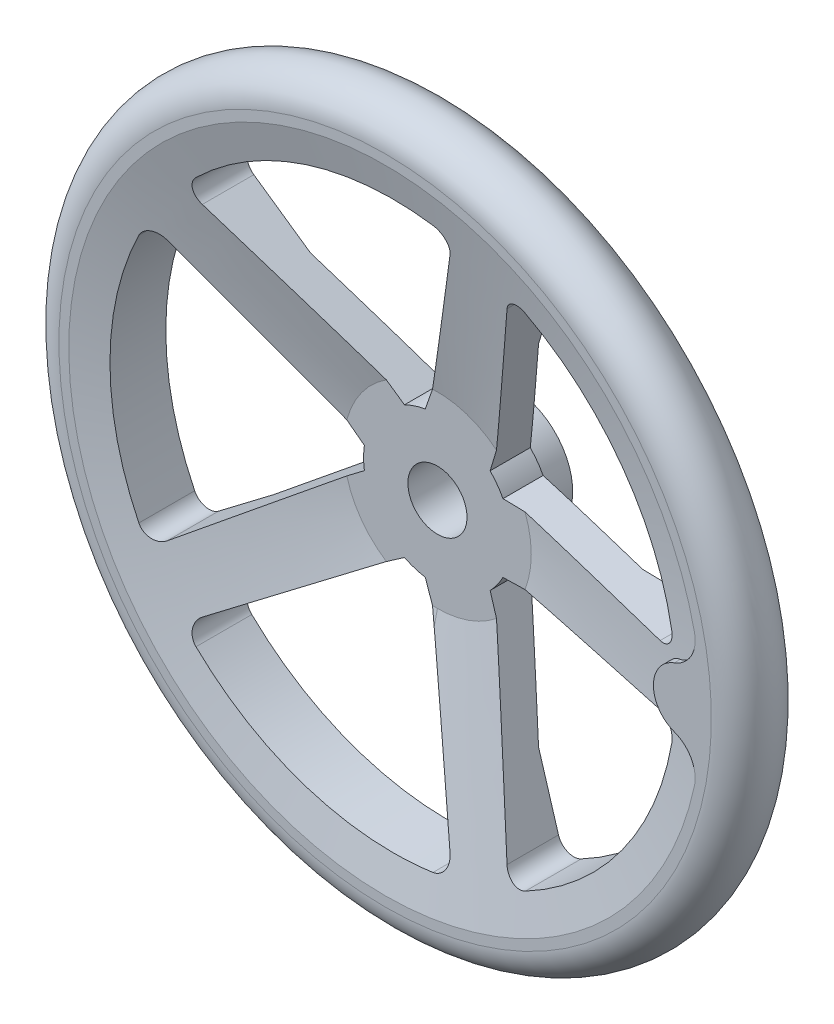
ISO-10303-21;
HEADER;
FILE_DESCRIPTION(('STEP AP214'),'2;1');
FILE_NAME('part.step','',(''),(''),'','','');
FILE_SCHEMA(('AUTOMOTIVE_DESIGN { 1 0 10303 214 1 1 1 1 }'));
ENDSEC;
DATA;
#1=APPLICATION_CONTEXT('core data for automotive mechanical design processes');
#2=APPLICATION_PROTOCOL_DEFINITION('international standard','automotive_design',2000,#1);
#3=PRODUCT_CONTEXT('',#1,'mechanical');
#4=PRODUCT('Part','Part','',(#3));
#5=PRODUCT_RELATED_PRODUCT_CATEGORY('part','',(#4));
#6=PRODUCT_DEFINITION_FORMATION('','',#4);
#7=PRODUCT_DEFINITION_CONTEXT('part definition',#1,'design');
#8=PRODUCT_DEFINITION('design','',#6,#7);
#9=PRODUCT_DEFINITION_SHAPE('','',#8);
#10=(LENGTH_UNIT() NAMED_UNIT(*) SI_UNIT(.MILLI.,.METRE.));
#11=(NAMED_UNIT(*) PLANE_ANGLE_UNIT() SI_UNIT($,.RADIAN.));
#12=(NAMED_UNIT(*) SI_UNIT($,.STERADIAN.) SOLID_ANGLE_UNIT());
#13=UNCERTAINTY_MEASURE_WITH_UNIT(LENGTH_MEASURE(1.E-05),#10,'distance_accuracy_value','');
#14=(GEOMETRIC_REPRESENTATION_CONTEXT(3) GLOBAL_UNCERTAINTY_ASSIGNED_CONTEXT((#13)) GLOBAL_UNIT_ASSIGNED_CONTEXT((#10,
#11,#12)) REPRESENTATION_CONTEXT('',''));
#15=CARTESIAN_POINT('',(0.,0.,0.));
#16=DIRECTION('',(0.,0.,1.));
#17=DIRECTION('',(1.,0.,0.));
#18=AXIS2_PLACEMENT_3D('',#15,#16,#17);
#19=CARTESIAN_POINT('',(-26.910279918,26.818,0.));
#20=DIRECTION('',(0.,0.,1.));
#21=DIRECTION('',(0.,-1.,0.));
#22=AXIS2_PLACEMENT_3D('',#19,#20,#21);
#23=PLANE('',#22);
#24=CARTESIAN_POINT('',(0.,0.,0.));
#25=DIRECTION('',(0.,0.,1.));
#26=DIRECTION('',(0.,-1.,0.));
#27=AXIS2_PLACEMENT_3D('',#24,#25,#26);
#28=CIRCLE('',#27,13.);
#29=CARTESIAN_POINT('',(0.,-13.,0.));
#30=VERTEX_POINT('',#29);
#31=EDGE_CURVE('E555',#30,#30,#28,.T.);
#32=ORIENTED_EDGE('',*,*,#31,.T.);
#33=EDGE_LOOP('',(#32));
#34=FACE_BOUND('',#33,.T.);
#35=CARTESIAN_POINT('',(0.,0.,0.));
#36=DIRECTION('',(0.,0.,-1.));
#37=DIRECTION('',(0.,1.,0.));
#38=AXIS2_PLACEMENT_3D('',#35,#36,#37);
#39=CIRCLE('',#38,26.5);
#40=CARTESIAN_POINT('',(0.,26.5,0.));
#41=VERTEX_POINT('',#40);
#42=EDGE_CURVE('E19',#41,#41,#39,.F.);
#43=ORIENTED_EDGE('',*,*,#42,.F.);
#44=EDGE_LOOP('',(#43));
#45=FACE_BOUND('',#44,.T.);
#46=ADVANCED_FACE('F15',(#34,#45),#23,.F.);
#47=CARTESIAN_POINT('',(0.,0.,12.359263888));
#48=DIRECTION('',(0.,0.,-1.));
#49=DIRECTION('',(0.,1.,0.));
#50=AXIS2_PLACEMENT_3D('',#47,#48,#49);
#51=CYLINDRICAL_SURFACE('',#50,26.5);
#52=ORIENTED_EDGE('',*,*,#42,.T.);
#53=EDGE_LOOP('',(#52));
#54=FACE_BOUND('',#53,.T.);
#55=CARTESIAN_POINT('',(0.,0.,12.359263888));
#56=DIRECTION('',(0.,0.,-1.));
#57=DIRECTION('',(0.,1.,0.));
#58=AXIS2_PLACEMENT_3D('',#55,#56,#57);
#59=CIRCLE('',#58,26.5);
#60=CARTESIAN_POINT('',(0.,26.5,12.359263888));
#61=VERTEX_POINT('',#60);
#62=CARTESIAN_POINT('',(-2.71762042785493E-09,-26.5,12.359263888));
#63=VERTEX_POINT('',#62);
#64=EDGE_CURVE('E528',#61,#63,#59,.T.);
#65=ORIENTED_EDGE('',*,*,#64,.T.);
#66=CARTESIAN_POINT('',(0.,0.,12.359263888));
#67=DIRECTION('',(0.,0.,-1.));
#68=DIRECTION('',(0.,1.,0.));
#69=AXIS2_PLACEMENT_3D('',#66,#67,#68);
#70=CIRCLE('',#69,26.5);
#71=EDGE_CURVE('E529',#63,#61,#70,.T.);
#72=ORIENTED_EDGE('',*,*,#71,.T.);
#73=EDGE_LOOP('',(#65,#72));
#74=FACE_BOUND('',#73,.T.);
#75=ADVANCED_FACE('F578',(#54,#74),#51,.T.);
#76=CARTESIAN_POINT('',(0.,0.,0.));
#77=DIRECTION('',(0.,0.,1.));
#78=DIRECTION('',(0.,-1.,0.));
#79=AXIS2_PLACEMENT_3D('',#76,#77,#78);
#80=CYLINDRICAL_SURFACE('',#79,13.);
#81=CARTESIAN_POINT('',(0.,0.,33.));
#82=DIRECTION('',(0.,0.,1.));
#83=DIRECTION('',(0.,-1.,0.));
#84=AXIS2_PLACEMENT_3D('',#81,#82,#83);
#85=CIRCLE('',#84,13.);
#86=CARTESIAN_POINT('',(0.,-13.,33.));
#87=VERTEX_POINT('',#86);
#88=EDGE_CURVE('E1507',#87,#87,#85,.T.);
#89=ORIENTED_EDGE('',*,*,#88,.T.);
#90=EDGE_LOOP('',(#89));
#91=FACE_BOUND('',#90,.T.);
#92=ORIENTED_EDGE('',*,*,#31,.F.);
#93=EDGE_LOOP('',(#92));
#94=FACE_BOUND('',#93,.T.);
#95=ADVANCED_FACE('F1413',(#91,#94),#80,.F.);
#96=CARTESIAN_POINT('',(0.,-28.042573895,14.306251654));
#97=CARTESIAN_POINT('',(-56.08514779,-28.042573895,14.306251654));
#98=CARTESIAN_POINT('',(-56.08514779,28.042573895,14.306251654));
#99=CARTESIAN_POINT('',(0.,28.042573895,14.306251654));
#100=CARTESIAN_POINT('',(0.,-27.100780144,14.084986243));
#101=CARTESIAN_POINT('',(-54.2015602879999,-27.100780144,14.084986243));
#102=CARTESIAN_POINT('',(-54.2015602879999,27.100780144,14.084986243));
#103=CARTESIAN_POINT('',(0.,27.100780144,14.084986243));
#104=CARTESIAN_POINT('',(0.,-26.5,13.326700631));
#105=CARTESIAN_POINT('',(-53.0000000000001,-26.5,13.326700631));
#106=CARTESIAN_POINT('',(-53.0000000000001,26.5,13.326700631));
#107=CARTESIAN_POINT('',(0.,26.5,13.326700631));
#108=CARTESIAN_POINT('',(0.,-26.5,12.359263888));
#109=CARTESIAN_POINT('',(-53.,-26.5,12.359263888));
#110=CARTESIAN_POINT('',(-53.,26.5,12.359263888));
#111=CARTESIAN_POINT('',(0.,26.5,12.359263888));
#112=(BOUNDED_SURFACE() B_SPLINE_SURFACE(3,3,((#96,#97,#98,#99),(#100,#101,#102,#103),(#104,
#105,#106,#107),(#108,#109,#110,#111)),.UNSPECIFIED.,.F.,.F.,
.F.) B_SPLINE_SURFACE_WITH_KNOTS((4,4),(4,4),(0.,1.),(0.,1.),
.UNSPECIFIED.) GEOMETRIC_REPRESENTATION_ITEM() RATIONAL_B_SPLINE_SURFACE(((1.,0.333333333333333,
0.333333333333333,1.),(0.855872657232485,0.285290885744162,0.285290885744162,0.855872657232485),
(0.855872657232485,0.285290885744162,0.285290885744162,0.855872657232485),(1.,0.333333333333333,
0.333333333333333,1.))) REPRESENTATION_ITEM('') SURFACE());
#113=CARTESIAN_POINT('',(0.,-28.042573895,14.306251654));
#114=CARTESIAN_POINT('',(0.,-27.100780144,14.084986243));
#115=CARTESIAN_POINT('',(0.,-26.5,13.326700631));
#116=CARTESIAN_POINT('',(0.,-26.5,12.359263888));
#117=(BOUNDED_CURVE() B_SPLINE_CURVE(3,(#113,#114,#115,#116),.UNSPECIFIED.,.F.,
.F.) B_SPLINE_CURVE_WITH_KNOTS((4,4),(0.,1.),
.UNSPECIFIED.) CURVE() GEOMETRIC_REPRESENTATION_ITEM() RATIONAL_B_SPLINE_CURVE((1.,
0.855872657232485,0.855872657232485,1.)) REPRESENTATION_ITEM(''));
#118=CARTESIAN_POINT('',(-1.25902223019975E-09,-28.042573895,14.306251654));
#119=VERTEX_POINT('',#118);
#120=EDGE_CURVE('E504',#63,#119,#117,.F.);
#121=CARTESIAN_POINT('',(0.,0.,14.306251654));
#122=DIRECTION('',(0.,0.,1.));
#123=DIRECTION('',(0.,-1.,0.));
#124=AXIS2_PLACEMENT_3D('',#121,#122,#123);
#125=CIRCLE('',#124,28.042573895);
#126=CARTESIAN_POINT('',(-8.62744207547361E-09,28.042573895,14.306251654));
#127=VERTEX_POINT('',#126);
#128=EDGE_CURVE('E372',#127,#119,#125,.T.);
#129=CARTESIAN_POINT('',(0.,28.042573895,14.306251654));
#130=CARTESIAN_POINT('',(0.,27.100780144,14.084986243));
#131=CARTESIAN_POINT('',(0.,26.5,13.326700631));
#132=CARTESIAN_POINT('',(0.,26.5,12.359263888));
#133=(BOUNDED_CURVE() B_SPLINE_CURVE(3,(#129,#130,#131,#132),.UNSPECIFIED.,.F.,
.F.) B_SPLINE_CURVE_WITH_KNOTS((4,4),(0.,1.),
.UNSPECIFIED.) CURVE() GEOMETRIC_REPRESENTATION_ITEM() RATIONAL_B_SPLINE_CURVE((1.,
0.855872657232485,0.855872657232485,1.)) REPRESENTATION_ITEM(''));
#134=EDGE_CURVE('E522',#127,#61,#133,.T.);
#135=ORIENTED_EDGE('',*,*,#120,.T.);
#136=ORIENTED_EDGE('',*,*,#128,.F.);
#137=ORIENTED_EDGE('',*,*,#134,.T.);
#138=ORIENTED_EDGE('',*,*,#71,.F.);
#139=EDGE_LOOP('',(#135,#136,#137,#138));
#140=FACE_BOUND('',#139,.T.);
#141=ADVANCED_FACE('F1404',(#140),#112,.F.);
#142=CARTESIAN_POINT('',(0.,0.,15.353481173));
#143=DIRECTION('',(0.,0.,1.));
#144=DIRECTION('',(1.,0.,0.));
#145=AXIS2_PLACEMENT_3D('',#142,#143,#144);
#146=CYLINDRICAL_SURFACE('',#145,32.5);
#147=DIRECTION('',(0.,0.,1.));
#148=VECTOR('',#147,1.);
#149=CARTESIAN_POINT('',(-5.356453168,-32.055551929,32.996831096));
#150=LINE('',#149,#148);
#151=CARTESIAN_POINT('',(-5.35645316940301,-32.0555519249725,15.3534811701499));
#152=VERTEX_POINT('',#151);
#153=CARTESIAN_POINT('',(-5.35645316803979,-32.0555519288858,33.0000000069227));
#154=VERTEX_POINT('',#153);
#155=EDGE_CURVE('E339',#152,#154,#150,.T.);
#156=ORIENTED_EDGE('',*,*,#155,.T.);
#157=CARTESIAN_POINT('',(0.,0.,33.));
#158=DIRECTION('',(0.,0.,1.));
#159=DIRECTION('',(1.,0.,0.));
#160=AXIS2_PLACEMENT_3D('',#157,#158,#159);
#161=CIRCLE('',#160,32.5);
#162=CARTESIAN_POINT('',(-14.5083190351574,-29.0819304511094,33.0000000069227));
#163=VERTEX_POINT('',#162);
#164=EDGE_CURVE('E1496',#154,#163,#161,.F.);
#165=ORIENTED_EDGE('',*,*,#164,.T.);
#166=DIRECTION('',(0.,0.,-1.));
#167=VECTOR('',#166,1.);
#168=CARTESIAN_POINT('',(-14.508319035,-29.081930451,32.996831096));
#169=LINE('',#168,#167);
#170=CARTESIAN_POINT('',(-14.5083190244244,-29.0819304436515,15.3534811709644));
#171=VERTEX_POINT('',#170);
#172=EDGE_CURVE('E353',#163,#171,#169,.T.);
#173=ORIENTED_EDGE('',*,*,#172,.T.);
#174=CARTESIAN_POINT('',(0.,0.,15.3534811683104));
#175=DIRECTION('',(0.,0.,1.));
#176=DIRECTION('',(0.,-1.,0.));
#177=AXIS2_PLACEMENT_3D('',#174,#175,#176);
#178=CIRCLE('',#177,32.4999999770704);
#179=EDGE_CURVE('E517',#152,#171,#178,.F.);
#180=ORIENTED_EDGE('',*,*,#179,.F.);
#181=EDGE_LOOP('',(#156,#165,#173,#180));
#182=FACE_BOUND('',#181,.T.);
#183=ADVANCED_FACE('F1395',(#182),#146,.T.);
#184=CARTESIAN_POINT('',(0.,0.,15.353481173));
#185=DIRECTION('',(0.,0.,1.));
#186=DIRECTION('',(1.,0.,0.));
#187=AXIS2_PLACEMENT_3D('',#184,#185,#186);
#188=CYLINDRICAL_SURFACE('',#187,32.5);
#189=DIRECTION('',(0.,0.,1.));
#190=VECTOR('',#189,1.);
#191=CARTESIAN_POINT('',(-32.141876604,-4.81142062,32.996831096));
#192=LINE('',#191,#190);
#193=CARTESIAN_POINT('',(-32.1418765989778,-4.81142061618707,15.3534811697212));
#194=VERTEX_POINT('',#193);
#195=CARTESIAN_POINT('',(-32.1418766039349,-4.81142061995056,33.0000000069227));
#196=VERTEX_POINT('',#195);
#197=EDGE_CURVE('E362',#194,#196,#192,.T.);
#198=ORIENTED_EDGE('',*,*,#197,.T.);
#199=CARTESIAN_POINT('',(0.,0.,33.));
#200=DIRECTION('',(0.,0.,1.));
#201=DIRECTION('',(1.,0.,0.));
#202=AXIS2_PLACEMENT_3D('',#199,#200,#201);
#203=CIRCLE('',#202,32.5);
#204=CARTESIAN_POINT('',(-32.1418766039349,4.81142061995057,33.0000000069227));
#205=VERTEX_POINT('',#204);
#206=EDGE_CURVE('E1499',#196,#205,#203,.F.);
#207=ORIENTED_EDGE('',*,*,#206,.T.);
#208=DIRECTION('',(0.,0.,-1.));
#209=VECTOR('',#208,1.);
#210=CARTESIAN_POINT('',(-32.141876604,4.81142062,32.996831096));
#211=LINE('',#210,#209);
#212=CARTESIAN_POINT('',(-32.1418765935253,4.81142061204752,15.3534811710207));
#213=VERTEX_POINT('',#212);
#214=EDGE_CURVE('E373',#205,#213,#211,.T.);
#215=ORIENTED_EDGE('',*,*,#214,.T.);
#216=CARTESIAN_POINT('',(0.,0.,15.3534811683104));
#217=DIRECTION('',(0.,0.,1.));
#218=DIRECTION('',(0.,-1.,0.));
#219=AXIS2_PLACEMENT_3D('',#216,#217,#218);
#220=CIRCLE('',#219,32.4999999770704);
#221=EDGE_CURVE('E545',#194,#213,#220,.F.);
#222=ORIENTED_EDGE('',*,*,#221,.F.);
#223=EDGE_LOOP('',(#198,#207,#215,#222));
#224=FACE_BOUND('',#223,.T.);
#225=ADVANCED_FACE('F1386',(#224),#188,.T.);
#226=CARTESIAN_POINT('',(0.,0.,15.353481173));
#227=DIRECTION('',(0.,0.,1.));
#228=DIRECTION('',(1.,0.,0.));
#229=AXIS2_PLACEMENT_3D('',#226,#227,#228);
#230=CYLINDRICAL_SURFACE('',#229,32.5);
#231=DIRECTION('',(0.,0.,1.));
#232=VECTOR('',#231,1.);
#233=CARTESIAN_POINT('',(-14.508319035,29.081930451,32.996831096));
#234=LINE('',#233,#232);
#235=CARTESIAN_POINT('',(-14.5083190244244,29.0819304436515,15.3534811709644));
#236=VERTEX_POINT('',#235);
#237=CARTESIAN_POINT('',(-14.5083190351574,29.0819304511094,33.0000000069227));
#238=VERTEX_POINT('',#237);
#239=EDGE_CURVE('E382',#236,#238,#234,.T.);
#240=ORIENTED_EDGE('',*,*,#239,.T.);
#241=CARTESIAN_POINT('',(0.,0.,33.));
#242=DIRECTION('',(0.,0.,1.));
#243=DIRECTION('',(1.,0.,0.));
#244=AXIS2_PLACEMENT_3D('',#241,#242,#243);
#245=CIRCLE('',#244,32.5);
#246=CARTESIAN_POINT('',(-5.35645316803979,32.0555519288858,33.0000000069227));
#247=VERTEX_POINT('',#246);
#248=EDGE_CURVE('E1502',#238,#247,#245,.F.);
#249=ORIENTED_EDGE('',*,*,#248,.T.);
#250=DIRECTION('',(0.,0.,-1.));
#251=VECTOR('',#250,1.);
#252=CARTESIAN_POINT('',(-5.356453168,32.055551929,32.996831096));
#253=LINE('',#252,#251);
#254=CARTESIAN_POINT('',(-5.35645317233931,32.0555519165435,15.3534811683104));
#255=VERTEX_POINT('',#254);
#256=EDGE_CURVE('E396',#247,#255,#253,.T.);
#257=ORIENTED_EDGE('',*,*,#256,.T.);
#258=CARTESIAN_POINT('',(0.,0.,15.3534811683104));
#259=DIRECTION('',(0.,0.,1.));
#260=DIRECTION('',(0.,-1.,0.));
#261=AXIS2_PLACEMENT_3D('',#258,#259,#260);
#262=CIRCLE('',#261,32.4999999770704);
#263=EDGE_CURVE('E391',#236,#255,#262,.F.);
#264=ORIENTED_EDGE('',*,*,#263,.F.);
#265=EDGE_LOOP('',(#240,#249,#257,#264));
#266=FACE_BOUND('',#265,.T.);
#267=ADVANCED_FACE('F1377',(#266),#230,.T.);
#268=CARTESIAN_POINT('',(0.,28.042573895,14.306251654));
#269=CARTESIAN_POINT('',(56.08514779,28.042573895,14.306251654));
#270=CARTESIAN_POINT('',(56.08514779,-28.042573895,14.306251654));
#271=CARTESIAN_POINT('',(0.,-28.042573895,14.306251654));
#272=CARTESIAN_POINT('',(0.,27.100780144,14.084986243));
#273=CARTESIAN_POINT('',(54.2015602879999,27.100780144,14.084986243));
#274=CARTESIAN_POINT('',(54.2015602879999,-27.100780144,14.084986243));
#275=CARTESIAN_POINT('',(0.,-27.100780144,14.084986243));
#276=CARTESIAN_POINT('',(0.,26.5,13.326700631));
#277=CARTESIAN_POINT('',(53.0000000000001,26.5,13.326700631));
#278=CARTESIAN_POINT('',(53.0000000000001,-26.5,13.326700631));
#279=CARTESIAN_POINT('',(0.,-26.5,13.326700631));
#280=CARTESIAN_POINT('',(0.,26.5,12.359263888));
#281=CARTESIAN_POINT('',(53.,26.5,12.359263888));
#282=CARTESIAN_POINT('',(53.,-26.5,12.359263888));
#283=CARTESIAN_POINT('',(0.,-26.5,12.359263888));
#284=(BOUNDED_SURFACE() B_SPLINE_SURFACE(3,3,((#268,#269,#270,#271),(#272,#273,#274,#275),(#276,
#277,#278,#279),(#280,#281,#282,#283)),.UNSPECIFIED.,.F.,.F.,
.F.) B_SPLINE_SURFACE_WITH_KNOTS((4,4),(4,4),(0.,1.),(0.,1.),
.UNSPECIFIED.) GEOMETRIC_REPRESENTATION_ITEM() RATIONAL_B_SPLINE_SURFACE(((1.,0.333333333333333,
0.333333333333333,1.),(0.855872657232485,0.285290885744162,0.285290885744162,0.855872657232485),
(0.855872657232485,0.285290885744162,0.285290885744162,0.855872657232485),(1.,0.333333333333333,
0.333333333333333,1.))) REPRESENTATION_ITEM('') SURFACE());
#285=CARTESIAN_POINT('',(0.,0.,14.306251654));
#286=DIRECTION('',(0.,0.,1.));
#287=DIRECTION('',(0.,-1.,0.));
#288=AXIS2_PLACEMENT_3D('',#285,#286,#287);
#289=CIRCLE('',#288,28.042573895);
#290=EDGE_CURVE('E416',#119,#127,#289,.T.);
#291=ORIENTED_EDGE('',*,*,#64,.F.);
#292=ORIENTED_EDGE('',*,*,#134,.F.);
#293=ORIENTED_EDGE('',*,*,#290,.F.);
#294=ORIENTED_EDGE('',*,*,#120,.F.);
#295=EDGE_LOOP('',(#291,#292,#293,#294));
#296=FACE_BOUND('',#295,.T.);
#297=ADVANCED_FACE('F1369',(#296),#284,.F.);
#298=CARTESIAN_POINT('',(0.,0.,15.353481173));
#299=DIRECTION('',(0.,0.,1.));
#300=DIRECTION('',(1.,0.,0.));
#301=AXIS2_PLACEMENT_3D('',#298,#299,#300);
#302=CYLINDRICAL_SURFACE('',#301,32.5);
#303=DIRECTION('',(0.,0.,1.));
#304=VECTOR('',#303,1.);
#305=CARTESIAN_POINT('',(23.175242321,22.785042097,32.996831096));
#306=LINE('',#305,#304);
#307=CARTESIAN_POINT('',(23.1752423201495,22.7850420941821,15.3534811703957));
#308=VERTEX_POINT('',#307);
#309=CARTESIAN_POINT('',(23.1752423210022,22.7850420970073,33.0000000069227));
#310=VERTEX_POINT('',#309);
#311=EDGE_CURVE('E405',#308,#310,#306,.T.);
#312=ORIENTED_EDGE('',*,*,#311,.T.);
#313=CARTESIAN_POINT('',(0.,0.,33.));
#314=DIRECTION('',(0.,0.,1.));
#315=DIRECTION('',(1.,0.,0.));
#316=AXIS2_PLACEMENT_3D('',#313,#314,#315);
#317=CIRCLE('',#316,32.5);
#318=CARTESIAN_POINT('',(28.8314064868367,15.0000000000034,33.0000000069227));
#319=VERTEX_POINT('',#318);
#320=EDGE_CURVE('E1076',#310,#319,#317,.F.);
#321=ORIENTED_EDGE('',*,*,#320,.T.);
#322=DIRECTION('',(0.,0.,-1.));
#323=VECTOR('',#322,1.);
#324=CARTESIAN_POINT('',(28.831406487,15.,32.996831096));
#325=LINE('',#324,#323);
#326=CARTESIAN_POINT('',(28.8314064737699,15.0000000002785,15.3534811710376));
#327=VERTEX_POINT('',#326);
#328=EDGE_CURVE('E412',#319,#327,#325,.T.);
#329=ORIENTED_EDGE('',*,*,#328,.T.);
#330=CARTESIAN_POINT('',(0.,0.,15.3534811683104));
#331=DIRECTION('',(0.,0.,1.));
#332=DIRECTION('',(0.,-1.,0.));
#333=AXIS2_PLACEMENT_3D('',#330,#331,#332);
#334=CIRCLE('',#333,32.4999999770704);
#335=EDGE_CURVE('E509',#308,#327,#334,.F.);
#336=ORIENTED_EDGE('',*,*,#335,.F.);
#337=EDGE_LOOP('',(#312,#321,#329,#336));
#338=FACE_BOUND('',#337,.T.);
#339=ADVANCED_FACE('F1078',(#338),#302,.T.);
#340=CARTESIAN_POINT('',(0.,0.,15.353481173));
#341=DIRECTION('',(0.,0.,1.));
#342=DIRECTION('',(1.,0.,0.));
#343=AXIS2_PLACEMENT_3D('',#340,#341,#342);
#344=CYLINDRICAL_SURFACE('',#343,32.5);
#345=DIRECTION('',(0.,0.,1.));
#346=VECTOR('',#345,1.);
#347=CARTESIAN_POINT('',(28.831406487,-15.,32.996831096));
#348=LINE('',#347,#346);
#349=CARTESIAN_POINT('',(28.8314064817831,-15.0000000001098,15.3534811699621));
#350=VERTEX_POINT('',#349);
#351=CARTESIAN_POINT('',(28.8314064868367,-15.0000000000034,33.0000000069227));
#352=VERTEX_POINT('',#351);
#353=EDGE_CURVE('E310',#350,#352,#348,.T.);
#354=ORIENTED_EDGE('',*,*,#353,.T.);
#355=CARTESIAN_POINT('',(0.,0.,33.));
#356=DIRECTION('',(0.,0.,1.));
#357=DIRECTION('',(1.,0.,0.));
#358=AXIS2_PLACEMENT_3D('',#355,#356,#357);
#359=CIRCLE('',#358,32.5);
#360=CARTESIAN_POINT('',(23.1752423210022,-22.7850420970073,33.0000000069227));
#361=VERTEX_POINT('',#360);
#362=EDGE_CURVE('E300',#352,#361,#359,.F.);
#363=ORIENTED_EDGE('',*,*,#362,.T.);
#364=DIRECTION('',(0.,0.,-1.));
#365=VECTOR('',#364,1.);
#366=CARTESIAN_POINT('',(23.175242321,-22.785042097,32.996831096));
#367=LINE('',#366,#365);
#368=CARTESIAN_POINT('',(23.175242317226,-22.785042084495,15.3534811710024));
#369=VERTEX_POINT('',#368);
#370=EDGE_CURVE('E308',#361,#369,#367,.T.);
#371=ORIENTED_EDGE('',*,*,#370,.T.);
#372=CARTESIAN_POINT('',(0.,0.,15.3534811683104));
#373=DIRECTION('',(0.,0.,1.));
#374=DIRECTION('',(0.,-1.,0.));
#375=AXIS2_PLACEMENT_3D('',#372,#373,#374);
#376=CIRCLE('',#375,32.4999999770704);
#377=EDGE_CURVE('E505',#350,#369,#376,.F.);
#378=ORIENTED_EDGE('',*,*,#377,.F.);
#379=EDGE_LOOP('',(#354,#363,#371,#378));
#380=FACE_BOUND('',#379,.T.);
#381=ADVANCED_FACE('F306',(#380),#344,.T.);
#382=CARTESIAN_POINT('',(122.376882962,26.294402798,53.328360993));
#383=DIRECTION('',(0.,0.,1.));
#384=DIRECTION('',(0.,-1.,0.));
#385=AXIS2_PLACEMENT_3D('',#382,#383,#384);
#386=CYLINDRICAL_SURFACE('',#385,14.);
#387=CARTESIAN_POINT('',(136.064492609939,29.2353791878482,55.9999999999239));
#388=CARTESIAN_POINT('',(136.105187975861,29.0459790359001,55.9999999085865));
#389=CARTESIAN_POINT('',(136.141946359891,28.8557573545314,55.9991502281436));
#390=CARTESIAN_POINT('',(136.207537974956,28.4739685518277,55.9957534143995));
#391=CARTESIAN_POINT('',(136.236371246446,28.2824014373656,55.9932062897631));
#392=CARTESIAN_POINT('',(136.310891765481,27.7062445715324,55.9830234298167));
#393=CARTESIAN_POINT('',(136.344625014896,27.320081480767,55.9728462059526));
#394=CARTESIAN_POINT('',(136.379944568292,26.5470600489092,55.94579553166));
#395=CARTESIAN_POINT('',(136.381571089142,26.1602031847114,55.9289304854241));
#396=CARTESIAN_POINT('',(136.352851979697,25.3880132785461,55.8886080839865));
#397=CARTESIAN_POINT('',(136.322506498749,25.002680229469,55.8651507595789));
#398=CARTESIAN_POINT('',(136.23014146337,24.2361764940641,55.8117809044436));
#399=CARTESIAN_POINT('',(136.168112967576,23.8550070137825,55.781866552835));
#400=CARTESIAN_POINT('',(136.012936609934,23.0996073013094,55.7157692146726));
#401=CARTESIAN_POINT('',(135.919788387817,22.7253771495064,55.6795861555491));
#402=CARTESIAN_POINT('',(135.703179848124,21.9865021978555,55.6011763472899));
#403=CARTESIAN_POINT('',(135.579723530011,21.6218561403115,55.5589503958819));
#404=CARTESIAN_POINT('',(135.303504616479,20.9045837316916,55.4687050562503));
#405=CARTESIAN_POINT('',(135.15074198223,20.5519573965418,55.4206856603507));
#406=CARTESIAN_POINT('',(134.815667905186,19.8580717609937,55.3186959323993));
#407=CARTESIAN_POINT('',(134.633110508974,19.5169383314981,55.2646773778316));
#408=CARTESIAN_POINT('',(134.240842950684,18.8515805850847,55.1513589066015));
#409=CARTESIAN_POINT('',(134.031132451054,18.5273564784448,55.092058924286));
#410=CARTESIAN_POINT('',(133.586050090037,17.8977805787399,54.968497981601));
#411=CARTESIAN_POINT('',(133.350665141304,17.5924385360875,54.9042344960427));
#412=CARTESIAN_POINT('',(132.856084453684,17.0027712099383,54.7711528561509));
#413=CARTESIAN_POINT('',(132.596889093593,16.7184455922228,54.7023347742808));
#414=CARTESIAN_POINT('',(132.050850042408,16.1668096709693,54.5590436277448));
#415=CARTESIAN_POINT('',(131.763537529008,15.8999864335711,54.484481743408));
#416=CARTESIAN_POINT('',(131.168166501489,15.3918107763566,54.3314758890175));
#417=CARTESIAN_POINT('',(130.860107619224,15.1504588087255,54.2530318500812));
#418=CARTESIAN_POINT('',(130.225861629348,14.6950151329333,54.092833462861));
#419=CARTESIAN_POINT('',(129.899696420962,14.48089148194,54.0110831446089));
#420=CARTESIAN_POINT('',(129.231321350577,14.0809578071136,53.8447059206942));
#421=CARTESIAN_POINT('',(128.889118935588,13.8951348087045,53.7600803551));
#422=CARTESIAN_POINT('',(128.319690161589,13.6159437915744,53.6200909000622));
#423=CARTESIAN_POINT('',(128.096573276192,13.513742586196,53.5654379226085));
#424=CARTESIAN_POINT('',(127.645831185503,13.3214259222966,53.4554035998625));
#425=CARTESIAN_POINT('',(127.418214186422,13.2312904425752,53.4000236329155));
#426=CARTESIAN_POINT('',(127.188441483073,13.1472014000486,53.3442952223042));
#427=B_SPLINE_CURVE_WITH_KNOTS('',3,(#387,#388,#389,#390,#391,#392,#393,#394,#395,#396,#397,
#398,#399,#400,#401,#402,#403,#404,#405,#406,#407,#408,#409,#410,#411,#412,#413,#414,#415,#416,
#417,#418,#419,#420,#421,#422,#423,#424,#425,#426),.UNSPECIFIED.,.F.,.F.,(4,2,2,2,2,2,2,2,2,2,2,
2,2,2,2,2,2,2,2,4),(0.,0.581077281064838,1.16215159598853,2.32393989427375,3.48427284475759,
4.6446003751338,5.80525554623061,6.96592415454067,8.12643968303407,9.28695674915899,
10.4575893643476,11.62823653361,12.79948324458,13.9707113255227,15.1667111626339,
16.3627322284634,17.5573369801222,18.7513923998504,19.5053538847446,20.2580483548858),.UNSPECIFIED.);
#428=CARTESIAN_POINT('',(136.064492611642,29.2353791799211,55.9999999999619));
#429=VERTEX_POINT('',#428);
#430=CARTESIAN_POINT('',(127.18844148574,13.1472014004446,53.3442952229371));
#431=VERTEX_POINT('',#430);
#432=EDGE_CURVE('E438',#429,#431,#427,.T.);
#433=ORIENTED_EDGE('',*,*,#432,.T.);
#434=DIRECTION('',(0.,0.,-1.));
#435=VECTOR('',#434,1.);
#436=CARTESIAN_POINT('',(127.188441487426,13.1472014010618,53.4878261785));
#437=LINE('',#436,#435);
#438=CARTESIAN_POINT('',(127.188441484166,13.1472014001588,56.));
#439=VERTEX_POINT('',#438);
#440=EDGE_CURVE('E501',#439,#431,#437,.T.);
#441=ORIENTED_EDGE('',*,*,#440,.F.);
#442=CARTESIAN_POINT('',(122.376882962,26.294402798,56.));
#443=DIRECTION('',(0.,0.,1.));
#444=DIRECTION('',(0.,-1.,0.));
#445=AXIS2_PLACEMENT_3D('',#442,#443,#444);
#446=CIRCLE('',#445,14.);
#447=EDGE_CURVE('E1518',#439,#429,#446,.T.);
#448=ORIENTED_EDGE('',*,*,#447,.T.);
#449=EDGE_LOOP('',(#433,#441,#448));
#450=FACE_BOUND('',#449,.T.);
#451=ADVANCED_FACE('F1347',(#450),#386,.F.);
#452=CARTESIAN_POINT('',(132.,0.,50.9962250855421));
#453=DIRECTION('',(0.,0.,1.));
#454=DIRECTION('',(1.,0.,0.));
#455=AXIS2_PLACEMENT_3D('',#452,#453,#454);
#456=CYLINDRICAL_SURFACE('',#455,14.);
#457=DIRECTION('',(0.,0.,1.));
#458=VECTOR('',#457,1.);
#459=CARTESIAN_POINT('',(127.188441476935,-13.1472013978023,54.6641804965));
#460=LINE('',#459,#458);
#461=CARTESIAN_POINT('',(127.188441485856,-13.1472014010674,53.3442952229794));
#462=VERTEX_POINT('',#461);
#463=CARTESIAN_POINT('',(127.188441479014,-13.1472013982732,56.));
#464=VERTEX_POINT('',#463);
#465=EDGE_CURVE('E313',#462,#464,#460,.T.);
#466=ORIENTED_EDGE('',*,*,#465,.T.);
#467=CARTESIAN_POINT('',(132.,0.,56.));
#468=DIRECTION('',(0.,0.,1.));
#469=DIRECTION('',(1.,0.,0.));
#470=AXIS2_PLACEMENT_3D('',#467,#468,#469);
#471=CIRCLE('',#470,14.);
#472=EDGE_CURVE('E1515',#464,#439,#471,.F.);
#473=ORIENTED_EDGE('',*,*,#472,.T.);
#474=ORIENTED_EDGE('',*,*,#440,.T.);
#475=CARTESIAN_POINT('',(127.188441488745,13.147201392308,53.344295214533));
#476=CARTESIAN_POINT('',(126.816165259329,13.010995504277,53.254008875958));
#477=CARTESIAN_POINT('',(126.449490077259,12.8588355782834,53.164666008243));
#478=CARTESIAN_POINT('',(125.729842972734,12.5236747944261,52.9885543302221));
#479=CARTESIAN_POINT('',(125.376872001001,12.34067180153,52.9017856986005));
#480=CARTESIAN_POINT('',(124.687000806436,11.9448044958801,52.7314764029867));
#481=CARTESIAN_POINT('',(124.350109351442,11.7319241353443,52.647937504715));
#482=CARTESIAN_POINT('',(123.695070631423,11.2777198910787,52.4848436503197));
#483=CARTESIAN_POINT('',(123.376922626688,11.0363971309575,52.4052885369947));
#484=CARTESIAN_POINT('',(122.761404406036,10.5265488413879,52.2507765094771));
#485=CARTESIAN_POINT('',(122.464057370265,10.2579937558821,52.1758247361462));
#486=CARTESIAN_POINT('',(121.892833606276,9.69565924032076,52.031314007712));
#487=CARTESIAN_POINT('',(121.618956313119,9.4018804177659,51.9617549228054));
#488=CARTESIAN_POINT('',(121.096996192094,8.79123152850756,51.8287449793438));
#489=CARTESIAN_POINT('',(120.848899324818,8.47437419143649,51.765290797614));
#490=CARTESIAN_POINT('',(120.380380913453,7.81962229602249,51.6451004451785));
#491=CARTESIAN_POINT('',(120.159958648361,7.48172828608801,51.5883640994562));
#492=CARTESIAN_POINT('',(119.752931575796,6.79451815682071,51.4833199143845));
#493=CARTESIAN_POINT('',(119.565720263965,6.44558421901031,51.4348616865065));
#494=CARTESIAN_POINT('',(119.221212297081,5.73231503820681,51.3454928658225));
#495=CARTESIAN_POINT('',(119.063915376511,5.36797993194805,51.304582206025));
#496=CARTESIAN_POINT('',(118.780591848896,4.62652844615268,51.2307632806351));
#497=CARTESIAN_POINT('',(118.654567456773,4.24941116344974,51.1978555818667));
#498=CARTESIAN_POINT('',(118.434927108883,3.48523150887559,51.1404267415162));
#499=CARTESIAN_POINT('',(118.341310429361,3.09816935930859,51.115905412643));
#500=CARTESIAN_POINT('',(118.189616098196,2.32862907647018,51.0761374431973));
#501=CARTESIAN_POINT('',(118.130567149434,1.94635521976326,51.0606374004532));
#502=CARTESIAN_POINT('',(118.0442920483,1.17799100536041,51.0379818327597));
#503=CARTESIAN_POINT('',(118.017065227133,0.791900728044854,51.0308261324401));
#504=CARTESIAN_POINT('',(117.994673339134,0.0187915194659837,51.0249415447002));
#505=CARTESIAN_POINT('',(117.999503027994,-0.368227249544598,51.0262112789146));
#506=CARTESIAN_POINT('',(118.041169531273,-1.14041752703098,51.0371597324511));
#507=CARTESIAN_POINT('',(118.078006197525,-1.5255890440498,51.0468384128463));
#508=CARTESIAN_POINT('',(118.182590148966,-2.28564657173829,51.0742905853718));
#509=CARTESIAN_POINT('',(118.249875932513,-2.66060057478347,51.0919432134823));
#510=CARTESIAN_POINT('',(118.414642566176,-3.40334624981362,51.1351105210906));
#511=CARTESIAN_POINT('',(118.512123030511,-3.77113801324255,51.1606251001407));
#512=CARTESIAN_POINT('',(118.736471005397,-4.49701044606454,51.219241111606));
#513=CARTESIAN_POINT('',(118.863337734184,-4.8550913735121,51.2523423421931));
#514=CARTESIAN_POINT('',(119.145433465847,-5.55913089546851,51.3257852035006));
#515=CARTESIAN_POINT('',(119.300662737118,-5.90508937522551,51.3661269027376));
#516=CARTESIAN_POINT('',(119.639725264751,-6.58554140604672,51.4540214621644));
#517=CARTESIAN_POINT('',(119.82379530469,-6.91990924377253,51.5016339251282));
#518=CARTESIAN_POINT('',(120.218107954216,-7.57179874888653,51.6033348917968));
#519=CARTESIAN_POINT('',(120.428350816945,-7.88932025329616,51.6574234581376));
#520=CARTESIAN_POINT('',(120.873504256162,-8.50562460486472,51.7715825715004));
#521=CARTESIAN_POINT('',(121.108424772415,-8.80439982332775,51.831655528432));
#522=CARTESIAN_POINT('',(121.601129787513,-9.38122452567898,51.9572139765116));
#523=CARTESIAN_POINT('',(121.858914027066,-9.6592742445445,52.0226994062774));
#524=CARTESIAN_POINT('',(122.402792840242,-10.2002295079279,52.1603542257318));
#525=CARTESIAN_POINT('',(122.689465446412,-10.4625201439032,52.2326566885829));
#526=CARTESIAN_POINT('',(123.282913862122,-10.9618793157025,52.3817358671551));
#527=CARTESIAN_POINT('',(123.589690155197,-11.1989472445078,52.4585126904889));
#528=CARTESIAN_POINT('',(124.220801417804,-11.6461795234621,52.6158057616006));
#529=CARTESIAN_POINT('',(124.545116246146,-11.8563738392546,52.6963177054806));
#530=CARTESIAN_POINT('',(125.209274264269,-12.248866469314,52.8604923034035));
#531=CARTESIAN_POINT('',(125.549110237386,-12.4311775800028,52.9441534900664));
#532=CARTESIAN_POINT('',(126.106637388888,-12.7013117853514,53.080807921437));
#533=CARTESIAN_POINT('',(126.320170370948,-12.7982203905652,53.1330112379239));
#534=CARTESIAN_POINT('',(126.751299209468,-12.9809809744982,53.2381309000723));
#535=CARTESIAN_POINT('',(126.968887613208,-13.0668513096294,53.2910458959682));
#536=CARTESIAN_POINT('',(127.188441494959,-13.1472014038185,53.3442952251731));
#537=B_SPLINE_CURVE_WITH_KNOTS('',3,(#475,#476,#477,#478,#479,#480,#481,#482,#483,#484,#485,
#486,#487,#488,#489,#490,#491,#492,#493,#494,#495,#496,#497,#498,#499,#500,#501,#502,#503,#504,
#505,#506,#507,#508,#509,#510,#511,#512,#513,#514,#515,#516,#517,#518,#519,#520,#521,#522,#523,
#524,#525,#526,#527,#528,#529,#530,#531,#532,#533,#534,#535,#536),.UNSPECIFIED.,.F.,.F.,(4,2,2,
2,2,2,2,2,2,2,2,2,2,2,2,2,2,2,2,2,2,2,2,2,2,2,2,2,2,2,4),(0.,1.21934996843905,2.43878437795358,
3.65887629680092,4.87892003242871,6.10030238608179,7.32165533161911,8.54233963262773,
9.76299212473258,10.9583310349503,12.1536593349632,13.3490722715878,14.5444585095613,
15.7044069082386,16.8643309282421,18.024065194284,19.1837940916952,20.3265055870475,
21.4692024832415,22.6118689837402,23.7545462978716,24.90715071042,26.0597662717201,
27.2128478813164,28.3659164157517,29.5502445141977,30.7346011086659,31.9176253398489,
33.1001050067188,33.8205453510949,34.5397716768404),.UNSPECIFIED.);
#538=EDGE_CURVE('E1024',#431,#462,#537,.T.);
#539=ORIENTED_EDGE('',*,*,#538,.T.);
#540=EDGE_LOOP('',(#466,#473,#474,#539));
#541=FACE_BOUND('',#540,.T.);
#542=ADVANCED_FACE('F1339',(#541),#456,.T.);
#543=CARTESIAN_POINT('',(122.376882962,-26.294402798,53.328360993));
#544=DIRECTION('',(0.,0.,1.));
#545=DIRECTION('',(0.,-1.,0.));
#546=AXIS2_PLACEMENT_3D('',#543,#544,#545);
#547=CYLINDRICAL_SURFACE('',#546,14.);
#548=CARTESIAN_POINT('',(127.188441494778,-13.1472014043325,53.3442952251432));
#549=CARTESIAN_POINT('',(127.561963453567,-13.2838609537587,53.4348890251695));
#550=CARTESIAN_POINT('',(127.929835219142,-13.4365810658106,53.5245720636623));
#551=CARTESIAN_POINT('',(128.651726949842,-13.7730354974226,53.7015626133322));
#552=CARTESIAN_POINT('',(129.005746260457,-13.9567712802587,53.7888700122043));
#553=CARTESIAN_POINT('',(129.697433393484,-14.3541872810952,53.9605683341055));
#554=CARTESIAN_POINT('',(130.035097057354,-14.5678750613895,54.044958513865));
#555=CARTESIAN_POINT('',(130.691477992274,-15.0237705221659,54.2102640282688));
#556=CARTESIAN_POINT('',(131.010195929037,-15.2659771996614,54.2911794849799));
#557=CARTESIAN_POINT('',(131.626604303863,-15.7775949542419,54.4491068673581));
#558=CARTESIAN_POINT('',(131.924273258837,-16.0470331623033,54.5261147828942));
#559=CARTESIAN_POINT('',(132.495921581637,-16.6111032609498,54.6756495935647));
#560=CARTESIAN_POINT('',(132.769901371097,-16.9057347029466,54.7481765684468));
#561=CARTESIAN_POINT('',(133.29185712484,-17.5180095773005,54.8882490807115));
#562=CARTESIAN_POINT('',(133.539847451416,-17.835640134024,54.9557973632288));
#563=CARTESIAN_POINT('',(134.007975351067,-18.4918318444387,55.0855217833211));
#564=CARTESIAN_POINT('',(134.228113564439,-18.830392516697,55.1476980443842));
#565=CARTESIAN_POINT('',(134.635373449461,-19.5203868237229,55.2653152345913));
#566=CARTESIAN_POINT('',(134.822972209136,-19.8715230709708,55.32084895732));
#567=CARTESIAN_POINT('',(135.167877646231,-20.5892326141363,55.4259764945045));
#568=CARTESIAN_POINT('',(135.325184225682,-20.9558059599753,55.4755702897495));
#569=CARTESIAN_POINT('',(135.608236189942,-21.7019528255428,55.5685259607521));
#570=CARTESIAN_POINT('',(135.733963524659,-22.0815336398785,55.6118842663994));
#571=CARTESIAN_POINT('',(135.952620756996,-22.8506868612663,55.6920522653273));
#572=CARTESIAN_POINT('',(136.04555241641,-23.2402587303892,55.7288623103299));
#573=CARTESIAN_POINT('',(136.19612177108,-24.0179771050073,55.7949714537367));
#574=CARTESIAN_POINT('',(136.254479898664,-24.4059719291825,55.8244158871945));
#575=CARTESIAN_POINT('',(136.338441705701,-25.1859334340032,55.876622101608));
#576=CARTESIAN_POINT('',(136.364046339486,-25.5778999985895,55.8993840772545));
#577=CARTESIAN_POINT('',(136.382203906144,-26.3621977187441,55.9380455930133));
#578=CARTESIAN_POINT('',(136.374817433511,-26.7545268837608,55.9539576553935));
#579=CARTESIAN_POINT('',(136.327114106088,-27.5372287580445,55.9788715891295));
#580=CARTESIAN_POINT('',(136.286816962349,-27.9276024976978,55.9878775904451));
#581=CARTESIAN_POINT('',(136.207717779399,-28.4697987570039,55.9956054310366));
#582=CARTESIAN_POINT('',(136.182634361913,-28.6236830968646,55.9972543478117));
#583=CARTESIAN_POINT('',(136.127375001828,-28.9303463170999,55.9994508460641));
#584=CARTESIAN_POINT('',(136.09720538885,-29.0831263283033,55.9999997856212));
#585=CARTESIAN_POINT('',(136.064492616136,-29.2353791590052,55.9999999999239));
#586=B_SPLINE_CURVE_WITH_KNOTS('',3,(#548,#549,#550,#551,#552,#553,#554,#555,#556,#557,#558,
#559,#560,#561,#562,#563,#564,#565,#566,#567,#568,#569,#570,#571,#572,#573,#574,#575,#576,#577,
#578,#579,#580,#581,#582,#583,#584,#585),.UNSPECIFIED.,.F.,.F.,(4,2,2,2,2,2,2,2,2,2,2,2,2,2,2,2,
2,2,4),(0.,1.22342614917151,2.44691003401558,3.67070338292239,4.89445370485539,6.11943550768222,
7.34439550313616,8.56867495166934,9.79292624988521,10.9973450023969,12.2017676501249,
13.4068771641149,14.6119219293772,15.7908822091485,16.9698081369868,18.146569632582,
19.3226268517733,19.790326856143,20.2574490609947),.UNSPECIFIED.);
#587=CARTESIAN_POINT('',(136.064492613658,-29.2353791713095,56.));
#588=VERTEX_POINT('',#587);
#589=EDGE_CURVE('E719',#462,#588,#586,.T.);
#590=ORIENTED_EDGE('',*,*,#589,.T.);
#591=CARTESIAN_POINT('',(122.376882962,-26.294402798,56.));
#592=DIRECTION('',(0.,0.,1.));
#593=DIRECTION('',(0.,-1.,0.));
#594=AXIS2_PLACEMENT_3D('',#591,#592,#593);
#595=CIRCLE('',#594,14.);
#596=EDGE_CURVE('E1511',#588,#464,#595,.T.);
#597=ORIENTED_EDGE('',*,*,#596,.T.);
#598=ORIENTED_EDGE('',*,*,#465,.F.);
#599=EDGE_LOOP('',(#590,#597,#598));
#600=FACE_BOUND('',#599,.T.);
#601=ADVANCED_FACE('F1113',(#600),#547,.F.);
#602=CARTESIAN_POINT('',(0.,0.,33.));
#603=DIRECTION('',(0.,0.,1.));
#604=DIRECTION('',(0.,-1.,0.));
#605=AXIS2_PLACEMENT_3D('',#602,#603,#604);
#606=CONICAL_SURFACE('',#605,41.272708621,1.34004083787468);
#607=CARTESIAN_POINT('',(0.,0.,33.));
#608=DIRECTION('',(0.,0.,1.));
#609=DIRECTION('',(0.,-1.,0.));
#610=AXIS2_PLACEMENT_3D('',#607,#608,#609);
#611=CIRCLE('',#610,41.272708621);
#612=CARTESIAN_POINT('',(-3.70602626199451E-09,-41.272708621,33.));
#613=VERTEX_POINT('',#612);
#614=CARTESIAN_POINT('',(-2.16538272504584,-41.2158658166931,33.0000000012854));
#615=VERTEX_POINT('',#614);
#616=EDGE_CURVE('E312',#613,#615,#611,.F.);
#617=ORIENTED_EDGE('',*,*,#616,.T.);
#618=CARTESIAN_POINT('',(-2.16538272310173,-41.2158658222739,33.0000000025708));
#619=CARTESIAN_POINT('',(-1.98484619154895,-41.7341155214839,33.1193664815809));
#620=CARTESIAN_POINT('',(-1.80433456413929,-42.2522937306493,33.2390806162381));
#621=CARTESIAN_POINT('',(-1.44335680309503,-43.2885195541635,33.4791382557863));
#622=CARTESIAN_POINT('',(-1.26289066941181,-43.8065671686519,33.5994817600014));
#623=CARTESIAN_POINT('',(-0.901999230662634,-44.8425451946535,33.8407324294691));
#624=CARTESIAN_POINT('',(-0.721573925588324,-45.3604756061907,33.9616395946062));
#625=CARTESIAN_POINT('',(-0.360760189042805,-46.3962305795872,34.2039640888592));
#626=CARTESIAN_POINT('',(-0.180371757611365,-46.9140551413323,34.3253814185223));
#627=CARTESIAN_POINT('',(2.43363326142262E-09,-47.4318318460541,34.4470269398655));
#628=B_SPLINE_CURVE_WITH_KNOTS('',3,(#618,#619,#620,#621,#622,#623,#624,#625,#626,#627),
.UNSPECIFIED.,.F.,.F.,(4,2,2,2,4),(0.,1.68487985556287,3.36975790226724,5.05463560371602,
6.7395151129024),.UNSPECIFIED.);
#629=CARTESIAN_POINT('',(1.21681720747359E-09,-47.4318318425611,34.4470269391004));
#630=VERTEX_POINT('',#629);
#631=EDGE_CURVE('E344',#615,#630,#628,.T.);
#632=ORIENTED_EDGE('',*,*,#631,.T.);
#633=DIRECTION('',(0.,0.973493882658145,-0.228713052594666));
#634=VECTOR('',#633,1.);
#635=CARTESIAN_POINT('',(0.,-90.221290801,44.5));
#636=LINE('',#635,#634);
#637=EDGE_CURVE('E494',#630,#613,#636,.T.);
#638=ORIENTED_EDGE('',*,*,#637,.T.);
#639=EDGE_LOOP('',(#617,#632,#638));
#640=FACE_BOUND('',#639,.T.);
#641=ADVANCED_FACE('F583',(#640),#606,.F.);
#642=CARTESIAN_POINT('',(-40.355556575,-41.769360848,33.));
#643=DIRECTION('',(0.,0.,-1.));
#644=DIRECTION('',(0.,1.,0.));
#645=AXIS2_PLACEMENT_3D('',#642,#643,#644);
#646=PLANE('',#645);
#647=ORIENTED_EDGE('',*,*,#88,.F.);
#648=EDGE_LOOP('',(#647));
#649=FACE_BOUND('',#648,.T.);
#650=DIRECTION('',(-0.999778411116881,0.0210506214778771,0.));
#651=VECTOR('',#650,1.);
#652=CARTESIAN_POINT('',(72.2198438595,14.0864439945,33.0000000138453));
#653=LINE('',#652,#651);
#654=CARTESIAN_POINT('',(38.5294777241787,14.7958043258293,33.0000000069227));
#655=VERTEX_POINT('',#654);
#656=EDGE_CURVE('E417',#655,#319,#653,.T.);
#657=ORIENTED_EDGE('',*,*,#656,.T.);
#658=ORIENTED_EDGE('',*,*,#320,.F.);
#659=DIRECTION('',(0.288928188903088,0.95735077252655,0.));
#660=VECTOR('',#659,1.);
#661=CARTESIAN_POINT('',(35.714163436,64.3322025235,33.0000000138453));
#662=LINE('',#661,#660);
#663=CARTESIAN_POINT('',(25.9779095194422,32.0715558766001,33.0000000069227));
#664=VERTEX_POINT('',#663);
#665=EDGE_CURVE('E395',#310,#664,#662,.T.);
#666=ORIENTED_EDGE('',*,*,#665,.T.);
#667=CARTESIAN_POINT('',(0.,0.,33.));
#668=DIRECTION('',(0.,0.,1.));
#669=DIRECTION('',(0.,-1.,0.));
#670=AXIS2_PLACEMENT_3D('',#667,#668,#669);
#671=CIRCLE('',#670,41.272708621);
#672=CARTESIAN_POINT('',(-2.16538271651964,41.2158658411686,33.0000000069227));
#673=VERTEX_POINT('',#672);
#674=EDGE_CURVE('E998',#664,#673,#671,.T.);
#675=ORIENTED_EDGE('',*,*,#674,.T.);
#676=DIRECTION('',(-0.328968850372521,-0.944340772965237,0.));
#677=VECTOR('',#676,1.);
#678=CARTESIAN_POINT('',(8.9201547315,73.038103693,33.0000000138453));
#679=LINE('',#678,#677);
#680=EDGE_CURVE('E400',#673,#247,#679,.T.);
#681=ORIENTED_EDGE('',*,*,#680,.T.);
#682=ORIENTED_EDGE('',*,*,#248,.F.);
#683=DIRECTION('',(-0.821210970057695,0.570624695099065,0.));
#684=VECTOR('',#683,1.);
#685=CARTESIAN_POINT('',(-50.147276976,53.845931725,33.0000000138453));
#686=LINE('',#685,#684);
#687=CARTESIAN_POINT('',(-22.4742466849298,34.6171159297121,33.0000000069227));
#688=VERTEX_POINT('',#687);
#689=EDGE_CURVE('E388',#238,#688,#686,.T.);
#690=ORIENTED_EDGE('',*,*,#689,.T.);
#691=CARTESIAN_POINT('',(0.,0.,33.));
#692=DIRECTION('',(0.,0.,1.));
#693=DIRECTION('',(0.,-1.,0.));
#694=AXIS2_PLACEMENT_3D('',#691,#692,#693);
#695=CIRCLE('',#694,41.272708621);
#696=CARTESIAN_POINT('',(-39.8677578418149,10.6770016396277,33.0000000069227));
#697=VERTEX_POINT('',#696);
#698=EDGE_CURVE('E803',#688,#697,#695,.T.);
#699=ORIENTED_EDGE('',*,*,#698,.T.);
#700=DIRECTION('',(0.796464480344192,-0.604685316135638,0.));
#701=VECTOR('',#700,1.);
#702=CARTESIAN_POINT('',(-66.7068850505,31.0535865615,33.0000000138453));
#703=LINE('',#702,#701);
#704=EDGE_CURVE('E377',#697,#205,#703,.T.);
#705=ORIENTED_EDGE('',*,*,#704,.T.);
#706=ORIENTED_EDGE('',*,*,#206,.F.);
#707=DIRECTION('',(-0.796464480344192,-0.604685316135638,0.));
#708=VECTOR('',#707,1.);
#709=CARTESIAN_POINT('',(-66.7068850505,-31.0535865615,33.0000000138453));
#710=LINE('',#709,#708);
#711=CARTESIAN_POINT('',(-39.8677578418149,-10.6770016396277,33.0000000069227));
#712=VERTEX_POINT('',#711);
#713=EDGE_CURVE('E352',#196,#712,#710,.T.);
#714=ORIENTED_EDGE('',*,*,#713,.T.);
#715=CARTESIAN_POINT('',(0.,0.,33.));
#716=DIRECTION('',(0.,0.,1.));
#717=DIRECTION('',(0.,-1.,0.));
#718=AXIS2_PLACEMENT_3D('',#715,#716,#717);
#719=CIRCLE('',#718,41.272708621);
#720=CARTESIAN_POINT('',(-22.4742466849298,-34.6171159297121,33.0000000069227));
#721=VERTEX_POINT('',#720);
#722=EDGE_CURVE('E763',#712,#721,#719,.T.);
#723=ORIENTED_EDGE('',*,*,#722,.T.);
#724=DIRECTION('',(0.821210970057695,0.570624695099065,0.));
#725=VECTOR('',#724,1.);
#726=CARTESIAN_POINT('',(-50.147276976,-53.845931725,33.0000000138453));
#727=LINE('',#726,#725);
#728=EDGE_CURVE('E357',#721,#163,#727,.T.);
#729=ORIENTED_EDGE('',*,*,#728,.T.);
#730=ORIENTED_EDGE('',*,*,#164,.F.);
#731=DIRECTION('',(0.328968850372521,-0.944340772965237,0.));
#732=VECTOR('',#731,1.);
#733=CARTESIAN_POINT('',(8.9201547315,-73.038103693,33.0000000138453));
#734=LINE('',#733,#732);
#735=EDGE_CURVE('E345',#154,#615,#734,.T.);
#736=ORIENTED_EDGE('',*,*,#735,.T.);
#737=ORIENTED_EDGE('',*,*,#616,.F.);
#738=CARTESIAN_POINT('',(0.,0.,33.));
#739=DIRECTION('',(0.,0.,1.));
#740=DIRECTION('',(0.,-1.,0.));
#741=AXIS2_PLACEMENT_3D('',#738,#739,#740);
#742=CIRCLE('',#741,41.272708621);
#743=CARTESIAN_POINT('',(25.9779095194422,-32.0715558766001,33.0000000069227));
#744=VERTEX_POINT('',#743);
#745=EDGE_CURVE('E329',#613,#744,#742,.T.);
#746=ORIENTED_EDGE('',*,*,#745,.T.);
#747=DIRECTION('',(-0.288928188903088,0.95735077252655,0.));
#748=VECTOR('',#747,1.);
#749=CARTESIAN_POINT('',(35.714163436,-64.3322025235,33.0000000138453));
#750=LINE('',#749,#748);
#751=EDGE_CURVE('E318',#744,#361,#750,.T.);
#752=ORIENTED_EDGE('',*,*,#751,.T.);
#753=ORIENTED_EDGE('',*,*,#362,.F.);
#754=DIRECTION('',(0.999778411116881,0.0210506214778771,0.));
#755=VECTOR('',#754,1.);
#756=CARTESIAN_POINT('',(72.2198438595,-14.0864439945,33.0000000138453));
#757=LINE('',#756,#755);
#758=CARTESIAN_POINT('',(38.5294777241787,-14.7958043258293,33.0000000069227));
#759=VERTEX_POINT('',#758);
#760=EDGE_CURVE('E1081',#352,#759,#757,.T.);
#761=ORIENTED_EDGE('',*,*,#760,.T.);
#762=CARTESIAN_POINT('',(0.,0.,33.));
#763=DIRECTION('',(0.,0.,1.));
#764=DIRECTION('',(0.,-1.,0.));
#765=AXIS2_PLACEMENT_3D('',#762,#763,#764);
#766=CIRCLE('',#765,41.272708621);
#767=EDGE_CURVE('E1039',#759,#655,#766,.T.);
#768=ORIENTED_EDGE('',*,*,#767,.T.);
#769=EDGE_LOOP('',(#657,#658,#666,#675,#681,#682,#690,#699,#705,#706,#714,#723,#729,#730,#736,
#737,#746,#752,#753,#761,#768));
#770=FACE_BOUND('',#769,.T.);
#771=ADVANCED_FACE('F327',(#649,#770),#646,.F.);
#772=CARTESIAN_POINT('',(-145.72170446,-145.222,56.));
#773=DIRECTION('',(0.,0.,-1.));
#774=DIRECTION('',(0.,1.,0.));
#775=AXIS2_PLACEMENT_3D('',#772,#773,#774);
#776=PLANE('',#775);
#777=CARTESIAN_POINT('',(0.,0.,56.));
#778=DIRECTION('',(0.,0.,1.));
#779=DIRECTION('',(0.,-1.,0.));
#780=AXIS2_PLACEMENT_3D('',#777,#778,#779);
#781=CIRCLE('',#780,139.169872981);
#782=EDGE_CURVE('E434',#588,#429,#781,.F.);
#783=ORIENTED_EDGE('',*,*,#782,.T.);
#784=ORIENTED_EDGE('',*,*,#447,.F.);
#785=ORIENTED_EDGE('',*,*,#472,.F.);
#786=ORIENTED_EDGE('',*,*,#596,.F.);
#787=EDGE_LOOP('',(#783,#784,#785,#786));
#788=FACE_BOUND('',#787,.T.);
#789=CARTESIAN_POINT('',(0.,0.,56.));
#790=DIRECTION('',(0.,0.,-1.));
#791=DIRECTION('',(0.,1.,0.));
#792=AXIS2_PLACEMENT_3D('',#789,#790,#791);
#793=CIRCLE('',#792,143.5);
#794=CARTESIAN_POINT('',(0.,143.5,56.));
#795=VERTEX_POINT('',#794);
#796=EDGE_CURVE('E1108',#795,#795,#793,.T.);
#797=ORIENTED_EDGE('',*,*,#796,.F.);
#798=EDGE_LOOP('',(#797));
#799=FACE_BOUND('',#798,.T.);
#800=ADVANCED_FACE('F582',(#788,#799),#776,.F.);
#801=CARTESIAN_POINT('',(0.,0.,42.));
#802=DIRECTION('',(0.,0.,-1.));
#803=DIRECTION('',(0.,1.,0.));
#804=AXIS2_PLACEMENT_3D('',#801,#802,#803);
#805=TOROIDAL_SURFACE('',#804,143.5,14.);
#806=CARTESIAN_POINT('',(0.,0.,28.));
#807=DIRECTION('',(0.,0.,-1.));
#808=DIRECTION('',(0.,1.,0.));
#809=AXIS2_PLACEMENT_3D('',#806,#807,#808);
#810=CIRCLE('',#809,143.499999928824);
#811=CARTESIAN_POINT('',(0.,143.499999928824,28.));
#812=VERTEX_POINT('',#811);
#813=EDGE_CURVE('E433',#812,#812,#810,.F.);
#814=ORIENTED_EDGE('',*,*,#813,.T.);
#815=EDGE_LOOP('',(#814));
#816=FACE_BOUND('',#815,.T.);
#817=ORIENTED_EDGE('',*,*,#796,.T.);
#818=EDGE_LOOP('',(#817));
#819=FACE_BOUND('',#818,.T.);
#820=ADVANCED_FACE('F587',(#816,#819),#805,.T.);
#821=CARTESIAN_POINT('',(115.608281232,-13.172887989,15.141760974));
#822=DIRECTION('',(-0.0210506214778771,0.999778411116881,0.));
#823=DIRECTION('',(-0.999778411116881,-0.0210506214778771,0.));
#824=AXIS2_PLACEMENT_3D('',#821,#822,#823);
#825=PLANE('',#824);
#826=CARTESIAN_POINT('',(85.2164174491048,-13.812797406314,28.0000000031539));
#827=CARTESIAN_POINT('',(82.8704743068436,-13.8621919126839,27.4578308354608));
#828=CARTESIAN_POINT('',(80.5243823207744,-13.9115895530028,26.916304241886));
#829=CARTESIAN_POINT('',(75.8317863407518,-14.0103935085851,25.8350574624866));
#830=CARTESIAN_POINT('',(73.4852823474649,-14.0597998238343,25.2953372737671));
#831=CARTESIAN_POINT('',(68.7917949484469,-14.1586225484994,24.2182353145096));
#832=CARTESIAN_POINT('',(66.4448115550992,-14.2080389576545,23.6808534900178));
#833=CARTESIAN_POINT('',(61.750121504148,-14.3068870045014,22.6092348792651));
#834=CARTESIAN_POINT('',(59.4024148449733,-14.3563186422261,22.0749980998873));
#835=CARTESIAN_POINT('',(54.7059442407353,-14.4552041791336,21.0108600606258));
#836=CARTESIAN_POINT('',(52.3571802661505,-14.5046580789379,20.4809589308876));
#837=CARTESIAN_POINT('',(48.8329778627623,-14.5788611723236,19.6908470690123));
#838=CARTESIAN_POINT('',(47.6580704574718,-14.6035991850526,19.428267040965));
#839=CARTESIAN_POINT('',(45.3078227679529,-14.6530843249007,18.9050529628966));
#840=CARTESIAN_POINT('',(44.1324824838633,-14.6778314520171,18.6444189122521));
#841=CARTESIAN_POINT('',(41.7812386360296,-14.7273375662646,18.125547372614));
#842=CARTESIAN_POINT('',(40.6053350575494,-14.752096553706,17.8673099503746));
#843=CARTESIAN_POINT('',(38.2528709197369,-14.8016283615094,17.3538553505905));
#844=CARTESIAN_POINT('',(37.0763103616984,-14.826401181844,17.0986381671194));
#845=CARTESIAN_POINT('',(34.7223390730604,-14.8759647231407,16.5920471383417));
#846=CARTESIAN_POINT('',(33.5449283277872,-14.9007554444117,16.340673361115));
#847=CARTESIAN_POINT('',(31.7780153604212,-14.9379583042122,15.9673663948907));
#848=CARTESIAN_POINT('',(31.1889095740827,-14.9503620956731,15.8435559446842));
#849=CARTESIAN_POINT('',(30.0103947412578,-14.9751760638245,15.5973831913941));
#850=CARTESIAN_POINT('',(29.4209856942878,-14.9875862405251,15.4750208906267));
#851=CARTESIAN_POINT('',(28.8314064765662,-15.0000000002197,15.353481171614));
#852=B_SPLINE_CURVE_WITH_KNOTS('',3,(#826,#827,#828,#829,#830,#831,#832,#833,#834,#835,#836,
#837,#838,#839,#840,#841,#842,#843,#844,#845,#846,#847,#848,#849,#850,#851),.UNSPECIFIED.,.F.,
.F.,(4,2,2,2,2,2,2,2,2,2,2,2,4),(0.,7.22485537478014,14.4496991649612,21.6743753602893,
28.8990673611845,36.1239754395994,39.7364122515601,43.3488479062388,46.9613838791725,
50.5739127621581,54.1865055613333,55.9928141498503,57.7991256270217),.UNSPECIFIED.);
#853=CARTESIAN_POINT('',(85.2164174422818,-13.8127974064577,28.000000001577));
#854=VERTEX_POINT('',#853);
#855=EDGE_CURVE('E508',#854,#350,#852,.T.);
#856=ORIENTED_EDGE('',*,*,#855,.F.);
#857=DIRECTION('',(-0.999778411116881,-0.0210506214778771,0.));
#858=VECTOR('',#857,1.);
#859=CARTESIAN_POINT('',(115.608281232,-13.172887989,28.));
#860=LINE('',#859,#858);
#861=CARTESIAN_POINT('',(115.608281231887,-13.1728879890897,28.));
#862=VERTEX_POINT('',#861);
#863=EDGE_CURVE('E949',#854,#862,#860,.F.);
#864=ORIENTED_EDGE('',*,*,#863,.T.);
#865=DIRECTION('',(0.,0.,1.));
#866=VECTOR('',#865,1.);
#867=CARTESIAN_POINT('',(115.608281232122,-13.172887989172,40.3503873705));
#868=LINE('',#867,#866);
#869=CARTESIAN_POINT('',(115.608281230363,-13.1728879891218,50.6401810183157));
#870=VERTEX_POINT('',#869);
#871=EDGE_CURVE('E467',#862,#870,#868,.T.);
#872=ORIENTED_EDGE('',*,*,#871,.T.);
#873=CARTESIAN_POINT('',(115.608281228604,-13.1728879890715,50.6401810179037));
#874=CARTESIAN_POINT('',(112.39946596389,-13.2404505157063,49.892968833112));
#875=CARTESIAN_POINT('',(109.19053689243,-13.3080154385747,49.1462448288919));
#876=CARTESIAN_POINT('',(102.772356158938,-13.4431520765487,47.654183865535));
#877=CARTESIAN_POINT('',(99.5631044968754,-13.5107237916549,46.9088469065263));
#878=CARTESIAN_POINT('',(93.1442117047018,-13.6458754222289,45.4199772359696));
#879=CARTESIAN_POINT('',(89.9345705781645,-13.7134553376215,44.676444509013));
#880=CARTESIAN_POINT('',(83.5147179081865,-13.8486271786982,43.1918335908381));
#881=CARTESIAN_POINT('',(80.3045063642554,-13.9162191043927,42.4507554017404));
#882=CARTESIAN_POINT('',(73.8832564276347,-14.0514203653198,40.9720260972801));
#883=CARTESIAN_POINT('',(70.6722180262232,-14.1190297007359,40.2343750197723));
#884=CARTESIAN_POINT('',(65.854792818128,-14.2204619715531,39.1317054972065));
#885=CARTESIAN_POINT('',(64.2488414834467,-14.2542757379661,38.7647838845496));
#886=CARTESIAN_POINT('',(61.0365778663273,-14.3219108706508,38.032522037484));
#887=CARTESIAN_POINT('',(59.4302655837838,-14.3557322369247,37.6671818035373));
#888=CARTESIAN_POINT('',(56.2171760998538,-14.4233847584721,36.9384767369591));
#889=CARTESIAN_POINT('',(54.6103988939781,-14.4572159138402,36.5751119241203));
#890=CARTESIAN_POINT('',(51.3962765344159,-14.5248901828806,35.8509091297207));
#891=CARTESIAN_POINT('',(49.7889313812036,-14.558733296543,35.4900711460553));
#892=CARTESIAN_POINT('',(46.5734957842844,-14.626435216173,34.7716757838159));
#893=CARTESIAN_POINT('',(44.9654053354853,-14.6602940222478,34.4141184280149));
#894=CARTESIAN_POINT('',(42.5525416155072,-14.7110975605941,33.8810682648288));
#895=CARTESIAN_POINT('',(41.7481312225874,-14.7280346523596,33.7039322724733));
#896=CARTESIAN_POINT('',(40.1390270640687,-14.7619148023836,33.3509501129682));
#897=CARTESIAN_POINT('',(39.3343332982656,-14.7788578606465,33.1751039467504));
#898=CARTESIAN_POINT('',(38.5294777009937,-14.7958043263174,33.0000000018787));
#899=B_SPLINE_CURVE_WITH_KNOTS('',3,(#873,#874,#875,#876,#877,#878,#879,#880,#881,#882,#883,
#884,#885,#886,#887,#888,#889,#890,#891,#892,#893,#894,#895,#896,#897,#898),.UNSPECIFIED.,.F.,
.F.,(4,2,2,2,2,2,2,2,2,2,2,2,4),(0.,9.88607503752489,19.7721509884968,29.6581422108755,
39.5441419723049,49.4302506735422,54.3732947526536,59.3163402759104,64.2594352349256,
69.2025260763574,74.1456512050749,76.6172208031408,79.0887921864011),.UNSPECIFIED.);
#900=EDGE_CURVE('E602',#870,#759,#899,.T.);
#901=ORIENTED_EDGE('',*,*,#900,.T.);
#902=ORIENTED_EDGE('',*,*,#760,.F.);
#903=ORIENTED_EDGE('',*,*,#353,.F.);
#904=EDGE_LOOP('',(#856,#864,#872,#901,#902,#903));
#905=FACE_BOUND('',#904,.T.);
#906=ADVANCED_FACE('F591',(#905),#825,.F.);
#907=CARTESIAN_POINT('',(115.755635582,-20.171336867,28.));
#908=DIRECTION('',(0.,0.,1.));
#909=DIRECTION('',(1.,0.,0.));
#910=AXIS2_PLACEMENT_3D('',#907,#908,#909);
#911=CYLINDRICAL_SURFACE('',#910,7.);
#912=CARTESIAN_POINT('',(115.755635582,-20.171336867,28.));
#913=DIRECTION('',(0.,0.,1.));
#914=DIRECTION('',(1.,0.,0.));
#915=AXIS2_PLACEMENT_3D('',#912,#913,#914);
#916=CIRCLE('',#915,7.);
#917=CARTESIAN_POINT('',(122.651715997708,-21.373033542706,28.));
#918=VERTEX_POINT('',#917);
#919=EDGE_CURVE('E945',#862,#918,#916,.F.);
#920=ORIENTED_EDGE('',*,*,#919,.T.);
#921=DIRECTION('',(0.,0.,1.));
#922=VECTOR('',#921,1.);
#923=CARTESIAN_POINT('',(122.651715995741,-21.3730335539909,40.2767270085));
#924=LINE('',#923,#922);
#925=CARTESIAN_POINT('',(122.651715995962,-21.3730335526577,52.5534540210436));
#926=VERTEX_POINT('',#925);
#927=EDGE_CURVE('E335',#918,#926,#924,.T.);
#928=ORIENTED_EDGE('',*,*,#927,.T.);
#929=CARTESIAN_POINT('',(122.651716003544,-21.3730335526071,52.5534540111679));
#930=CARTESIAN_POINT('',(122.684947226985,-21.1824689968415,52.5534585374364));
#931=CARTESIAN_POINT('',(122.710233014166,-20.9905246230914,52.5516762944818));
#932=CARTESIAN_POINT('',(122.744841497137,-20.6052844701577,52.544571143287));
#933=CARTESIAN_POINT('',(122.754165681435,-20.4119888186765,52.5392485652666));
#934=CARTESIAN_POINT('',(122.756783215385,-20.0256763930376,52.5251050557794));
#935=CARTESIAN_POINT('',(122.750097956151,-19.8326595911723,52.5162888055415));
#936=CARTESIAN_POINT('',(122.720835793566,-19.4480252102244,52.4952214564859));
#937=CARTESIAN_POINT('',(122.698258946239,-19.2564076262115,52.4829703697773));
#938=CARTESIAN_POINT('',(122.637423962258,-18.8759177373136,52.4551179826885));
#939=CARTESIAN_POINT('',(122.599165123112,-18.6870455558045,52.4395165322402));
#940=CARTESIAN_POINT('',(122.507284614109,-18.3133056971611,52.4050654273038));
#941=CARTESIAN_POINT('',(122.453657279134,-18.1284395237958,52.3862145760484));
#942=CARTESIAN_POINT('',(122.331519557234,-17.7641299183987,52.3454057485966));
#943=CARTESIAN_POINT('',(122.263015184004,-17.5846843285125,52.3234490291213));
#944=CARTESIAN_POINT('',(122.1116378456,-17.2322851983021,52.2765620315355));
#945=CARTESIAN_POINT('',(122.028759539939,-17.0593341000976,52.2516306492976));
#946=CARTESIAN_POINT('',(121.848440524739,-16.7195140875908,52.198713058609));
#947=CARTESIAN_POINT('',(121.750867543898,-16.5527195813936,52.1706997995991));
#948=CARTESIAN_POINT('',(121.542482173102,-16.2280347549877,52.111994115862));
#949=CARTESIAN_POINT('',(121.431665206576,-16.0701475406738,52.0813007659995));
#950=CARTESIAN_POINT('',(121.19766400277,-15.7643662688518,52.0174457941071));
#951=CARTESIAN_POINT('',(121.074480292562,-15.6164717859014,51.9842842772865));
#952=CARTESIAN_POINT('',(120.816648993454,-15.3316000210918,51.9157053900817));
#953=CARTESIAN_POINT('',(120.68200111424,-15.1946230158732,51.8802879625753));
#954=CARTESIAN_POINT('',(120.399053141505,-14.9294759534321,51.8066006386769));
#955=CARTESIAN_POINT('',(120.250513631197,-14.8015742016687,51.7682844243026));
#956=CARTESIAN_POINT('',(119.943599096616,-14.5589202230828,51.6897934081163));
#957=CARTESIAN_POINT('',(119.785227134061,-14.4441639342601,51.6496191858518));
#958=CARTESIAN_POINT('',(119.459619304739,-14.2283849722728,51.5676318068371));
#959=CARTESIAN_POINT('',(119.292377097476,-14.1273723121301,51.5258174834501));
#960=CARTESIAN_POINT('',(118.950365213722,-13.9398260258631,51.4408616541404));
#961=CARTESIAN_POINT('',(118.77559810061,-13.8532875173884,51.3977206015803));
#962=CARTESIAN_POINT('',(118.415353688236,-13.6932442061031,51.3093118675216));
#963=CARTESIAN_POINT('',(118.229719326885,-13.620107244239,51.2640179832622));
#964=CARTESIAN_POINT('',(117.853134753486,-13.4900070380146,51.172633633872));
#965=CARTESIAN_POINT('',(117.662186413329,-13.4330381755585,51.1265434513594));
#966=CARTESIAN_POINT('',(117.276464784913,-13.3356506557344,51.0339142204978));
#967=CARTESIAN_POINT('',(117.081695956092,-13.2952137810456,50.987375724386));
#968=CARTESIAN_POINT('',(116.68954501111,-13.231073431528,50.8941320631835));
#969=CARTESIAN_POINT('',(116.492164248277,-13.2073616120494,50.8474269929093));
#970=CARTESIAN_POINT('',(116.180013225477,-13.1832743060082,50.7739196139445));
#971=CARTESIAN_POINT('',(116.065661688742,-13.1772685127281,50.747065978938));
#972=CARTESIAN_POINT('',(115.836958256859,-13.1708760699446,50.6935082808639));
#973=CARTESIAN_POINT('',(115.722606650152,-13.1704805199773,50.6668040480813));
#974=CARTESIAN_POINT('',(115.608281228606,-13.172887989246,50.6401810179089));
#975=B_SPLINE_CURVE_WITH_KNOTS('',3,(#929,#930,#931,#932,#933,#934,#935,#936,#937,#938,#939,
#940,#941,#942,#943,#944,#945,#946,#947,#948,#949,#950,#951,#952,#953,#954,#955,#956,#957,#958,
#959,#960,#961,#962,#963,#964,#965,#966,#967,#968,#969,#970,#971,#972,#973,#974),.UNSPECIFIED.,
.F.,.F.,(4,2,2,2,2,2,2,2,2,2,2,2,2,2,2,2,2,2,2,2,2,2,4),(0.,0.5801388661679,1.16022362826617,
1.73953373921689,2.31884180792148,2.898175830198,3.47772368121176,4.05703769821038,
4.63656741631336,5.22166554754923,5.80696645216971,6.39224242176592,6.9775332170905,
7.57602449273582,8.17433033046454,8.77306976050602,9.37160681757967,9.98468908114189,
10.5975580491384,11.2097498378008,11.8216359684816,12.1743623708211,12.5265291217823),.UNSPECIFIED.);
#976=EDGE_CURVE('E492',#926,#870,#975,.T.);
#977=ORIENTED_EDGE('',*,*,#976,.T.);
#978=ORIENTED_EDGE('',*,*,#871,.F.);
#979=EDGE_LOOP('',(#920,#928,#977,#978));
#980=FACE_BOUND('',#979,.T.);
#981=ADVANCED_FACE('F596',(#980),#911,.F.);
#982=CARTESIAN_POINT('',(0.,0.,28.));
#983=DIRECTION('',(0.,0.,1.));
#984=DIRECTION('',(1.,0.,0.));
#985=AXIS2_PLACEMENT_3D('',#982,#983,#984);
#986=CYLINDRICAL_SURFACE('',#985,124.5);
#987=CARTESIAN_POINT('',(0.,0.,28.));
#988=DIRECTION('',(0.,0.,1.));
#989=DIRECTION('',(1.,0.,0.));
#990=AXIS2_PLACEMENT_3D('',#987,#988,#989);
#991=CIRCLE('',#990,124.5);
#992=CARTESIAN_POINT('',(58.2284274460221,-110.044083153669,28.));
#993=VERTEX_POINT('',#992);
#994=EDGE_CURVE('E941',#918,#993,#991,.F.);
#995=ORIENTED_EDGE('',*,*,#994,.T.);
#996=DIRECTION('',(0.,0.,1.));
#997=VECTOR('',#996,1.);
#998=CARTESIAN_POINT('',(58.2284274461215,-110.044083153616,40.3503873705));
#999=LINE('',#998,#997);
#1000=CARTESIAN_POINT('',(58.2284274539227,-110.0440831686,52.5534540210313));
#1001=VERTEX_POINT('',#1000);
#1002=EDGE_CURVE('E331',#993,#1001,#999,.T.);
#1003=ORIENTED_EDGE('',*,*,#1002,.T.);
#1004=CARTESIAN_POINT('',(0.,0.,52.553454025));
#1005=DIRECTION('',(0.,0.,1.));
#1006=DIRECTION('',(0.,-1.,0.));
#1007=AXIS2_PLACEMENT_3D('',#1004,#1005,#1006);
#1008=CIRCLE('',#1007,124.500000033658);
#1009=EDGE_CURVE('E488',#1001,#926,#1008,.T.);
#1010=ORIENTED_EDGE('',*,*,#1009,.T.);
#1011=ORIENTED_EDGE('',*,*,#927,.F.);
#1012=EDGE_LOOP('',(#995,#1003,#1010,#1011));
#1013=FACE_BOUND('',#1012,.T.);
#1014=ADVANCED_FACE('F1091',(#1013),#986,.F.);
#1015=CARTESIAN_POINT('',(54.954539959,-103.856865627,28.));
#1016=DIRECTION('',(0.,0.,1.));
#1017=DIRECTION('',(1.,0.,0.));
#1018=AXIS2_PLACEMENT_3D('',#1015,#1016,#1017);
#1019=CYLINDRICAL_SURFACE('',#1018,7.);
#1020=CARTESIAN_POINT('',(54.954539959,-103.856865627,28.));
#1021=DIRECTION('',(0.,0.,1.));
#1022=DIRECTION('',(1.,0.,0.));
#1023=AXIS2_PLACEMENT_3D('',#1020,#1021,#1022);
#1024=CIRCLE('',#1023,7.);
#1025=CARTESIAN_POINT('',(48.2530845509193,-105.879362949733,28.));
#1026=VERTEX_POINT('',#1025);
#1027=EDGE_CURVE('E937',#993,#1026,#1024,.F.);
#1028=ORIENTED_EDGE('',*,*,#1027,.T.);
#1029=DIRECTION('',(0.,0.,1.));
#1030=VECTOR('',#1029,1.);
#1031=CARTESIAN_POINT('',(48.253084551,-105.87936295,32.996831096));
#1032=LINE('',#1031,#1030);
#1033=CARTESIAN_POINT('',(48.2530845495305,-105.879362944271,50.6401810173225));
#1034=VERTEX_POINT('',#1033);
#1035=EDGE_CURVE('E323',#1026,#1034,#1032,.T.);
#1036=ORIENTED_EDGE('',*,*,#1035,.T.);
#1037=CARTESIAN_POINT('',(48.253084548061,-105.879362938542,50.6401810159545));
#1038=CARTESIAN_POINT('',(48.3113592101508,-106.072517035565,50.687153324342));
#1039=CARTESIAN_POINT('',(48.3779999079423,-106.263078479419,50.7343867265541));
#1040=CARTESIAN_POINT('',(48.5274447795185,-106.637701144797,50.8290377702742));
#1041=CARTESIAN_POINT('',(48.6102485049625,-106.821762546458,50.8764554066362));
#1042=CARTESIAN_POINT('',(48.7914274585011,-107.182028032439,50.9711256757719));
#1043=CARTESIAN_POINT('',(48.8897980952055,-107.358234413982,51.0183783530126));
#1044=CARTESIAN_POINT('',(49.1014418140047,-107.701590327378,51.1124025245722));
#1045=CARTESIAN_POINT('',(49.2147146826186,-107.868739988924,51.1591740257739));
#1046=CARTESIAN_POINT('',(49.4554534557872,-108.192856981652,51.251936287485));
#1047=CARTESIAN_POINT('',(49.5829265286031,-108.349819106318,51.2979266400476));
#1048=CARTESIAN_POINT('',(49.8511522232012,-108.652310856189,51.3887853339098));
#1049=CARTESIAN_POINT('',(49.9919049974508,-108.797840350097,51.4336536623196));
#1050=CARTESIAN_POINT('',(50.2857225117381,-109.076359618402,51.5219564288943));
#1051=CARTESIAN_POINT('',(50.4387868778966,-109.209349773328,51.5653909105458));
#1052=CARTESIAN_POINT('',(50.7561718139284,-109.461757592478,51.6505248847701));
#1053=CARTESIAN_POINT('',(50.9204920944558,-109.58117560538,51.6922244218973));
#1054=CARTESIAN_POINT('',(51.2579737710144,-109.804642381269,51.7732927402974));
#1055=CARTESIAN_POINT('',(51.4310597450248,-109.908799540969,51.81267663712));
#1056=CARTESIAN_POINT('',(51.7859713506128,-110.101942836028,51.8891726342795));
#1057=CARTESIAN_POINT('',(51.9677966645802,-110.190929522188,51.9262848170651));
#1058=CARTESIAN_POINT('',(52.3387364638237,-110.352901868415,51.9979453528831));
#1059=CARTESIAN_POINT('',(52.5278443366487,-110.4259016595,52.0324959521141));
#1060=CARTESIAN_POINT('',(52.9120529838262,-110.555323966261,52.0988104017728));
#1061=CARTESIAN_POINT('',(53.1071522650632,-110.61175057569,52.1305749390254));
#1062=CARTESIAN_POINT('',(53.5735449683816,-110.724863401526,52.202069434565));
#1063=CARTESIAN_POINT('',(53.8468424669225,-110.77424198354,52.2405176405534));
#1064=CARTESIAN_POINT('',(54.3981858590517,-110.840242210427,52.3113005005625));
#1065=CARTESIAN_POINT('',(54.6762321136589,-110.856861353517,52.3436346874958));
#1066=CARTESIAN_POINT('',(55.1466977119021,-110.856868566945,52.3927282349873));
#1067=CARTESIAN_POINT('',(55.3389801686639,-110.848950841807,52.411210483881));
#1068=CARTESIAN_POINT('',(55.7225120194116,-110.817269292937,52.4449193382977));
#1069=CARTESIAN_POINT('',(55.9137615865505,-110.793508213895,52.4601465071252));
#1070=CARTESIAN_POINT('',(56.2939147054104,-110.730235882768,52.4872430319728));
#1071=CARTESIAN_POINT('',(56.4828177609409,-110.69072135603,52.4991116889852));
#1072=CARTESIAN_POINT('',(56.8568159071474,-110.596193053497,52.5194009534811));
#1073=CARTESIAN_POINT('',(57.0419125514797,-110.541185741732,52.5278229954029));
#1074=CARTESIAN_POINT('',(57.3972435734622,-110.419376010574,52.5408075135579));
#1075=CARTESIAN_POINT('',(57.5677427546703,-110.353363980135,52.5455526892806));
#1076=CARTESIAN_POINT('',(57.9027429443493,-110.208354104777,52.5518741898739));
#1077=CARTESIAN_POINT('',(58.0672562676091,-110.129385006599,52.5534574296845));
#1078=CARTESIAN_POINT('',(58.228427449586,-110.044083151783,52.5534540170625));
#1079=B_SPLINE_CURVE_WITH_KNOTS('',3,(#1037,#1038,#1039,#1040,#1041,#1042,#1043,#1044,#1045,
#1046,#1047,#1048,#1049,#1050,#1051,#1052,#1053,#1054,#1055,#1056,#1057,#1058,#1059,#1060,#1061,
#1062,#1063,#1064,#1065,#1066,#1067,#1068,#1069,#1070,#1071,#1072,#1073,#1074,#1075,#1076,#1077,
#1078),.UNSPECIFIED.,.F.,.F.,(4,2,2,2,2,2,2,2,2,2,2,2,2,2,2,2,2,2,2,2,4),(0.,0.621258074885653,
1.24249891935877,1.86355687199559,2.48460592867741,3.105969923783,3.72734105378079,
4.34869332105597,4.970029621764,5.58671301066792,6.2033740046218,6.81948770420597,
7.43544908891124,8.27449838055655,9.11361174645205,9.69297785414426,10.2722436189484,
10.8516298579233,11.4307747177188,11.9788729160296,12.5257711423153),.UNSPECIFIED.);
#1080=EDGE_CURVE('E493',#1034,#1001,#1079,.T.);
#1081=ORIENTED_EDGE('',*,*,#1080,.T.);
#1082=ORIENTED_EDGE('',*,*,#1002,.F.);
#1083=EDGE_LOOP('',(#1028,#1036,#1081,#1082));
#1084=FACE_BOUND('',#1083,.T.);
#1085=ADVANCED_FACE('F731',(#1084),#1019,.F.);
#1086=CARTESIAN_POINT('',(23.175242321,-22.785042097,15.141760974));
#1087=DIRECTION('',(-0.95735077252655,-0.288928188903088,0.));
#1088=DIRECTION('',(0.288928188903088,-0.95735077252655,0.));
#1089=AXIS2_PLACEMENT_3D('',#1086,#1087,#1088);
#1090=PLANE('',#1089);
#1091=ORIENTED_EDGE('',*,*,#1035,.F.);
#1092=DIRECTION('',(0.288928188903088,-0.95735077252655,0.));
#1093=VECTOR('',#1092,1.);
#1094=CARTESIAN_POINT('',(23.175242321,-22.785042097,28.));
#1095=LINE('',#1094,#1093);
#1096=CARTESIAN_POINT('',(39.4700721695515,-76.7772399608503,28.0000000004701));
#1097=VERTEX_POINT('',#1096);
#1098=EDGE_CURVE('E934',#1026,#1097,#1095,.F.);
#1099=ORIENTED_EDGE('',*,*,#1098,.T.);
#1100=CARTESIAN_POINT('',(23.1752423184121,-22.7850420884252,15.3534811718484));
#1101=CARTESIAN_POINT('',(23.3694447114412,-23.4285231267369,15.4920160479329));
#1102=CARTESIAN_POINT('',(23.5635835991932,-24.0717937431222,15.6316129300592));
#1103=CARTESIAN_POINT('',(23.9517494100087,-25.3579639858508,15.9126525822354));
#1104=CARTESIAN_POINT('',(24.1457763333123,-26.0008636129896,16.0540953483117));
#1105=CARTESIAN_POINT('',(24.5337325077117,-27.2863392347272,16.3385480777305));
#1106=CARTESIAN_POINT('',(24.7276617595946,-27.9289152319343,16.4815580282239));
#1107=CARTESIAN_POINT('',(25.1154365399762,-29.213789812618,16.768932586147));
#1108=CARTESIAN_POINT('',(25.3092820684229,-29.8560883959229,16.9132971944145));
#1109=CARTESIAN_POINT('',(25.8907013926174,-31.7825956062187,17.3481356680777));
#1110=CARTESIAN_POINT('',(26.2781659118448,-33.0664421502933,17.64036005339));
#1111=CARTESIAN_POINT('',(27.0528706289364,-35.6333919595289,18.2283589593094));
#1112=CARTESIAN_POINT('',(27.440110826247,-36.9164952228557,18.5241334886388));
#1113=CARTESIAN_POINT('',(28.2144030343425,-39.4820782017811,19.1184394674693));
#1114=CARTESIAN_POINT('',(28.6014550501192,-40.7645579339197,19.4169708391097));
#1115=CARTESIAN_POINT('',(29.3754172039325,-43.3290472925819,20.0162218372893));
#1116=CARTESIAN_POINT('',(29.7623273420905,-44.6110569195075,20.3169414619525));
#1117=CARTESIAN_POINT('',(30.5360352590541,-47.1747038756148,20.9201421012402));
#1118=CARTESIAN_POINT('',(30.9228330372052,-48.456341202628,21.2226231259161));
#1119=CARTESIAN_POINT('',(31.6963347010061,-51.0193047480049,21.8290205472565));
#1120=CARTESIAN_POINT('',(32.0830385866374,-52.3006309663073,22.1329369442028));
#1121=CARTESIAN_POINT('',(33.0533231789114,-55.5156260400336,22.8970559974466));
#1122=CARTESIAN_POINT('',(33.6368542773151,-57.4491305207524,23.3580131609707));
#1123=CARTESIAN_POINT('',(34.8037795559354,-61.3156858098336,24.2819761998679));
#1124=CARTESIAN_POINT('',(35.387173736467,-63.2487366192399,24.7449820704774));
#1125=CARTESIAN_POINT('',(36.5538662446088,-67.1145206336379,25.672598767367));
#1126=CARTESIAN_POINT('',(37.1371645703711,-69.0472538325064,26.1372096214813));
#1127=CARTESIAN_POINT('',(38.3036768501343,-72.9124406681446,27.0677179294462));
#1128=CARTESIAN_POINT('',(38.886890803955,-74.844894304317,27.5336153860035));
#1129=CARTESIAN_POINT('',(39.4700721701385,-76.7772399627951,28.0000000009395));
#1130=B_SPLINE_CURVE_WITH_KNOTS('',3,(#1100,#1101,#1102,#1103,#1104,#1105,#1106,#1107,#1108,
#1109,#1110,#1111,#1112,#1113,#1114,#1115,#1116,#1117,#1118,#1119,#1120,#1121,#1122,#1123,#1124,
#1125,#1126,#1127,#1128,#1129),.UNSPECIFIED.,.F.,.F.,(4,2,2,2,2,2,2,2,2,2,2,2,2,2,4),(0.,
2.05882493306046,4.11764543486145,6.17644906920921,8.23525397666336,12.3527790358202,
16.4703142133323,20.5877334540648,24.7051491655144,28.8225883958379,32.9400284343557,
39.154756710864,45.3694705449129,51.584292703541,57.7991279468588),.UNSPECIFIED.);
#1131=EDGE_CURVE('E321',#369,#1097,#1130,.T.);
#1132=ORIENTED_EDGE('',*,*,#1131,.F.);
#1133=ORIENTED_EDGE('',*,*,#370,.F.);
#1134=ORIENTED_EDGE('',*,*,#751,.F.);
#1135=CARTESIAN_POINT('',(25.9779095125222,-32.0715558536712,33.0000000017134));
#1136=CARTESIAN_POINT('',(26.2239410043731,-32.8867703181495,33.185218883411));
#1137=CARTESIAN_POINT('',(26.4699202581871,-33.7018116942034,33.3712666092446));
#1138=CARTESIAN_POINT('',(26.9617878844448,-35.3315933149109,33.7447926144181));
#1139=CARTESIAN_POINT('',(27.2076762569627,-36.1463335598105,33.9322708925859));
#1140=CARTESIAN_POINT('',(27.9452245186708,-38.5901670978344,34.496510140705));
#1141=CARTESIAN_POINT('',(28.4367690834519,-40.2188782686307,34.8750766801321));
#1142=CARTESIAN_POINT('',(29.4196245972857,-43.4755265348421,35.6357627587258));
#1143=CARTESIAN_POINT('',(29.9109355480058,-45.1034636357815,36.0178822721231));
#1144=CARTESIAN_POINT('',(30.8933815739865,-48.3587550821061,36.7848260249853));
#1145=CARTESIAN_POINT('',(31.3845166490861,-49.9861094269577,37.1696502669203));
#1146=CARTESIAN_POINT('',(32.3666441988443,-53.2403456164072,37.9413917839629));
#1147=CARTESIAN_POINT('',(32.8576366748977,-54.8672274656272,38.3283090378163));
#1148=CARTESIAN_POINT('',(33.8395118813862,-58.120627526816,39.1038049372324));
#1149=CARTESIAN_POINT('',(34.3303946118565,-59.7471457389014,39.4923835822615));
#1150=CARTESIAN_POINT('',(35.8029136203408,-64.6262723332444,40.6601040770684));
#1151=CARTESIAN_POINT('',(36.7844186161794,-67.8784457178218,41.4412288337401));
#1152=CARTESIAN_POINT('',(38.6400068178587,-74.0268551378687,42.9215098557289));
#1153=CARTESIAN_POINT('',(39.5141143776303,-76.9231718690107,43.6203007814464));
#1154=CARTESIAN_POINT('',(41.2621905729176,-82.7153450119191,45.0199486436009));
#1155=CARTESIAN_POINT('',(42.1361592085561,-85.6112014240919,45.7208055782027));
#1156=CARTESIAN_POINT('',(43.8839992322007,-91.4025920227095,47.1240697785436));
#1157=CARTESIAN_POINT('',(44.757870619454,-94.29812620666,47.8264770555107));
#1158=CARTESIAN_POINT('',(46.5055327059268,-100.08892721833,49.2325036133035));
#1159=CARTESIAN_POINT('',(47.3793234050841,-102.984194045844,49.9361228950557));
#1160=CARTESIAN_POINT('',(48.2530845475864,-105.879362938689,50.6401810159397));
#1161=B_SPLINE_CURVE_WITH_KNOTS('',3,(#1135,#1136,#1137,#1138,#1139,#1140,#1141,#1142,#1143,
#1144,#1145,#1146,#1147,#1148,#1149,#1150,#1151,#1152,#1153,#1154,#1155,#1156,#1157,#1158,#1159,
#1160),.UNSPECIFIED.,.F.,.F.,(4,2,2,2,2,2,2,2,2,2,2,2,4),(0.,2.61432653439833,5.22865092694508,
10.4572834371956,15.6858780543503,20.9144774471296,26.1430238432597,31.3715685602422,
41.8286803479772,51.143678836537,60.4586690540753,69.7737269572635,79.0887919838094),.UNSPECIFIED.);
#1162=EDGE_CURVE('E1030',#744,#1034,#1161,.T.);
#1163=ORIENTED_EDGE('',*,*,#1162,.T.);
#1164=EDGE_LOOP('',(#1091,#1099,#1132,#1133,#1134,#1163));
#1165=FACE_BOUND('',#1164,.T.);
#1166=ADVANCED_FACE('F316',(#1165),#1090,.F.);
#1167=CARTESIAN_POINT('',(23.196762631,-114.020655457,15.141760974));
#1168=DIRECTION('',(0.944340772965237,0.328968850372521,0.));
#1169=DIRECTION('',(-0.328968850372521,0.944340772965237,0.));
#1170=AXIS2_PLACEMENT_3D('',#1167,#1168,#1169);
#1171=PLANE('',#1170);
#1172=ORIENTED_EDGE('',*,*,#155,.F.);
#1173=CARTESIAN_POINT('',(13.1965702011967,-85.314018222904,27.9999999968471));
#1174=CARTESIAN_POINT('',(12.6470904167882,-83.7366768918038,27.6140470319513));
#1175=CARTESIAN_POINT('',(12.0975847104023,-82.1592611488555,27.2284346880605));
#1176=CARTESIAN_POINT('',(10.9985089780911,-79.004245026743,26.4580558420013));
#1177=CARTESIAN_POINT('',(10.4489389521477,-77.4266446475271,26.0732893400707));
#1178=CARTESIAN_POINT('',(9.3497183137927,-74.2712125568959,25.3047641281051));
#1179=CARTESIAN_POINT('',(8.80006770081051,-72.6933808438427,24.92100542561));
#1180=CARTESIAN_POINT('',(7.70067334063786,-69.5374500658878,24.1547232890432));
#1181=CARTESIAN_POINT('',(7.15092959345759,-67.9593510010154,23.7721998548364));
#1182=CARTESIAN_POINT('',(6.05135665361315,-64.8029075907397,23.0086997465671));
#1183=CARTESIAN_POINT('',(5.50152746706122,-63.2245632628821,22.6277229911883));
#1184=CARTESIAN_POINT('',(4.40172583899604,-60.0674633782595,21.8676851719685));
#1185=CARTESIAN_POINT('',(3.85175339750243,-58.4887078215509,21.4886241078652));
#1186=CARTESIAN_POINT('',(2.75162748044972,-55.3306770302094,20.7329500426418));
#1187=CARTESIAN_POINT('',(2.20147400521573,-53.7514017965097,20.3563370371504));
#1188=CARTESIAN_POINT('',(1.10093219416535,-50.5921771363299,19.6062966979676));
#1189=CARTESIAN_POINT('',(0.550543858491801,-49.0122277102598,19.2328693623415));
#1190=CARTESIAN_POINT('',(-0.445773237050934,-46.1521914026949,18.5609337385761));
#1191=CARTESIAN_POINT('',(-0.891648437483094,-44.8722582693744,18.2616919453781));
#1192=CARTESIAN_POINT('',(-1.78365777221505,-42.3116487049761,17.6668079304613));
#1193=CARTESIAN_POINT('',(-2.22979190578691,-41.030972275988,17.3711656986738));
#1194=CARTESIAN_POINT('',(-2.89925096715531,-39.1092174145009,16.9312562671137));
#1195=CARTESIAN_POINT('',(-3.12244943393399,-38.4685020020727,16.7852105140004));
#1196=CARTESIAN_POINT('',(-3.56894340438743,-37.1867926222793,16.4944975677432));
#1197=CARTESIAN_POINT('',(-3.79223890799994,-36.5457986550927,16.3498303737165));
#1198=CARTESIAN_POINT('',(-4.23894346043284,-35.2634847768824,16.0620929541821));
#1199=CARTESIAN_POINT('',(-4.46235251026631,-34.6221648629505,15.9190227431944));
#1200=CARTESIAN_POINT('',(-4.90930078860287,-33.3391513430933,15.6347668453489));
#1201=CARTESIAN_POINT('',(-5.13284001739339,-32.6974577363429,15.4935811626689));
#1202=CARTESIAN_POINT('',(-5.35645317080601,-32.055551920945,15.3534811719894));
#1203=B_SPLINE_CURVE_WITH_KNOTS('',3,(#1173,#1174,#1175,#1176,#1177,#1178,#1179,#1180,#1181,
#1182,#1183,#1184,#1185,#1186,#1187,#1188,#1189,#1190,#1191,#1192,#1193,#1194,#1195,#1196,#1197,
#1198,#1199,#1200,#1201,#1202),.UNSPECIFIED.,.F.,.F.,(4,2,2,2,2,2,2,2,2,2,2,2,2,2,4),(0.,
5.14296039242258,10.2859222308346,15.4289224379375,20.5719220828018,25.7146477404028,
30.8573726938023,36.0000884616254,41.1428011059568,45.3068357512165,49.4708587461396,
51.5529162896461,53.6349724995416,55.7170476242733,57.7991273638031),.UNSPECIFIED.);
#1204=CARTESIAN_POINT('',(13.196570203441,-85.3140182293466,27.9999999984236));
#1205=VERTEX_POINT('',#1204);
#1206=EDGE_CURVE('E439',#1205,#152,#1203,.T.);
#1207=ORIENTED_EDGE('',*,*,#1206,.F.);
#1208=DIRECTION('',(-0.328968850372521,0.944340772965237,0.));
#1209=VECTOR('',#1208,1.);
#1210=CARTESIAN_POINT('',(23.196762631,-114.020655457,28.));
#1211=LINE('',#1210,#1209);
#1212=CARTESIAN_POINT('',(23.1967626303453,-114.020655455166,28.));
#1213=VERTEX_POINT('',#1212);
#1214=EDGE_CURVE('E926',#1205,#1213,#1211,.F.);
#1215=ORIENTED_EDGE('',*,*,#1214,.T.);
#1216=DIRECTION('',(0.,0.,1.));
#1217=VECTOR('',#1216,1.);
#1218=CARTESIAN_POINT('',(23.1967626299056,-114.020655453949,40.3503873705));
#1219=LINE('',#1218,#1217);
#1220=CARTESIAN_POINT('',(23.1967626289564,-114.020655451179,50.6401810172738));
#1221=VERTEX_POINT('',#1220);
#1222=EDGE_CURVE('E343',#1213,#1221,#1219,.T.);
#1223=ORIENTED_EDGE('',*,*,#1222,.T.);
#1224=CARTESIAN_POINT('',(23.196762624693,-114.020655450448,50.6401810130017));
#1225=CARTESIAN_POINT('',(22.2308995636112,-111.248040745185,49.9566356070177));
#1226=CARTESIAN_POINT('',(21.2650046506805,-108.475334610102,49.2735055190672));
#1227=CARTESIAN_POINT('',(19.333128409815,-102.929674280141,47.9083785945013));
#1228=CARTESIAN_POINT('',(18.3671470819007,-100.156720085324,47.2263817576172));
#1229=CARTESIAN_POINT('',(16.4350794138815,-94.6105102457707,45.8638268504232));
#1230=CARTESIAN_POINT('',(15.4689930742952,-91.8372546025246,45.1832687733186));
#1231=CARTESIAN_POINT('',(13.536675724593,-86.2903280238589,43.8240474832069));
#1232=CARTESIAN_POINT('',(12.5704447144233,-83.516657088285,43.1453842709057));
#1233=CARTESIAN_POINT('',(10.6377827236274,-77.9687411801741,41.790617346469));
#1234=CARTESIAN_POINT('',(9.67135174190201,-75.1944962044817,41.1145136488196));
#1235=CARTESIAN_POINT('',(7.73822093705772,-69.6452345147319,39.7658758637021));
#1236=CARTESIAN_POINT('',(6.7715211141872,-66.8702178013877,39.0933417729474));
#1237=CARTESIAN_POINT('',(5.32117489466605,-62.7068416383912,38.088457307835));
#1238=CARTESIAN_POINT('',(4.83767542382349,-61.3189039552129,37.7541476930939));
#1239=CARTESIAN_POINT('',(3.87055553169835,-58.5426813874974,37.0871506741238));
#1240=CARTESIAN_POINT('',(3.38693511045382,-57.1543965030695,36.7544632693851));
#1241=CARTESIAN_POINT('',(2.41954377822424,-54.3773947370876,36.0910936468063));
#1242=CARTESIAN_POINT('',(1.93577286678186,-52.9886778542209,35.7604114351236));
#1243=CARTESIAN_POINT('',(0.968039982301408,-50.2106956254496,35.10163378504));
#1244=CARTESIAN_POINT('',(0.484078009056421,-48.8214302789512,34.7735383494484));
#1245=CARTESIAN_POINT('',(2.4259006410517E-09,-47.4318318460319,34.4470269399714));
#1246=B_SPLINE_CURVE_WITH_KNOTS('',3,(#1224,#1225,#1226,#1227,#1228,#1229,#1230,#1231,#1232,
#1233,#1234,#1235,#1236,#1237,#1238,#1239,#1240,#1241,#1242,#1243,#1244,#1245),.UNSPECIFIED.,
.F.,.F.,(4,2,2,2,2,2,2,2,2,2,4),(0.,9.04365333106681,18.0873045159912,27.1309128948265,
36.1745246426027,45.2181874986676,54.2618420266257,58.78369391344,63.3055443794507,
67.8274087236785,72.3492779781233),.UNSPECIFIED.);
#1247=EDGE_CURVE('E498',#1221,#630,#1246,.T.);
#1248=ORIENTED_EDGE('',*,*,#1247,.T.);
#1249=ORIENTED_EDGE('',*,*,#631,.F.);
#1250=ORIENTED_EDGE('',*,*,#735,.F.);
#1251=EDGE_LOOP('',(#1172,#1207,#1215,#1223,#1248,#1249,#1250));
#1252=FACE_BOUND('',#1251,.T.);
#1253=ADVANCED_FACE('F691',(#1252),#1171,.F.);
#1254=CARTESIAN_POINT('',(16.58637722,-116.323437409,28.));
#1255=DIRECTION('',(0.,0.,1.));
#1256=DIRECTION('',(1.,0.,0.));
#1257=AXIS2_PLACEMENT_3D('',#1254,#1255,#1256);
#1258=CYLINDRICAL_SURFACE('',#1257,7.);
#1259=CARTESIAN_POINT('',(16.58637722,-116.323437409,28.));
#1260=DIRECTION('',(0.,0.,1.));
#1261=DIRECTION('',(1.,0.,0.));
#1262=AXIS2_PLACEMENT_3D('',#1259,#1260,#1261);
#1263=CIRCLE('',#1262,7.);
#1264=CARTESIAN_POINT('',(17.5745018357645,-123.253344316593,28.));
#1265=VERTEX_POINT('',#1264);
#1266=EDGE_CURVE('E922',#1213,#1265,#1263,.F.);
#1267=ORIENTED_EDGE('',*,*,#1266,.T.);
#1268=DIRECTION('',(0.,0.,1.));
#1269=VECTOR('',#1268,1.);
#1270=CARTESIAN_POINT('',(17.5745018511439,-123.2533443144,40.2767270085));
#1271=LINE('',#1270,#1269);
#1272=CARTESIAN_POINT('',(17.5745018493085,-123.253344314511,52.5534540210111));
#1273=VERTEX_POINT('',#1272);
#1274=EDGE_CURVE('E459',#1265,#1273,#1271,.T.);
#1275=ORIENTED_EDGE('',*,*,#1274,.T.);
#1276=CARTESIAN_POINT('',(17.5745018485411,-123.253344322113,52.5534540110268));
#1277=CARTESIAN_POINT('',(17.7660085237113,-123.226061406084,52.5534585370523));
#1278=CARTESIAN_POINT('',(17.9563722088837,-123.190795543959,52.5516762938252));
#1279=CARTESIAN_POINT('',(18.3334519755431,-123.104664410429,52.5445711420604));
#1280=CARTESIAN_POINT('',(18.5201683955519,-123.053800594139,52.5392485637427));
#1281=CARTESIAN_POINT('',(18.888382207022,-122.936912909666,52.5251050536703));
#1282=CARTESIAN_POINT('',(19.0698862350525,-122.870909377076,52.5162888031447));
#1283=CARTESIAN_POINT('',(19.426652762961,-122.724220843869,52.4952214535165));
#1284=CARTESIAN_POINT('',(19.6019152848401,-122.643535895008,52.482970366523));
#1285=CARTESIAN_POINT('',(19.9449836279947,-122.468100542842,52.4551179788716));
#1286=CARTESIAN_POINT('',(20.112789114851,-122.373349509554,52.4395165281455));
#1287=CARTESIAN_POINT('',(20.4398442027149,-122.170473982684,52.4050654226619));
#1288=CARTESIAN_POINT('',(20.5990906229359,-122.062344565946,52.386214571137));
#1289=CARTESIAN_POINT('',(20.9078270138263,-121.833606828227,52.3454057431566));
#1290=CARTESIAN_POINT('',(21.0573208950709,-121.713003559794,52.3234490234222));
#1291=CARTESIAN_POINT('',(21.3456942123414,-121.460137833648,52.2765620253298));
#1292=CARTESIAN_POINT('',(21.4845696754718,-121.327871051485,52.2516306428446));
#1293=CARTESIAN_POINT('',(21.7520360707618,-121.051367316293,52.1987130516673));
#1294=CARTESIAN_POINT('',(21.880515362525,-120.907027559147,52.1706997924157));
#1295=CARTESIAN_POINT('',(22.124914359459,-120.608508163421,52.1119941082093));
#1296=CARTESIAN_POINT('',(22.2408296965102,-120.454325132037,52.0813007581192));
#1297=CARTESIAN_POINT('',(22.4593346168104,-120.137285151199,52.0174457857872));
#1298=CARTESIAN_POINT('',(22.5619247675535,-119.974428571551,51.9842842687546));
#1299=CARTESIAN_POINT('',(22.7531796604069,-119.641186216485,51.9157053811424));
#1300=CARTESIAN_POINT('',(22.8418440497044,-119.470800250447,51.8802879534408));
#1301=CARTESIAN_POINT('',(23.0065781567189,-119.119765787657,51.8066006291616));
#1302=CARTESIAN_POINT('',(23.0823187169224,-118.938972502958,51.7682844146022));
#1303=CARTESIAN_POINT('',(23.2182545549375,-118.572095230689,51.6897933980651));
#1304=CARTESIAN_POINT('',(23.2784546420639,-118.386012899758,51.6496191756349));
#1305=CARTESIAN_POINT('',(23.3830542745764,-118.009662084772,51.5676317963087));
#1306=CARTESIAN_POINT('',(23.4274423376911,-117.819390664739,51.5258174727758));
#1307=CARTESIAN_POINT('',(23.5001219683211,-117.436163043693,51.440861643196));
#1308=CARTESIAN_POINT('',(23.528418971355,-117.24320777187,51.3977205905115));
#1309=CARTESIAN_POINT('',(23.5693075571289,-116.851138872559,51.3093118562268));
#1310=CARTESIAN_POINT('',(23.5815007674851,-116.651989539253,51.2640179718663));
#1311=CARTESIAN_POINT('',(23.5888623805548,-116.253633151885,51.1726336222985));
#1312=CARTESIAN_POINT('',(23.5840367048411,-116.054426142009,51.1265434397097));
#1313=CARTESIAN_POINT('',(23.5574631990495,-115.657488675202,51.0339142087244));
#1314=CARTESIAN_POINT('',(23.5357340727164,-115.459756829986,50.9873757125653));
#1315=CARTESIAN_POINT('',(23.4755538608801,-115.066978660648,50.894132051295));
#1316=CARTESIAN_POINT('',(23.4371111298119,-114.871931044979,50.8474269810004));
#1317=CARTESIAN_POINT('',(23.3635595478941,-114.567614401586,50.7739196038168));
#1318=CARTESIAN_POINT('',(23.3339348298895,-114.457003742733,50.7470659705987));
#1319=CARTESIAN_POINT('',(23.2693411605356,-114.23751849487,50.6935082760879));
#1320=CARTESIAN_POINT('',(23.2343807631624,-114.128641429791,50.6668040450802));
#1321=CARTESIAN_POINT('',(23.1967626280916,-114.020655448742,50.6401810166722));
#1322=B_SPLINE_CURVE_WITH_KNOTS('',3,(#1276,#1277,#1278,#1279,#1280,#1281,#1282,#1283,#1284,
#1285,#1286,#1287,#1288,#1289,#1290,#1291,#1292,#1293,#1294,#1295,#1296,#1297,#1298,#1299,#1300,
#1301,#1302,#1303,#1304,#1305,#1306,#1307,#1308,#1309,#1310,#1311,#1312,#1313,#1314,#1315,#1316,
#1317,#1318,#1319,#1320,#1321),.UNSPECIFIED.,.F.,.F.,(4,2,2,2,2,2,2,2,2,2,2,2,2,2,2,2,2,2,2,2,2,
2,4),(0.,0.580138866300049,1.16022362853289,1.7395337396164,2.3188418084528,2.89817583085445,
3.47772368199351,4.05703769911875,4.63656741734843,5.2216655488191,5.80696645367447,
6.3922424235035,6.97753321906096,7.57602449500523,8.17433033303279,8.77306976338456,
9.37160682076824,9.98468908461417,10.5975580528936,11.2097498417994,11.8216359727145,
12.1743623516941,12.5265290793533),.UNSPECIFIED.);
#1323=EDGE_CURVE('E709',#1273,#1221,#1322,.T.);
#1324=ORIENTED_EDGE('',*,*,#1323,.T.);
#1325=ORIENTED_EDGE('',*,*,#1222,.F.);
#1326=EDGE_LOOP('',(#1267,#1275,#1324,#1325));
#1327=FACE_BOUND('',#1326,.T.);
#1328=ADVANCED_FACE('F694',(#1327),#1258,.F.);
#1329=CARTESIAN_POINT('',(0.,0.,28.));
#1330=DIRECTION('',(0.,0.,1.));
#1331=DIRECTION('',(1.,0.,0.));
#1332=AXIS2_PLACEMENT_3D('',#1329,#1330,#1331);
#1333=CYLINDRICAL_SURFACE('',#1332,124.5);
#1334=CARTESIAN_POINT('',(0.,0.,28.));
#1335=DIRECTION('',(0.,0.,1.));
#1336=DIRECTION('',(1.,0.,0.));
#1337=AXIS2_PLACEMENT_3D('',#1334,#1335,#1336);
#1338=CIRCLE('',#1337,124.5);
#1339=CARTESIAN_POINT('',(-86.6645687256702,-89.3840171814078,28.));
#1340=VERTEX_POINT('',#1339);
#1341=EDGE_CURVE('E918',#1265,#1340,#1338,.F.);
#1342=ORIENTED_EDGE('',*,*,#1341,.T.);
#1343=DIRECTION('',(0.,0.,1.));
#1344=VECTOR('',#1343,1.);
#1345=CARTESIAN_POINT('',(-86.6645687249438,-89.3840171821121,40.3503873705));
#1346=LINE('',#1345,#1344);
#1347=CARTESIAN_POINT('',(-86.6645687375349,-89.3840171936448,52.5534540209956));
#1348=VERTEX_POINT('',#1347);
#1349=EDGE_CURVE('E361',#1340,#1348,#1346,.T.);
#1350=ORIENTED_EDGE('',*,*,#1349,.T.);
#1351=CARTESIAN_POINT('',(0.,0.,52.553454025));
#1352=DIRECTION('',(0.,0.,1.));
#1353=DIRECTION('',(0.,-1.,0.));
#1354=AXIS2_PLACEMENT_3D('',#1351,#1352,#1353);
#1355=CIRCLE('',#1354,124.500000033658);
#1356=EDGE_CURVE('E470',#1348,#1273,#1355,.T.);
#1357=ORIENTED_EDGE('',*,*,#1356,.T.);
#1358=ORIENTED_EDGE('',*,*,#1274,.F.);
#1359=EDGE_LOOP('',(#1342,#1350,#1357,#1358));
#1360=FACE_BOUND('',#1359,.T.);
#1361=ADVANCED_FACE('F729',(#1360),#1333,.F.);
#1362=CARTESIAN_POINT('',(-81.791862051,-84.358409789,28.));
#1363=DIRECTION('',(0.,0.,1.));
#1364=DIRECTION('',(1.,0.,0.));
#1365=AXIS2_PLACEMENT_3D('',#1362,#1363,#1364);
#1366=CYLINDRICAL_SURFACE('',#1365,7.);
#1367=CARTESIAN_POINT('',(-81.791862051,-84.358409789,28.));
#1368=DIRECTION('',(0.,0.,1.));
#1369=DIRECTION('',(1.,0.,0.));
#1370=AXIS2_PLACEMENT_3D('',#1367,#1368,#1369);
#1371=CIRCLE('',#1370,7.);
#1372=CARTESIAN_POINT('',(-85.786234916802,-78.6099329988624,28.));
#1373=VERTEX_POINT('',#1372);
#1374=EDGE_CURVE('E914',#1340,#1373,#1371,.F.);
#1375=ORIENTED_EDGE('',*,*,#1374,.T.);
#1376=DIRECTION('',(0.,0.,1.));
#1377=VECTOR('',#1376,1.);
#1378=CARTESIAN_POINT('',(-85.786234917,-78.609932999,32.996831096));
#1379=LINE('',#1378,#1377);
#1380=CARTESIAN_POINT('',(-85.7862349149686,-78.609932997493,50.6401810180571));
#1381=VERTEX_POINT('',#1380);
#1382=EDGE_CURVE('E349',#1373,#1381,#1379,.T.);
#1383=ORIENTED_EDGE('',*,*,#1382,.T.);
#1384=CARTESIAN_POINT('',(-85.7862349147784,-78.6099329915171,50.6401810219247));
#1385=CARTESIAN_POINT('',(-85.9519160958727,-78.7250354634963,50.6871500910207));
#1386=CARTESIAN_POINT('',(-86.1125469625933,-78.847292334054,50.7343802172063));
#1387=CARTESIAN_POINT('',(-86.4226333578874,-79.1051679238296,50.8290246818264));
#1388=CARTESIAN_POINT('',(-86.5720892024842,-79.2407862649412,50.8764390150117));
#1389=CARTESIAN_POINT('',(-86.8587379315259,-79.5244222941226,50.9711092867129));
#1390=CARTESIAN_POINT('',(-86.9959327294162,-79.6724380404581,51.0183652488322));
#1391=CARTESIAN_POINT('',(-87.2571020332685,-79.9798456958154,51.1123959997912));
#1392=CARTESIAN_POINT('',(-87.3810767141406,-80.1392374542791,51.1591707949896));
#1393=CARTESIAN_POINT('',(-87.6149398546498,-80.4683540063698,51.2519338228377));
#1394=CARTESIAN_POINT('',(-87.7248228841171,-80.6380827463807,51.297921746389));
#1395=CARTESIAN_POINT('',(-87.9296506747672,-80.986698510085,51.3887919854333));
#1396=CARTESIAN_POINT('',(-88.0245899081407,-81.1655888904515,51.4336738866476));
#1397=CARTESIAN_POINT('',(-88.1986892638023,-81.5311270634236,51.5219831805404));
#1398=CARTESIAN_POINT('',(-88.277856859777,-81.7177711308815,51.5654112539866));
#1399=CARTESIAN_POINT('',(-88.4198121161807,-82.097574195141,51.6505341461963));
#1400=CARTESIAN_POINT('',(-88.4825997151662,-82.290733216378,51.6922289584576));
#1401=CARTESIAN_POINT('',(-88.5908076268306,-82.6806292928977,51.773271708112));
#1402=CARTESIAN_POINT('',(-88.6363611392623,-82.8773260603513,51.8126355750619));
#1403=CARTESIAN_POINT('',(-88.7103579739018,-83.274348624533,51.8890955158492));
#1404=CARTESIAN_POINT('',(-88.7388013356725,-83.474674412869,51.9261915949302));
#1405=CARTESIAN_POINT('',(-88.7782536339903,-83.877487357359,51.9978538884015));
#1406=CARTESIAN_POINT('',(-88.78926249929,-84.0799745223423,52.0324200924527));
#1407=CARTESIAN_POINT('',(-88.7936444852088,-84.4855882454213,52.0987729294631));
#1408=CARTESIAN_POINT('',(-88.7870185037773,-84.6887147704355,52.1305597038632));
#1409=CARTESIAN_POINT('',(-88.7564040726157,-85.0896311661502,52.1904605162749));
#1410=CARTESIAN_POINT('',(-88.7327985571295,-85.2874405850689,52.2186396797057));
#1411=CARTESIAN_POINT('',(-88.6687310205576,-85.680656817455,52.2719085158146));
#1412=CARTESIAN_POINT('',(-88.6282754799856,-85.8760645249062,52.2969993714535));
#1413=CARTESIAN_POINT('',(-88.5306824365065,-86.2631850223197,52.3439359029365));
#1414=CARTESIAN_POINT('',(-88.4735357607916,-86.4548957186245,52.365779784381));
#1415=CARTESIAN_POINT('',(-88.3429116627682,-86.8330324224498,52.4060446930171));
#1416=CARTESIAN_POINT('',(-88.2694351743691,-87.0194587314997,52.4244659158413));
#1417=CARTESIAN_POINT('',(-88.1085223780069,-87.3813393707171,52.4573637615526));
#1418=CARTESIAN_POINT('',(-88.0214492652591,-87.5569478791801,52.4719219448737));
#1419=CARTESIAN_POINT('',(-87.8327610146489,-87.9004331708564,52.4975382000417));
#1420=CARTESIAN_POINT('',(-87.7311465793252,-88.0683103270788,52.5085964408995));
#1421=CARTESIAN_POINT('',(-87.5143030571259,-88.3947443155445,52.5271149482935));
#1422=CARTESIAN_POINT('',(-87.3991014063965,-88.5533189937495,52.5345823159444));
#1423=CARTESIAN_POINT('',(-87.1557873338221,-88.8602555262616,52.545893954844));
#1424=CARTESIAN_POINT('',(-87.0276833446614,-89.0086239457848,52.54974057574));
#1425=CARTESIAN_POINT('',(-86.8563407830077,-89.1910100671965,52.552328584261));
#1426=CARTESIAN_POINT('',(-86.8185968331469,-89.230257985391,52.5527508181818));
#1427=CARTESIAN_POINT('',(-86.7422392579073,-89.3078260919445,52.5533133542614));
#1428=CARTESIAN_POINT('',(-86.7036265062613,-89.3461471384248,52.5534539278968));
#1429=CARTESIAN_POINT('',(-86.6645687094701,-89.3840171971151,52.5534540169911));
#1430=B_SPLINE_CURVE_WITH_KNOTS('',3,(#1384,#1385,#1386,#1387,#1388,#1389,#1390,#1391,#1392,
#1393,#1394,#1395,#1396,#1397,#1398,#1399,#1400,#1401,#1402,#1403,#1404,#1405,#1406,#1407,#1408,
#1409,#1410,#1411,#1412,#1413,#1414,#1415,#1416,#1417,#1418,#1419,#1420,#1421,#1422,#1423,#1424,
#1425,#1426,#1427,#1428,#1429),.UNSPECIFIED.,.F.,.F.,(4,2,2,2,2,2,2,2,2,2,2,2,2,2,2,2,2,2,2,2,2,
2,4),(0.,0.621215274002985,1.24241297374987,1.86351356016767,2.48460592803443,3.10593691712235,
3.72749720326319,4.34876224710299,4.97002962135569,5.58639214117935,6.20275323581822,
6.81911684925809,7.43544907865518,8.03830045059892,8.64092017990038,9.24387171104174,
9.84678876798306,10.4357258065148,11.0246344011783,11.6123735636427,12.1997310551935,
12.3630816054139,12.5262746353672),.UNSPECIFIED.);
#1431=EDGE_CURVE('E473',#1381,#1348,#1430,.T.);
#1432=ORIENTED_EDGE('',*,*,#1431,.T.);
#1433=ORIENTED_EDGE('',*,*,#1349,.F.);
#1434=EDGE_LOOP('',(#1375,#1383,#1432,#1433));
#1435=FACE_BOUND('',#1434,.T.);
#1436=ADVANCED_FACE('F736',(#1435),#1366,.F.);
#1437=CARTESIAN_POINT('',(-14.508319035,-29.081930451,15.141760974));
#1438=DIRECTION('',(-0.570624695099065,0.821210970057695,0.));
#1439=DIRECTION('',(-0.821210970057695,-0.570624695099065,0.));
#1440=AXIS2_PLACEMENT_3D('',#1437,#1438,#1439);
#1441=PLANE('',#1440);
#1442=ORIENTED_EDGE('',*,*,#1382,.F.);
#1443=DIRECTION('',(-0.821210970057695,-0.570624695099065,0.));
#1444=VECTOR('',#1443,1.);
#1445=CARTESIAN_POINT('',(-14.508319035,-29.081930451,28.));
#1446=LINE('',#1445,#1444);
#1447=CARTESIAN_POINT('',(-60.8225712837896,-61.2637412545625,27.9999999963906));
#1448=VERTEX_POINT('',#1447);
#1449=EDGE_CURVE('E910',#1373,#1448,#1446,.F.);
#1450=ORIENTED_EDGE('',*,*,#1449,.T.);
#1451=CARTESIAN_POINT('',(-14.5083190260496,-29.0819304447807,15.3534811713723));
#1452=CARTESIAN_POINT('',(-15.0602940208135,-29.465474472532,15.4920160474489));
#1453=CARTESIAN_POINT('',(-15.612088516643,-29.8488930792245,15.6316129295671));
#1454=CARTESIAN_POINT('',(-16.7153592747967,-30.6155091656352,15.9126525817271));
#1455=CARTESIAN_POINT('',(-17.2668355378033,-30.9987066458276,16.0540953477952));
#1456=CARTESIAN_POINT('',(-18.3695104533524,-31.7649087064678,16.3385480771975));
#1457=CARTESIAN_POINT('',(-18.9207091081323,-32.1479132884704,16.4815580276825));
#1458=CARTESIAN_POINT('',(-20.0228684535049,-32.913757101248,16.7689325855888));
#1459=CARTESIAN_POINT('',(-20.5738291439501,-33.2965963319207,16.9132971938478));
#1460=CARTESIAN_POINT('',(-22.2263779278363,-34.444882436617,17.3481356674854));
#1461=CARTESIAN_POINT('',(-23.3276554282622,-35.2101134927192,17.6403600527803));
#1462=CARTESIAN_POINT('',(-25.5295728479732,-36.7401325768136,18.2283589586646));
#1463=CARTESIAN_POINT('',(-26.630212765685,-37.5049206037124,18.5241334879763));
#1464=CARTESIAN_POINT('',(-28.8309577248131,-39.0341249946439,19.1184394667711));
#1465=CARTESIAN_POINT('',(-29.9310627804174,-39.798541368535,19.4169708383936));
#1466=CARTESIAN_POINT('',(-32.1308696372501,-41.3270939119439,20.0162218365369));
#1467=CARTESIAN_POINT('',(-33.2305714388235,-42.0912300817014,20.3169414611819));
#1468=CARTESIAN_POINT('',(-35.4296556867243,-43.6192805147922,20.920142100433));
#1469=CARTESIAN_POINT('',(-36.5290381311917,-44.383194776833,21.2226231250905));
#1470=CARTESIAN_POINT('',(-38.7275361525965,-45.9108378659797,21.8290205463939));
#1471=CARTESIAN_POINT('',(-39.8266517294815,-46.674566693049,22.1329369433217));
#1472=CARTESIAN_POINT('',(-42.5844593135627,-48.590850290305,22.8970559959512));
#1473=CARTESIAN_POINT('',(-44.2430103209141,-49.7433070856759,23.3580131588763));
#1474=CARTESIAN_POINT('',(-47.5597231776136,-52.0479502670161,24.2819761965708));
#1475=CARTESIAN_POINT('',(-49.2178850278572,-53.2001366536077,24.7449820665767));
#1476=CARTESIAN_POINT('',(-52.5339362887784,-55.5043201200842,25.6725987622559));
#1477=CARTESIAN_POINT('',(-54.1918256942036,-56.6563171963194,26.1372096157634));
#1478=CARTESIAN_POINT('',(-57.5073646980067,-58.9601447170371,27.0677179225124));
#1479=CARTESIAN_POINT('',(-59.1650142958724,-60.1119751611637,27.5336153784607));
#1480=CARTESIAN_POINT('',(-60.822571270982,-61.2637412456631,27.9999999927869));
#1481=B_SPLINE_CURVE_WITH_KNOTS('',3,(#1451,#1452,#1453,#1454,#1455,#1456,#1457,#1458,#1459,
#1460,#1461,#1462,#1463,#1464,#1465,#1466,#1467,#1468,#1469,#1470,#1471,#1472,#1473,#1474,#1475,
#1476,#1477,#1478,#1479,#1480),.UNSPECIFIED.,.F.,.F.,(4,2,2,2,2,2,2,2,2,2,2,2,2,2,4),(0.,
2.05882493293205,4.11764543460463,6.17644906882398,8.23525397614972,12.3527790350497,
16.470314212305,20.5877334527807,24.7051491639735,28.8225883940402,32.9400284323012,
39.1547567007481,45.3694705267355,51.5842926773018,57.7991279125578),.UNSPECIFIED.);
#1482=EDGE_CURVE('E551',#171,#1448,#1481,.T.);
#1483=ORIENTED_EDGE('',*,*,#1482,.F.);
#1484=ORIENTED_EDGE('',*,*,#172,.F.);
#1485=ORIENTED_EDGE('',*,*,#728,.F.);
#1486=CARTESIAN_POINT('',(-22.4742466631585,-34.6171159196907,32.9999999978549));
#1487=CARTESIAN_POINT('',(-23.1735337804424,-35.1030208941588,33.1852188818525));
#1488=CARTESIAN_POINT('',(-23.8726724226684,-35.5888227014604,33.3712666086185));
#1489=CARTESIAN_POINT('',(-25.2706913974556,-36.5602468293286,33.7447926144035));
#1490=CARTESIAN_POINT('',(-25.9695717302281,-37.0458691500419,33.9322708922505));
#1491=CARTESIAN_POINT('',(-28.0658805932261,-38.502505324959,34.4965101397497));
#1492=CARTESIAN_POINT('',(-29.4629813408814,-39.4732914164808,34.8750766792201));
#1493=CARTESIAN_POINT('',(-32.2565188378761,-41.4144022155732,35.6357627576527));
#1494=CARTESIAN_POINT('',(-33.6529555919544,-42.3847269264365,36.0178822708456));
#1495=CARTESIAN_POINT('',(-36.4453292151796,-44.325028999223,36.784826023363));
#1496=CARTESIAN_POINT('',(-37.8412660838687,-45.2950063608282,37.1696502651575));
#1497=CARTESIAN_POINT('',(-40.6327345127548,-47.2346794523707,37.9413917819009));
#1498=CARTESIAN_POINT('',(-42.0282660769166,-48.2043751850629,38.3283090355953));
#1499=CARTESIAN_POINT('',(-44.8190172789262,-50.1435499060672,39.1038049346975));
#1500=CARTESIAN_POINT('',(-46.2142369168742,-51.1130288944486,39.4923835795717));
#1501=CARTESIAN_POINT('',(-50.3995286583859,-54.021210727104,40.6601040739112));
#1502=CARTESIAN_POINT('',(-53.1892276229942,-55.9596542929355,41.4412288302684));
#1503=CARTESIAN_POINT('',(-58.463304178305,-59.6243865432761,42.9215098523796));
#1504=CARTESIAN_POINT('',(-60.9477509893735,-61.3507233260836,43.6203007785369));
#1505=CARTESIAN_POINT('',(-65.9162497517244,-64.8031225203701,45.0199486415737));
#1506=CARTESIAN_POINT('',(-68.4003017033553,-66.5291849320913,45.7208055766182));
#1507=CARTESIAN_POINT('',(-73.368129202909,-69.9811176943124,47.1240697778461));
#1508=CARTESIAN_POINT('',(-75.8519047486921,-71.7069880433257,47.8264770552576));
#1509=CARTESIAN_POINT('',(-80.8192265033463,-75.1585693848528,49.2325036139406));
#1510=CARTESIAN_POINT('',(-83.3027727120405,-76.8842803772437,49.9361228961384));
#1511=CARTESIAN_POINT('',(-85.7862349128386,-78.6099329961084,50.6401810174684));
#1512=B_SPLINE_CURVE_WITH_KNOTS('',3,(#1486,#1487,#1488,#1489,#1490,#1491,#1492,#1493,#1494,
#1495,#1496,#1497,#1498,#1499,#1500,#1501,#1502,#1503,#1504,#1505,#1506,#1507,#1508,#1509,#1510,
#1511),.UNSPECIFIED.,.F.,.F.,(4,2,2,2,2,2,2,2,2,2,2,2,4),(0.,2.61432653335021,5.22865092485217,
10.4572834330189,15.6858780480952,20.9144774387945,26.1430238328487,31.3715685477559,
41.8286803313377,51.143678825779,60.4586690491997,69.7737269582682,79.0887919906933),.UNSPECIFIED.);
#1513=EDGE_CURVE('E754',#721,#1381,#1512,.T.);
#1514=ORIENTED_EDGE('',*,*,#1513,.T.);
#1515=EDGE_LOOP('',(#1442,#1450,#1483,#1484,#1485,#1514));
#1516=FACE_BOUND('',#1515,.T.);
#1517=ADVANCED_FACE('F696',(#1516),#1441,.F.);
#1518=CARTESIAN_POINT('',(-101.271893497,-57.295752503,15.141760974));
#1519=DIRECTION('',(0.604685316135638,-0.796464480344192,0.));
#1520=DIRECTION('',(0.796464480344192,0.604685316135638,0.));
#1521=AXIS2_PLACEMENT_3D('',#1518,#1519,#1520);
#1522=PLANE('',#1521);
#1523=CARTESIAN_POINT('',(-77.0604885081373,-38.9141655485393,27.9999999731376));
#1524=CARTESIAN_POINT('',(-75.1916139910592,-37.4952937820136,27.4578308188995));
#1525=CARTESIAN_POINT('',(-73.322620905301,-36.0763319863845,26.9163042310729));
#1526=CARTESIAN_POINT('',(-69.584306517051,-33.2381591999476,25.8350574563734));
#1527=CARTESIAN_POINT('',(-67.7149852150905,-31.818948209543,25.2953372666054));
#1528=CARTESIAN_POINT('',(-63.9759606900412,-28.9802362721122,24.2182353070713));
#1529=CARTESIAN_POINT('',(-62.1062574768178,-27.5607353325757,23.6808534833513));
#1530=CARTESIAN_POINT('',(-58.3662748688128,-24.7212960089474,22.6092348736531));
#1531=CARTESIAN_POINT('',(-56.4959954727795,-23.3013576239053,22.074998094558));
#1532=CARTESIAN_POINT('',(-52.7545944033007,-20.4608413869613,21.0108600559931));
#1533=CARTESIAN_POINT('',(-50.8834727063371,-19.0402635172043,20.4809589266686));
#1534=CARTESIAN_POINT('',(-48.0759485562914,-16.908757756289,19.6908470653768));
#1535=CARTESIAN_POINT('',(-47.1399691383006,-16.1981510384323,19.4282670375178));
#1536=CARTESIAN_POINT('',(-45.2676654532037,-14.7766757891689,18.9050529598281));
#1537=CARTESIAN_POINT('',(-44.3313411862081,-14.0658072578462,18.6444189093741));
#1538=CARTESIAN_POINT('',(-42.4582439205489,-12.6437295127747,18.1255473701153));
#1539=CARTESIAN_POINT('',(-41.521470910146,-11.9325202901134,17.8673099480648));
#1540=CARTESIAN_POINT('',(-39.6474015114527,-10.5097044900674,17.3538553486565));
#1541=CARTESIAN_POINT('',(-38.710105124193,-9.7980979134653,17.0986381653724));
#1542=CARTESIAN_POINT('',(-36.8348350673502,-8.37437055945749,16.5920471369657));
#1543=CARTESIAN_POINT('',(-35.8968613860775,-7.66224977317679,16.3406733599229));
#1544=CARTESIAN_POINT('',(-34.4892660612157,-6.59358664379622,15.967366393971));
#1545=CARTESIAN_POINT('',(-34.0199602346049,-6.23728407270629,15.8435559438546));
#1546=CARTESIAN_POINT('',(-33.0811069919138,-5.52449551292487,15.5973831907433));
#1547=CARTESIAN_POINT('',(-32.6115595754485,-5.16800952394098,15.4750208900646));
#1548=CARTESIAN_POINT('',(-32.1418765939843,-4.81142061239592,15.3534811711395));
#1549=B_SPLINE_CURVE_WITH_KNOTS('',3,(#1523,#1524,#1525,#1526,#1527,#1528,#1529,#1530,#1531,
#1532,#1533,#1534,#1535,#1536,#1537,#1538,#1539,#1540,#1541,#1542,#1543,#1544,#1545,#1546,#1547,
#1548),.UNSPECIFIED.,.F.,.F.,(4,2,2,2,2,2,2,2,2,2,2,2,4),(0.,7.22485536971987,14.4496991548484,
21.6743753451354,28.8990673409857,36.1239754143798,39.736412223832,43.3488478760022,
46.9613838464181,50.573912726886,54.1865055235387,55.9928141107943,57.7991255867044),.UNSPECIFIED.);
#1550=CARTESIAN_POINT('',(-77.0604885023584,-38.9141655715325,27.9999999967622));
#1551=VERTEX_POINT('',#1550);
#1552=EDGE_CURVE('E548',#1551,#194,#1549,.T.);
#1553=ORIENTED_EDGE('',*,*,#1552,.F.);
#1554=DIRECTION('',(0.796464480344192,0.604685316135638,0.));
#1555=VECTOR('',#1554,1.);
#1556=CARTESIAN_POINT('',(-101.271893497,-57.295752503,28.));
#1557=LINE('',#1556,#1555);
#1558=CARTESIAN_POINT('',(-101.271893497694,-57.2957525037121,28.));
#1559=VERTEX_POINT('',#1558);
#1560=EDGE_CURVE('E902',#1551,#1559,#1557,.F.);
#1561=ORIENTED_EDGE('',*,*,#1560,.T.);
#1562=DIRECTION('',(0.,0.,1.));
#1563=VECTOR('',#1562,1.);
#1564=CARTESIAN_POINT('',(-101.271893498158,-57.2957525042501,39.906631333));
#1565=LINE('',#1564,#1563);
#1566=CARTESIAN_POINT('',(-101.271893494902,-57.2957525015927,50.6401810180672));
#1567=VERTEX_POINT('',#1566);
#1568=EDGE_CURVE('E366',#1559,#1567,#1565,.T.);
#1569=ORIENTED_EDGE('',*,*,#1568,.T.);
#1570=CARTESIAN_POINT('',(-101.271893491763,-57.2957524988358,50.6401810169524));
#1571=CARTESIAN_POINT('',(-98.715619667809,-55.3549989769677,49.8929688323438));
#1572=CARTESIAN_POINT('',(-96.1592551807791,-53.4141766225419,49.1462448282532));
#1573=CARTESIAN_POINT('',(-91.0462692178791,-49.5323368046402,47.6541838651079));
#1574=CARTESIAN_POINT('',(-88.4896477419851,-47.5913193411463,46.9088469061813));
#1575=CARTESIAN_POINT('',(-83.3760945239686,-43.7090488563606,45.4199772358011));
#1576=CARTESIAN_POINT('',(-80.8191627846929,-41.7677958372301,44.6764445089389));
#1577=CARTESIAN_POINT('',(-75.704844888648,-37.8849447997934,43.191833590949));
#1578=CARTESIAN_POINT('',(-73.1474587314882,-35.9433467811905,42.4507554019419));
#1579=CARTESIAN_POINT('',(-68.0320277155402,-32.0596506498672,40.9720260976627));
#1580=CARTESIAN_POINT('',(-65.4739828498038,-30.1175525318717,40.2343750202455));
#1581=CARTESIAN_POINT('',(-61.6362243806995,-27.2038806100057,39.1317054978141));
#1582=CARTESIAN_POINT('',(-60.356857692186,-26.2325701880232,38.7647838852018));
#1583=CARTESIAN_POINT('',(-57.7978367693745,-24.2897310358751,38.0325220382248));
#1584=CARTESIAN_POINT('',(-56.5181825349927,-23.3182023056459,37.6671818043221));
#1585=CARTESIAN_POINT('',(-53.9585036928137,-21.3748636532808,36.9384767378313));
#1586=CARTESIAN_POINT('',(-52.6784790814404,-20.40305372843,36.5751119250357));
#1587=CARTESIAN_POINT('',(-50.1179774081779,-18.4590903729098,35.8509091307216));
#1588=CARTESIAN_POINT('',(-48.8375003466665,-17.4869369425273,35.4900711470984));
#1589=CARTESIAN_POINT('',(-46.2759524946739,-15.5421793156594,34.7716757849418));
#1590=CARTESIAN_POINT('',(-44.9948817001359,-14.5695751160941,34.4141184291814));
#1591=CARTESIAN_POINT('',(-43.0726955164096,-13.1102284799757,33.8810682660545));
#1592=CARTESIAN_POINT('',(-42.4318692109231,-12.6237055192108,33.7039322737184));
#1593=CARTESIAN_POINT('',(-41.1499908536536,-11.650488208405,33.3509501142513));
#1594=CARTESIAN_POINT('',(-40.508938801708,-11.1637938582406,33.1751039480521));
#1595=CARTESIAN_POINT('',(-39.8677578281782,-10.6770016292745,33.0000000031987));
#1596=B_SPLINE_CURVE_WITH_KNOTS('',3,(#1570,#1571,#1572,#1573,#1574,#1575,#1576,#1577,#1578,
#1579,#1580,#1581,#1582,#1583,#1584,#1585,#1586,#1587,#1588,#1589,#1590,#1591,#1592,#1593,#1594,
#1595),.UNSPECIFIED.,.F.,.F.,(4,2,2,2,2,2,2,2,2,2,2,2,4),(0.,9.88607503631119,19.7721509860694,
29.6581422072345,39.5441419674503,49.430250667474,54.3732947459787,59.3163402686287,
64.259435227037,69.202526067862,74.1456511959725,76.6172207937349,79.0887921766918),.UNSPECIFIED.);
#1597=EDGE_CURVE('E767',#1567,#712,#1596,.T.);
#1598=ORIENTED_EDGE('',*,*,#1597,.T.);
#1599=ORIENTED_EDGE('',*,*,#713,.F.);
#1600=ORIENTED_EDGE('',*,*,#197,.F.);
#1601=EDGE_LOOP('',(#1553,#1561,#1569,#1598,#1599,#1600));
#1602=FACE_BOUND('',#1601,.T.);
#1603=ADVANCED_FACE('F780',(#1602),#1522,.F.);
#1604=CARTESIAN_POINT('',(-105.50469071,-51.720501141,28.));
#1605=DIRECTION('',(0.,0.,1.));
#1606=DIRECTION('',(1.,0.,0.));
#1607=AXIS2_PLACEMENT_3D('',#1604,#1605,#1606);
#1608=CYLINDRICAL_SURFACE('',#1607,7.);
#1609=CARTESIAN_POINT('',(-105.50469071,-51.720501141,28.));
#1610=DIRECTION('',(0.,0.,1.));
#1611=DIRECTION('',(1.,0.,0.));
#1612=AXIS2_PLACEMENT_3D('',#1609,#1610,#1611);
#1613=CIRCLE('',#1612,7.);
#1614=CARTESIAN_POINT('',(-111.790076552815,-54.8017224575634,28.));
#1615=VERTEX_POINT('',#1614);
#1616=EDGE_CURVE('E898',#1559,#1615,#1613,.F.);
#1617=ORIENTED_EDGE('',*,*,#1616,.T.);
#1618=DIRECTION('',(0.,0.,1.));
#1619=VECTOR('',#1618,1.);
#1620=CARTESIAN_POINT('',(-111.790076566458,-54.8017224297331,40.2767270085));
#1621=LINE('',#1620,#1619);
#1622=CARTESIAN_POINT('',(-111.790076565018,-54.8017224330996,52.5534540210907));
#1623=VERTEX_POINT('',#1622);
#1624=EDGE_CURVE('E451',#1615,#1623,#1621,.T.);
#1625=ORIENTED_EDGE('',*,*,#1624,.T.);
#1626=CARTESIAN_POINT('',(-111.790076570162,-54.8017224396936,52.5534540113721));
#1627=CARTESIAN_POINT('',(-111.704936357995,-54.9754534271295,52.5534585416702));
#1628=CARTESIAN_POINT('',(-111.612554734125,-55.1456293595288,52.5516757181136));
#1629=CARTESIAN_POINT('',(-111.414078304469,-55.4776889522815,52.5445682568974));
#1630=CARTESIAN_POINT('',(-111.307984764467,-55.6395733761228,52.5392439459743));
#1631=CARTESIAN_POINT('',(-111.083025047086,-55.953639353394,52.5250981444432));
#1632=CARTESIAN_POINT('',(-110.964180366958,-56.1058365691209,52.5162824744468));
#1633=CARTESIAN_POINT('',(-110.7144611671,-56.399761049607,52.4952174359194));
#1634=CARTESIAN_POINT('',(-110.583586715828,-56.5414883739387,52.4829680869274));
#1635=CARTESIAN_POINT('',(-110.310756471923,-56.8135207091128,52.4551190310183));
#1636=CARTESIAN_POINT('',(-110.168799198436,-56.9438241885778,52.4395188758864));
#1637=CARTESIAN_POINT('',(-109.874860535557,-57.1921215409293,52.4050766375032));
#1638=CARTESIAN_POINT('',(-109.722878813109,-57.3101150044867,52.3862344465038));
#1639=CARTESIAN_POINT('',(-109.409935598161,-57.5330728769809,52.3454280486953));
#1640=CARTESIAN_POINT('',(-109.248970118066,-57.6380314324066,52.3234624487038));
#1641=CARTESIAN_POINT('',(-108.919288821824,-57.8341999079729,52.2765643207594));
#1642=CARTESIAN_POINT('',(-108.750573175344,-57.9254101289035,52.2516318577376));
#1643=CARTESIAN_POINT('',(-108.404758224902,-58.0944356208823,52.1986847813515));
#1644=CARTESIAN_POINT('',(-108.227588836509,-58.1720980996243,52.1706402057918));
#1645=CARTESIAN_POINT('',(-107.867824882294,-58.3123805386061,52.1118765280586));
#1646=CARTESIAN_POINT('',(-107.685230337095,-58.375000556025,52.081157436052));
#1647=CARTESIAN_POINT('',(-107.316165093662,-58.4847879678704,52.017292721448));
#1648=CARTESIAN_POINT('',(-107.129700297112,-58.5319772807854,51.984150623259));
#1649=CARTESIAN_POINT('',(-106.753988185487,-58.6107898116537,51.9156263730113));
#1650=CARTESIAN_POINT('',(-106.564742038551,-58.6424193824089,51.8802451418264));
#1651=CARTESIAN_POINT('',(-106.230240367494,-58.6843212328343,51.8161830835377));
#1652=CARTESIAN_POINT('',(-106.08530751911,-58.6978947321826,51.7879276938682));
#1653=CARTESIAN_POINT('',(-105.79511835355,-58.7159841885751,51.7303545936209));
#1654=CARTESIAN_POINT('',(-105.649862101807,-58.7205018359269,51.7010370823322));
#1655=CARTESIAN_POINT('',(-105.302911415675,-58.7205001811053,51.6298125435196));
#1656=CARTESIAN_POINT('',(-105.101296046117,-58.7117701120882,51.5874541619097));
#1657=CARTESIAN_POINT('',(-104.699819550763,-58.6769952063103,51.5011507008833));
#1658=CARTESIAN_POINT('',(-104.499959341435,-58.6509418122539,51.4572048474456));
#1659=CARTESIAN_POINT('',(-104.103033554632,-58.581699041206,51.3679392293));
#1660=CARTESIAN_POINT('',(-103.905975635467,-58.5384695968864,51.3226164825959));
#1661=CARTESIAN_POINT('',(-103.516532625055,-58.4352464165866,51.231007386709));
#1662=CARTESIAN_POINT('',(-103.324147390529,-58.3752531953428,51.1847210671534));
#1663=CARTESIAN_POINT('',(-102.967611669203,-58.2469703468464,51.0969701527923));
#1664=CARTESIAN_POINT('',(-102.802794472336,-58.1804768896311,51.0555761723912));
#1665=CARTESIAN_POINT('',(-102.478754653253,-58.0351853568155,50.9725092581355));
#1666=CARTESIAN_POINT('',(-102.319531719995,-57.9563879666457,50.9308363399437));
#1667=CARTESIAN_POINT('',(-102.007959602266,-57.7871484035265,50.8475468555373));
#1668=CARTESIAN_POINT('',(-101.855593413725,-57.6967374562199,50.8059304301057));
#1669=CARTESIAN_POINT('',(-101.558102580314,-57.5046033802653,50.7228691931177));
#1670=CARTESIAN_POINT('',(-101.412978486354,-57.4028793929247,50.6814243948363));
#1671=CARTESIAN_POINT('',(-101.271893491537,-57.2957524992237,50.6401810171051));
#1672=B_SPLINE_CURVE_WITH_KNOTS('',3,(#1626,#1627,#1628,#1629,#1630,#1631,#1632,#1633,#1634,
#1635,#1636,#1637,#1638,#1639,#1640,#1641,#1642,#1643,#1644,#1645,#1646,#1647,#1648,#1649,#1650,
#1651,#1652,#1653,#1654,#1655,#1656,#1657,#1658,#1659,#1660,#1661,#1662,#1663,#1664,#1665,#1666,
#1667,#1668,#1669,#1670,#1671),.UNSPECIFIED.,.F.,.F.,(4,2,2,2,2,2,2,2,2,2,2,2,2,2,2,2,2,2,2,2,2,
2,4),(0.,0.580233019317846,1.16041251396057,1.73962880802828,2.31884180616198,2.89813233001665,
3.47744211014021,4.05701110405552,4.63656741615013,5.22228809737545,5.80800655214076,
6.39288937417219,6.97753319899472,7.42211444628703,7.86661270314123,8.48443776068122,
9.10256823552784,9.72214919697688,10.3417111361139,10.8886666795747,11.4355917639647,
11.9810759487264,12.5266015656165),.UNSPECIFIED.);
#1673=EDGE_CURVE('E480',#1623,#1567,#1672,.T.);
#1674=ORIENTED_EDGE('',*,*,#1673,.T.);
#1675=ORIENTED_EDGE('',*,*,#1568,.F.);
#1676=EDGE_LOOP('',(#1617,#1625,#1674,#1675));
#1677=FACE_BOUND('',#1676,.T.);
#1678=ADVANCED_FACE('F742',(#1677),#1608,.F.);
#1679=CARTESIAN_POINT('',(0.,0.,28.));
#1680=DIRECTION('',(0.,0.,1.));
#1681=DIRECTION('',(1.,0.,0.));
#1682=AXIS2_PLACEMENT_3D('',#1679,#1680,#1681);
#1683=CYLINDRICAL_SURFACE('',#1682,124.5);
#1684=CARTESIAN_POINT('',(0.,0.,28.));
#1685=DIRECTION('',(0.,0.,1.));
#1686=DIRECTION('',(1.,0.,0.));
#1687=AXIS2_PLACEMENT_3D('',#1684,#1685,#1686);
#1688=CIRCLE('',#1687,124.5);
#1689=CARTESIAN_POINT('',(-111.790076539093,54.8017224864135,28.));
#1690=VERTEX_POINT('',#1689);
#1691=EDGE_CURVE('E894',#1615,#1690,#1688,.F.);
#1692=ORIENTED_EDGE('',*,*,#1691,.T.);
#1693=DIRECTION('',(0.,0.,1.));
#1694=VECTOR('',#1693,1.);
#1695=CARTESIAN_POINT('',(-111.790076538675,54.8017224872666,40.3503873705));
#1696=LINE('',#1695,#1694);
#1697=CARTESIAN_POINT('',(-111.790076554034,54.8017224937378,52.5534540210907));
#1698=VERTEX_POINT('',#1697);
#1699=EDGE_CURVE('E381',#1690,#1698,#1696,.T.);
#1700=ORIENTED_EDGE('',*,*,#1699,.T.);
#1701=CARTESIAN_POINT('',(0.,0.,52.553454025));
#1702=DIRECTION('',(0.,0.,1.));
#1703=DIRECTION('',(0.,-1.,0.));
#1704=AXIS2_PLACEMENT_3D('',#1701,#1702,#1703);
#1705=CIRCLE('',#1704,124.500000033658);
#1706=EDGE_CURVE('E476',#1698,#1623,#1705,.T.);
#1707=ORIENTED_EDGE('',*,*,#1706,.T.);
#1708=ORIENTED_EDGE('',*,*,#1624,.F.);
#1709=EDGE_LOOP('',(#1692,#1700,#1707,#1708));
#1710=FACE_BOUND('',#1709,.T.);
#1711=ADVANCED_FACE('F1173',(#1710),#1683,.F.);
#1712=CARTESIAN_POINT('',(-105.50469071,51.720501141,28.));
#1713=DIRECTION('',(0.,0.,1.));
#1714=DIRECTION('',(1.,0.,0.));
#1715=AXIS2_PLACEMENT_3D('',#1712,#1713,#1714);
#1716=CYLINDRICAL_SURFACE('',#1715,7.);
#1717=CARTESIAN_POINT('',(-105.50469071,51.720501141,28.));
#1718=DIRECTION('',(0.,0.,1.));
#1719=DIRECTION('',(1.,0.,0.));
#1720=AXIS2_PLACEMENT_3D('',#1717,#1718,#1719);
#1721=CIRCLE('',#1720,7.);
#1722=CARTESIAN_POINT('',(-101.271893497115,57.295752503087,28.));
#1723=VERTEX_POINT('',#1722);
#1724=EDGE_CURVE('E890',#1690,#1723,#1721,.F.);
#1725=ORIENTED_EDGE('',*,*,#1724,.T.);
#1726=DIRECTION('',(0.,0.,1.));
#1727=VECTOR('',#1726,1.);
#1728=CARTESIAN_POINT('',(-101.271893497,57.295752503,32.996831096));
#1729=LINE('',#1728,#1727);
#1730=CARTESIAN_POINT('',(-101.271893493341,57.2957525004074,50.6401810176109));
#1731=VERTEX_POINT('',#1730);
#1732=EDGE_CURVE('E369',#1723,#1731,#1729,.T.);
#1733=ORIENTED_EDGE('',*,*,#1732,.T.);
#1734=CARTESIAN_POINT('',(-101.271893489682,57.2957524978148,50.6401810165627));
#1735=CARTESIAN_POINT('',(-101.432560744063,57.4177560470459,50.6871500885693));
#1736=CARTESIAN_POINT('',(-101.59847160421,57.5327456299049,50.7343802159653));
#1737=CARTESIAN_POINT('',(-101.93954782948,57.7479673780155,50.8290246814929));
#1738=CARTESIAN_POINT('',(-102.114712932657,57.8481999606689,50.8764390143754));
#1739=CARTESIAN_POINT('',(-102.473046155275,58.0331707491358,50.9711092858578));
#1740=CARTESIAN_POINT('',(-102.656213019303,58.1179113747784,51.0183652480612));
#1741=CARTESIAN_POINT('',(-103.029280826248,58.2713039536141,51.112395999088));
#1742=CARTESIAN_POINT('',(-103.219181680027,58.3399561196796,51.1591707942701));
#1743=CARTESIAN_POINT('',(-103.604457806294,58.4606705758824,51.2519338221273));
#1744=CARTESIAN_POINT('',(-103.799835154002,58.5127264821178,51.2979217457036));
#1745=CARTESIAN_POINT('',(-104.19468371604,58.5998010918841,51.3887919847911));
#1746=CARTESIAN_POINT('',(-104.39415641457,58.6348135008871,51.4336738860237));
#1747=CARTESIAN_POINT('',(-104.795603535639,58.6874343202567,51.5219831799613));
#1748=CARTESIAN_POINT('',(-104.99757672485,58.7050509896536,51.5654112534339));
#1749=CARTESIAN_POINT('',(-105.402657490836,58.7226928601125,51.6505341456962));
#1750=CARTESIAN_POINT('',(-105.605765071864,58.7227179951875,51.6922289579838));
#1751=CARTESIAN_POINT('',(-106.01001635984,58.7051453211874,51.7732717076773));
#1752=CARTESIAN_POINT('',(-106.211162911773,58.6876866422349,51.8126355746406));
#1753=CARTESIAN_POINT('',(-106.61162008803,58.635375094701,51.8890955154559));
#1754=CARTESIAN_POINT('',(-106.810930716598,58.6005222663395,51.9261915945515));
#1755=CARTESIAN_POINT('',(-107.206220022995,58.5135675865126,51.9978538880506));
#1756=CARTESIAN_POINT('',(-107.402198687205,58.4614656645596,52.0324200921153));
#1757=CARTESIAN_POINT('',(-107.789314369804,58.340291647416,52.098772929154));
#1758=CARTESIAN_POINT('',(-107.980451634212,58.2712204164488,52.1305597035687));
#1759=CARTESIAN_POINT('',(-108.35228540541,58.1182143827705,52.1904605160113));
#1760=CARTESIAN_POINT('',(-108.533118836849,58.0346377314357,52.2186396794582));
#1761=CARTESIAN_POINT('',(-108.887291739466,57.8521953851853,52.2719085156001));
#1762=CARTESIAN_POINT('',(-109.060634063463,57.7533355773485,52.296999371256));
#1763=CARTESIAN_POINT('',(-109.398649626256,57.5408922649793,52.3439359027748));
#1764=CARTESIAN_POINT('',(-109.563318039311,57.4273006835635,52.365779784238));
#1765=CARTESIAN_POINT('',(-109.882582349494,57.1862191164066,52.4060446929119));
#1766=CARTESIAN_POINT('',(-110.037178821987,57.0587299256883,52.4244659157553));
#1767=CARTESIAN_POINT('',(-110.331622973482,56.793865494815,52.457363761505));
#1768=CARTESIAN_POINT('',(-110.471729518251,56.6567880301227,52.4719219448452));
#1769=CARTESIAN_POINT('',(-110.740095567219,56.3711920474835,52.4975382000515));
#1770=CARTESIAN_POINT('',(-110.868355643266,56.2226740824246,52.5085964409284));
#1771=CARTESIAN_POINT('',(-111.111804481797,55.9155699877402,52.5271149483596));
#1772=CARTESIAN_POINT('',(-111.227018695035,55.7570044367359,52.5345823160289));
#1773=CARTESIAN_POINT('',(-111.443744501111,55.4307503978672,52.5458939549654));
#1774=CARTESIAN_POINT('',(-111.545264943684,55.2630679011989,52.54974057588));
#1775=CARTESIAN_POINT('',(-111.665776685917,55.0437510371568,52.5523285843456));
#1776=CARTESIAN_POINT('',(-111.691440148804,54.9957261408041,52.5527508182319));
#1777=CARTESIAN_POINT('',(-111.741616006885,54.8991359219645,52.5533133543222));
#1778=CARTESIAN_POINT('',(-111.766129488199,54.8505711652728,52.5534539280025));
#1779=CARTESIAN_POINT('',(-111.790076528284,54.8017225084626,52.5534540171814));
#1780=B_SPLINE_CURVE_WITH_KNOTS('',3,(#1734,#1735,#1736,#1737,#1738,#1739,#1740,#1741,#1742,
#1743,#1744,#1745,#1746,#1747,#1748,#1749,#1750,#1751,#1752,#1753,#1754,#1755,#1756,#1757,#1758,
#1759,#1760,#1761,#1762,#1763,#1764,#1765,#1766,#1767,#1768,#1769,#1770,#1771,#1772,#1773,#1774,
#1775,#1776,#1777,#1778,#1779),.UNSPECIFIED.,.F.,.F.,(4,2,2,2,2,2,2,2,2,2,2,2,2,2,2,2,2,2,2,2,2,
2,4),(0.,0.621215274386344,1.24241297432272,1.86351356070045,2.48460592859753,3.10593691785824,
3.72749720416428,4.3487622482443,4.97002962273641,5.58639214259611,6.20275323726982,
6.81911685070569,7.43544908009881,8.03830045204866,8.64092018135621,9.24387171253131,
9.84678876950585,10.4357258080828,11.0246344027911,11.6123735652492,12.1997310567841,
12.363081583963,12.5262745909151),.UNSPECIFIED.);
#1781=EDGE_CURVE('E481',#1731,#1698,#1780,.T.);
#1782=ORIENTED_EDGE('',*,*,#1781,.T.);
#1783=ORIENTED_EDGE('',*,*,#1699,.F.);
#1784=EDGE_LOOP('',(#1725,#1733,#1782,#1783));
#1785=FACE_BOUND('',#1784,.T.);
#1786=ADVANCED_FACE('F789',(#1785),#1716,.F.);
#1787=CARTESIAN_POINT('',(-32.141876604,4.81142062,15.141760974));
#1788=DIRECTION('',(0.604685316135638,0.796464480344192,0.));
#1789=DIRECTION('',(-0.796464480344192,0.604685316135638,0.));
#1790=AXIS2_PLACEMENT_3D('',#1787,#1788,#1789);
#1791=PLANE('',#1790);
#1792=ORIENTED_EDGE('',*,*,#1732,.F.);
#1793=DIRECTION('',(-0.796464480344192,0.604685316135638,0.));
#1794=VECTOR('',#1793,1.);
#1795=CARTESIAN_POINT('',(-32.141876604,4.81142062,28.));
#1796=LINE('',#1795,#1794);
#1797=CARTESIAN_POINT('',(-77.0604885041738,38.9141655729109,27.9999999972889));
#1798=VERTEX_POINT('',#1797);
#1799=EDGE_CURVE('E886',#1723,#1798,#1796,.F.);
#1800=ORIENTED_EDGE('',*,*,#1799,.T.);
#1801=CARTESIAN_POINT('',(-32.1418765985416,4.8114206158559,15.3534811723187));
#1802=CARTESIAN_POINT('',(-32.6772182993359,5.21785840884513,15.492016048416));
#1803=CARTESIAN_POINT('',(-33.2123849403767,5.62416329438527,15.6316129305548));
#1804=CARTESIAN_POINT('',(-34.2824095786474,6.43653873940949,15.9126525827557));
#1805=CARTESIAN_POINT('',(-34.817267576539,6.84260929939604,16.0540953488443));
#1806=CARTESIAN_POINT('',(-35.886714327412,7.65454600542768,16.3385480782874));
#1807=CARTESIAN_POINT('',(-36.4213030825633,8.06041215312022,16.4815580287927));
#1808=CARTESIAN_POINT('',(-37.4902497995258,8.8719692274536,16.7689325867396));
#1809=CARTESIAN_POINT('',(-38.0246077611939,9.27766015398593,16.9132971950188));
#1810=CARTESIAN_POINT('',(-39.627358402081,10.4944875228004,17.3481356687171));
#1811=CARTESIAN_POINT('',(-40.6954498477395,11.305395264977,17.6403600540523));
#1812=CARTESIAN_POINT('',(-42.8310143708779,12.9267412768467,18.228358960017));
#1813=CARTESIAN_POINT('',(-43.8984874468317,13.7371795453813,18.5241334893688));
#1814=CARTESIAN_POINT('',(-46.0329148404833,15.3576622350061,19.1184394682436));
#1815=CARTESIAN_POINT('',(-47.0998691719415,16.1677066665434,19.416970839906));
#1816=CARTESIAN_POINT('',(-49.2333867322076,17.7874985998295,20.016221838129));
#1817=CARTESIAN_POINT('',(-50.2999499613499,18.5972461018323,20.3169414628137));
#1818=CARTESIAN_POINT('',(-52.4327666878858,20.2165059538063,20.9201421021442));
#1819=CARTESIAN_POINT('',(-53.4990201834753,21.026018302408,21.2226231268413));
#1820=CARTESIAN_POINT('',(-55.6312683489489,22.6448464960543,21.829020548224));
#1821=CARTESIAN_POINT('',(-56.6972630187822,23.4541623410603,22.1329369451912));
#1822=CARTESIAN_POINT('',(-59.3719664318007,25.4848290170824,22.8970559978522));
#1823=CARTESIAN_POINT('',(-60.9805384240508,26.7060760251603,23.3580131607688));
#1824=CARTESIAN_POINT('',(-64.1973049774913,29.148283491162,24.2819761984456));
#1825=CARTESIAN_POINT('',(-65.8054995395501,30.369243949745,24.7449820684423));
#1826=CARTESIAN_POINT('',(-69.021624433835,32.8109642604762,25.6725987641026));
#1827=CARTESIAN_POINT('',(-70.629554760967,34.0317241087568,26.1372096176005));
#1828=CARTESIAN_POINT('',(-73.8451828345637,36.4730672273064,27.0677179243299));
#1829=CARTESIAN_POINT('',(-75.4528805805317,37.6936504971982,27.5336153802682));
#1830=CARTESIAN_POINT('',(-77.0604884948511,38.9141655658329,27.9999999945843));
#1831=B_SPLINE_CURVE_WITH_KNOTS('',3,(#1801,#1802,#1803,#1804,#1805,#1806,#1807,#1808,#1809,
#1810,#1811,#1812,#1813,#1814,#1815,#1816,#1817,#1818,#1819,#1820,#1821,#1822,#1823,#1824,#1825,
#1826,#1827,#1828,#1829,#1830),.UNSPECIFIED.,.F.,.F.,(4,2,2,2,2,2,2,2,2,2,2,2,2,2,4),(0.,
2.05882493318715,4.11764543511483,6.17644906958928,8.23525397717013,12.3527790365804,
16.4703142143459,20.5877334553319,24.7051491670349,28.8225883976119,32.9400284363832,
39.1547567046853,45.3694705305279,51.5842926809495,57.7991279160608),.UNSPECIFIED.);
#1832=EDGE_CURVE('E544',#213,#1798,#1831,.T.);
#1833=ORIENTED_EDGE('',*,*,#1832,.F.);
#1834=ORIENTED_EDGE('',*,*,#214,.F.);
#1835=ORIENTED_EDGE('',*,*,#704,.F.);
#1836=CARTESIAN_POINT('',(-39.8677578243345,10.6770016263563,33.000000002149));
#1837=CARTESIAN_POINT('',(-40.5459725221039,11.1919102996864,33.1852188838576));
#1838=CARTESIAN_POINT('',(-41.2240432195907,11.7067096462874,33.3712666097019));
#1839=CARTESIAN_POINT('',(-42.5799340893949,12.7361181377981,33.7447926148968));
#1840=CARTESIAN_POINT('',(-43.2577542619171,13.2507272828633,33.9322708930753));
#1841=CARTESIAN_POINT('',(-45.2908926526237,14.7943101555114,34.4965101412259));
#1842=CARTESIAN_POINT('',(-46.6458929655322,15.823042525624,34.8750766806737));
#1843=CARTESIAN_POINT('',(-49.3552496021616,17.8800183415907,35.6357627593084));
#1844=CARTESIAN_POINT('',(-50.7096059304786,18.9082617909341,36.017882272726));
#1845=CARTESIAN_POINT('',(-53.4178337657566,20.9643806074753,36.7848260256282));
#1846=CARTESIAN_POINT('',(-54.7717052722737,21.9922559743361,37.1696502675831));
#1847=CARTESIAN_POINT('',(-57.4790551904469,24.0477082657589,37.9413917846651));
#1848=CARTESIAN_POINT('',(-58.8325336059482,25.0752851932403,38.328309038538));
#1849=CARTESIAN_POINT('',(-61.5391879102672,27.1302093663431,39.1038049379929));
#1850=CARTESIAN_POINT('',(-62.892363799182,28.1575566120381,39.4923835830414));
#1851=CARTESIAN_POINT('',(-66.9515353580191,31.2393279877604,40.660104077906));
#1852=CARTESIAN_POINT('',(-69.6571691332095,33.2934773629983,41.4412288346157));
#1853=CARTESIAN_POINT('',(-74.7723159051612,37.1769576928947,42.92150985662));
#1854=CARTESIAN_POINT('',(-77.1818960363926,39.0063396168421,43.6203007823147));
#1855=CARTESIAN_POINT('',(-82.0006733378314,42.664812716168,45.019948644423));
#1856=CARTESIAN_POINT('',(-84.409870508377,44.4939038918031,45.7208055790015));
#1857=CARTESIAN_POINT('',(-89.22799677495,48.1518827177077,47.1240697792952));
#1858=CARTESIAN_POINT('',(-91.6369258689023,49.9807703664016,47.8264770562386));
#1859=CARTESIAN_POINT('',(-96.454561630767,53.6383767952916,49.2325036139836));
#1860=CARTESIAN_POINT('',(-98.8632682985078,55.4670955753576,49.9361228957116));
#1861=CARTESIAN_POINT('',(-101.271893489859,57.2957524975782,50.6401810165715));
#1862=B_SPLINE_CURVE_WITH_KNOTS('',3,(#1836,#1837,#1838,#1839,#1840,#1841,#1842,#1843,#1844,
#1845,#1846,#1847,#1848,#1849,#1850,#1851,#1852,#1853,#1854,#1855,#1856,#1857,#1858,#1859,#1860,
#1861),.UNSPECIFIED.,.F.,.F.,(4,2,2,2,2,2,2,2,2,2,2,2,4),(0.,2.61432653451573,5.22865092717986,
10.4572834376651,15.6858780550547,20.9144774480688,26.1430238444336,31.371568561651,
41.8286803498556,51.143678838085,60.4586690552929,69.7737269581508,79.0887919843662),.UNSPECIFIED.);
#1863=EDGE_CURVE('E795',#697,#1731,#1862,.T.);
#1864=ORIENTED_EDGE('',*,*,#1863,.T.);
#1865=EDGE_LOOP('',(#1792,#1800,#1833,#1834,#1835,#1864));
#1866=FACE_BOUND('',#1865,.T.);
#1867=ADVANCED_FACE('F784',(#1866),#1791,.F.);
#1868=CARTESIAN_POINT('',(-85.786234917,78.609932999,15.141760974));
#1869=DIRECTION('',(-0.570624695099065,-0.821210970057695,0.));
#1870=DIRECTION('',(0.821210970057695,-0.570624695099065,0.));
#1871=AXIS2_PLACEMENT_3D('',#1868,#1869,#1870);
#1872=PLANE('',#1871);
#1873=CARTESIAN_POINT('',(-60.822571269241,61.263741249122,27.999999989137));
#1874=CARTESIAN_POINT('',(-58.8956300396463,59.9247914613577,27.4578308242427));
#1875=CARTESIAN_POINT('',(-56.9685665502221,58.5857567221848,26.9163042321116));
#1876=CARTESIAN_POINT('',(-53.1141011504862,55.9074520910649,25.835057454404));
#1877=CARTESIAN_POINT('',(-51.186699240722,54.5681821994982,25.2953372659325));
#1878=CARTESIAN_POINT('',(-47.3315016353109,51.8893687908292,24.2182353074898));
#1879=CARTESIAN_POINT('',(-45.4037059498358,50.5498252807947,23.6808534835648));
#1880=CARTESIAN_POINT('',(-41.5475204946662,47.8703254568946,22.6092348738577));
#1881=CARTESIAN_POINT('',(-39.6191307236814,46.5303691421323,22.0749980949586));
#1882=CARTESIAN_POINT('',(-35.7614827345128,43.8498530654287,21.0108600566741));
#1883=CARTESIAN_POINT('',(-33.8322244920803,42.5092932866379,20.4809589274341));
#1884=CARTESIAN_POINT('',(-30.9374693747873,40.4978506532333,19.6908470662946));
#1885=CARTESIAN_POINT('',(-29.9724086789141,39.8272708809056,19.4282670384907));
#1886=CARTESIAN_POINT('',(-28.0419317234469,38.485864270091,18.9050529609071));
#1887=CARTESIAN_POINT('',(-27.076515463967,37.8150374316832,18.6444189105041));
#1888=CARTESIAN_POINT('',(-25.1452202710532,36.4730622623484,18.1255473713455));
#1889=CARTESIAN_POINT('',(-24.1793413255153,35.8019139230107,17.8673099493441));
#1890=CARTESIAN_POINT('',(-22.2470437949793,34.4592422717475,17.3538553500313));
#1891=CARTESIAN_POINT('',(-21.280625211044,33.7877189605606,17.0986381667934));
#1892=CARTESIAN_POINT('',(-19.3470897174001,32.4441871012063,16.5920471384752));
#1893=CARTESIAN_POINT('',(-18.3799727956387,31.7721785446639,16.3406733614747));
#1894=CARTESIAN_POINT('',(-16.9286428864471,30.763710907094,15.9673663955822));
#1895=CARTESIAN_POINT('',(-16.4447555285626,30.4274780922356,15.843555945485));
#1896=CARTESIAN_POINT('',(-15.476731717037,29.7548393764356,15.5973831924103));
#1897=CARTESIAN_POINT('',(-14.9925952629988,29.4184334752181,15.475020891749));
#1898=CARTESIAN_POINT('',(-14.5083190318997,29.0819304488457,15.3534811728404));
#1899=B_SPLINE_CURVE_WITH_KNOTS('',3,(#1873,#1874,#1875,#1876,#1877,#1878,#1879,#1880,#1881,
#1882,#1883,#1884,#1885,#1886,#1887,#1888,#1889,#1890,#1891,#1892,#1893,#1894,#1895,#1896,#1897,
#1898),.UNSPECIFIED.,.F.,.F.,(4,2,2,2,2,2,2,2,2,2,2,2,4),(0.,7.22485536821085,14.4496991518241,
21.6743753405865,28.8990673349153,36.1239754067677,39.7364122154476,43.3488478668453,
46.9613838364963,50.5739127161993,54.1865055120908,55.9928140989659,57.7991255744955),.UNSPECIFIED.);
#1900=CARTESIAN_POINT('',(-60.8225712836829,61.2637412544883,27.9999999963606));
#1901=VERTEX_POINT('',#1900);
#1902=EDGE_CURVE('E387',#1901,#236,#1899,.T.);
#1903=ORIENTED_EDGE('',*,*,#1902,.F.);
#1904=DIRECTION('',(0.821210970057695,-0.570624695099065,0.));
#1905=VECTOR('',#1904,1.);
#1906=CARTESIAN_POINT('',(-85.786234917,78.609932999,28.));
#1907=LINE('',#1906,#1905);
#1908=CARTESIAN_POINT('',(-85.7862349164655,78.6099329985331,28.));
#1909=VERTEX_POINT('',#1908);
#1910=EDGE_CURVE('E878',#1901,#1909,#1907,.F.);
#1911=ORIENTED_EDGE('',*,*,#1910,.T.);
#1912=DIRECTION('',(0.,0.,1.));
#1913=VECTOR('',#1912,1.);
#1914=CARTESIAN_POINT('',(-85.7862349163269,78.6099329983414,40.3503873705));
#1915=LINE('',#1914,#1913);
#1916=CARTESIAN_POINT('',(-85.7862349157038,78.6099329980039,50.6401810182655));
#1917=VERTEX_POINT('',#1916);
#1918=EDGE_CURVE('E386',#1909,#1917,#1915,.T.);
#1919=ORIENTED_EDGE('',*,*,#1918,.T.);
#1920=CARTESIAN_POINT('',(-85.7862349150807,78.6099329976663,50.640181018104));
#1921=CARTESIAN_POINT('',(-83.1505365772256,76.7784979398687,49.8929688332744));
#1922=CARTESIAN_POINT('',(-80.5147447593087,74.9469979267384,49.1462448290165));
#1923=CARTESIAN_POINT('',(-75.2428961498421,71.2838137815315,47.6541838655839));
#1924=CARTESIAN_POINT('',(-72.6068393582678,69.4521296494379,46.9088469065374));
#1925=CARTESIAN_POINT('',(-67.3344058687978,65.7885390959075,45.4199772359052));
#1926=CARTESIAN_POINT('',(-64.6980291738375,63.9566326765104,44.6764445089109));
#1927=CARTESIAN_POINT('',(-59.4248072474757,60.2924942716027,43.1918335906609));
#1928=CARTESIAN_POINT('',(-56.7879620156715,58.4602622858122,42.4507554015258));
#1929=CARTESIAN_POINT('',(-51.5135923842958,54.7953263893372,40.9720260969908));
#1930=CARTESIAN_POINT('',(-48.8760679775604,52.9626224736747,40.2343750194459));
#1931=CARTESIAN_POINT('',(-44.9190687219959,50.2130714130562,39.1317054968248));
#1932=CARTESIAN_POINT('',(-43.5999515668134,49.2964728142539,38.7647838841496));
#1933=CARTESIAN_POINT('',(-40.9614207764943,47.4630696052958,38.0325220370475));
#1934=CARTESIAN_POINT('',(-39.6420071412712,46.54626499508,37.6671818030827));
#1935=CARTESIAN_POINT('',(-37.00279798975,44.7123904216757,36.9384767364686));
#1936=CARTESIAN_POINT('',(-35.6830024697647,43.7953204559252,36.575111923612));
#1937=CARTESIAN_POINT('',(-33.0429449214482,41.9608563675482,35.8509091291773));
#1938=CARTESIAN_POINT('',(-31.7226828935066,41.0434622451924,35.4900711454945));
#1939=CARTESIAN_POINT('',(-29.0815466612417,39.2082486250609,34.7716757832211));
#1940=CARTESIAN_POINT('',(-27.7606724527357,38.2904291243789,34.4141184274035));
#1941=CARTESIAN_POINT('',(-25.7787631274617,36.9132843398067,33.8810682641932));
#1942=CARTESIAN_POINT('',(-25.118026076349,36.4541661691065,33.7039322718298));
#1943=CARTESIAN_POINT('',(-23.7963192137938,35.5357680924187,33.3509501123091));
#1944=CARTESIAN_POINT('',(-23.1353494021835,35.0764881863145,33.1751039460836));
#1945=CARTESIAN_POINT('',(-22.4742466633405,34.6171159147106,33.0000000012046));
#1946=B_SPLINE_CURVE_WITH_KNOTS('',3,(#1920,#1921,#1922,#1923,#1924,#1925,#1926,#1927,#1928,
#1929,#1930,#1931,#1932,#1933,#1934,#1935,#1936,#1937,#1938,#1939,#1940,#1941,#1942,#1943,#1944,
#1945),.UNSPECIFIED.,.F.,.F.,(4,2,2,2,2,2,2,2,2,2,2,2,4),(0.,9.88607503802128,19.7721509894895,
29.6581422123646,39.5441419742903,49.430250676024,54.3732947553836,59.3163402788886,
64.259435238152,69.202526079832,74.1456512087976,76.6172208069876,79.088792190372),.UNSPECIFIED.);
#1947=EDGE_CURVE('E812',#1917,#688,#1946,.T.);
#1948=ORIENTED_EDGE('',*,*,#1947,.T.);
#1949=ORIENTED_EDGE('',*,*,#689,.F.);
#1950=ORIENTED_EDGE('',*,*,#239,.F.);
#1951=EDGE_LOOP('',(#1903,#1911,#1919,#1948,#1949,#1950));
#1952=FACE_BOUND('',#1951,.T.);
#1953=ADVANCED_FACE('F788',(#1952),#1872,.F.);
#1954=CARTESIAN_POINT('',(-81.791862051,84.358409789,28.));
#1955=DIRECTION('',(0.,0.,1.));
#1956=DIRECTION('',(1.,0.,0.));
#1957=AXIS2_PLACEMENT_3D('',#1954,#1955,#1956);
#1958=CYLINDRICAL_SURFACE('',#1957,7.);
#1959=CARTESIAN_POINT('',(-81.791862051,84.358409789,28.));
#1960=DIRECTION('',(0.,0.,1.));
#1961=DIRECTION('',(1.,0.,0.));
#1962=AXIS2_PLACEMENT_3D('',#1959,#1960,#1961);
#1963=CIRCLE('',#1962,7.);
#1964=CARTESIAN_POINT('',(-86.6645687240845,89.384017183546,28.));
#1965=VERTEX_POINT('',#1964);
#1966=EDGE_CURVE('E871',#1909,#1965,#1963,.F.);
#1967=ORIENTED_EDGE('',*,*,#1966,.T.);
#1968=DIRECTION('',(0.,0.,1.));
#1969=VECTOR('',#1968,1.);
#1970=CARTESIAN_POINT('',(-86.6645687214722,89.3840171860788,40.2767270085));
#1971=LINE('',#1970,#1969);
#1972=CARTESIAN_POINT('',(-86.6645687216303,89.3840171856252,52.5534540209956));
#1973=VERTEX_POINT('',#1972);
#1974=EDGE_CURVE('E444',#1965,#1973,#1971,.T.);
#1975=ORIENTED_EDGE('',*,*,#1974,.T.);
#1976=CARTESIAN_POINT('',(-86.6645687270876,89.3840171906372,52.5534540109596));
#1977=CARTESIAN_POINT('',(-86.8034643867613,89.2493800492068,52.5534585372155));
#1978=CARTESIAN_POINT('',(-86.9367430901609,89.108956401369,52.5516762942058));
#1979=CARTESIAN_POINT('',(-87.1911804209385,88.8176329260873,52.5445711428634));
#1980=CARTESIAN_POINT('',(-87.3123401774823,88.6667340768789,52.5392485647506));
#1981=CARTESIAN_POINT('',(-87.541526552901,88.3557393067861,52.5251050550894));
#1982=CARTESIAN_POINT('',(-87.6495704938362,88.1956559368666,52.5162888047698));
#1983=CARTESIAN_POINT('',(-87.8519793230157,87.867280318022,52.4952214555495));
#1984=CARTESIAN_POINT('',(-87.9463442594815,87.6989880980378,52.4829703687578));
#1985=CARTESIAN_POINT('',(-88.1207740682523,87.3554074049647,52.4551179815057));
#1986=CARTESIAN_POINT('',(-88.200838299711,87.1801186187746,52.4395165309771));
#1987=CARTESIAN_POINT('',(-88.346184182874,86.8237507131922,52.4050654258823));
#1988=CARTESIAN_POINT('',(-88.4114603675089,86.6426694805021,52.3862145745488));
#1989=CARTESIAN_POINT('',(-88.5267846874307,86.276146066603,52.3454057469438));
#1990=CARTESIAN_POINT('',(-88.5768389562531,86.0907056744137,52.3234490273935));
#1991=CARTESIAN_POINT('',(-88.6615071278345,85.7166314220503,52.2765620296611));
#1992=CARTESIAN_POINT('',(-88.6961152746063,85.5279963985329,52.2516306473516));
#1993=CARTESIAN_POINT('',(-88.7499753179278,85.1470873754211,52.1987130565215));
#1994=CARTESIAN_POINT('',(-88.7690764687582,84.9547958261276,52.1706997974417));
#1995=CARTESIAN_POINT('',(-88.79133411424,84.5696344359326,52.1119941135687));
#1996=CARTESIAN_POINT('',(-88.7944850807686,84.3767644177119,52.0813007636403));
#1997=CARTESIAN_POINT('',(-88.7849078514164,83.991839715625,52.0174457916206));
#1998=CARTESIAN_POINT('',(-88.7721803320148,83.7997849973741,51.9842842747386));
#1999=CARTESIAN_POINT('',(-88.7310338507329,83.4177694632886,51.9157053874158));
#2000=CARTESIAN_POINT('',(-88.702614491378,83.2278087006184,51.8802879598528));
#2001=CARTESIAN_POINT('',(-88.6295543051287,82.8469875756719,51.8066006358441));
#2002=CARTESIAN_POINT('',(-88.5845620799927,82.6562035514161,51.7682844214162));
#2003=CARTESIAN_POINT('',(-88.4788914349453,82.2794925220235,51.6897934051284));
#2004=CARTESIAN_POINT('',(-88.4182178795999,82.0935640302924,51.6496191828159));
#2005=CARTESIAN_POINT('',(-88.2816273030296,81.7276077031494,51.5676318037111));
#2006=CARTESIAN_POINT('',(-88.2056992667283,81.5475842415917,51.5258174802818));
#2007=CARTESIAN_POINT('',(-88.0392427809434,81.1948265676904,51.4408616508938));
#2008=CARTESIAN_POINT('',(-87.9487192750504,81.0220899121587,51.3977205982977));
#2009=CARTESIAN_POINT('',(-87.75134652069,80.6808658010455,51.3093118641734));
#2010=CARTESIAN_POINT('',(-87.6441539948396,80.5125836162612,51.2640179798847));
#2011=CARTESIAN_POINT('',(-87.4159616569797,80.1859794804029,51.1726336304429));
#2012=CARTESIAN_POINT('',(-87.2949666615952,80.0276540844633,51.1265434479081));
#2013=CARTESIAN_POINT('',(-87.0401542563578,79.7221444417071,51.0339142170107));
#2014=CARTESIAN_POINT('',(-86.906351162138,79.5749480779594,50.9873757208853));
#2015=CARTESIAN_POINT('',(-86.6267951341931,79.2925569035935,50.8941320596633));
#2016=CARTESIAN_POINT('',(-86.481048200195,79.1573561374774,50.8474269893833));
#2017=CARTESIAN_POINT('',(-86.242670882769,78.9543913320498,50.7739196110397));
#2018=CARTESIAN_POINT('',(-86.1536886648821,78.8823183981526,50.7470659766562));
#2019=CARTESIAN_POINT('',(-85.9724210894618,78.7427183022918,50.6935082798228));
#2020=CARTESIAN_POINT('',(-85.8801411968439,78.6751841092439,50.6668040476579));
#2021=CARTESIAN_POINT('',(-85.786234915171,78.6099329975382,50.6401810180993));
#2022=B_SPLINE_CURVE_WITH_KNOTS('',3,(#1976,#1977,#1978,#1979,#1980,#1981,#1982,#1983,#1984,
#1985,#1986,#1987,#1988,#1989,#1990,#1991,#1992,#1993,#1994,#1995,#1996,#1997,#1998,#1999,#2000,
#2001,#2002,#2003,#2004,#2005,#2006,#2007,#2008,#2009,#2010,#2011,#2012,#2013,#2014,#2015,#2016,
#2017,#2018,#2019,#2020,#2021),.UNSPECIFIED.,.F.,.F.,(4,2,2,2,2,2,2,2,2,2,2,2,2,2,2,2,2,2,2,2,2,
2,4),(0.,0.580138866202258,1.16022362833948,1.73953373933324,2.31884180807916,2.8981758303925,
3.47772368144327,4.05703769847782,4.63656741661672,5.22166554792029,5.8069664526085,
6.39224242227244,6.97753321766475,7.57602449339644,8.17433033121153,8.77306976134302,
9.37160681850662,9.98468908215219,10.5975580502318,11.2097498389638,11.821635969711,
12.1743623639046,12.52652910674),.UNSPECIFIED.);
#2023=EDGE_CURVE('E486',#1973,#1917,#2022,.T.);
#2024=ORIENTED_EDGE('',*,*,#2023,.T.);
#2025=ORIENTED_EDGE('',*,*,#1918,.F.);
#2026=EDGE_LOOP('',(#1967,#1975,#2024,#2025));
#2027=FACE_BOUND('',#2026,.T.);
#2028=ADVANCED_FACE('F833',(#2027),#1958,.F.);
#2029=CARTESIAN_POINT('',(0.,0.,28.));
#2030=DIRECTION('',(0.,0.,1.));
#2031=DIRECTION('',(1.,0.,0.));
#2032=AXIS2_PLACEMENT_3D('',#2029,#2030,#2031);
#2033=CYLINDRICAL_SURFACE('',#2032,124.5);
#2034=CARTESIAN_POINT('',(0.,0.,28.));
#2035=DIRECTION('',(0.,0.,1.));
#2036=DIRECTION('',(1.,0.,0.));
#2037=AXIS2_PLACEMENT_3D('',#2034,#2035,#2036);
#2038=CIRCLE('',#2037,124.5);
#2039=CARTESIAN_POINT('',(17.5745018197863,123.253344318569,28.));
#2040=VERTEX_POINT('',#2039);
#2041=EDGE_CURVE('E864',#1965,#2040,#2038,.F.);
#2042=ORIENTED_EDGE('',*,*,#2041,.T.);
#2043=DIRECTION('',(0.,0.,1.));
#2044=VECTOR('',#2043,1.);
#2045=CARTESIAN_POINT('',(17.5745018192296,123.253344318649,40.3503873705));
#2046=LINE('',#2045,#2044);
#2047=CARTESIAN_POINT('',(17.574501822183,123.253344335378,52.5534540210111));
#2048=VERTEX_POINT('',#2047);
#2049=EDGE_CURVE('E404',#2040,#2048,#2046,.T.);
#2050=ORIENTED_EDGE('',*,*,#2049,.T.);
#2051=CARTESIAN_POINT('',(0.,0.,52.553454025));
#2052=DIRECTION('',(0.,0.,1.));
#2053=DIRECTION('',(0.,-1.,0.));
#2054=AXIS2_PLACEMENT_3D('',#2051,#2052,#2053);
#2055=CIRCLE('',#2054,124.500000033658);
#2056=EDGE_CURVE('E482',#2048,#1973,#2055,.T.);
#2057=ORIENTED_EDGE('',*,*,#2056,.T.);
#2058=ORIENTED_EDGE('',*,*,#1974,.F.);
#2059=EDGE_LOOP('',(#2042,#2050,#2057,#2058));
#2060=FACE_BOUND('',#2059,.T.);
#2061=ADVANCED_FACE('F837',(#2060),#2033,.F.);
#2062=CARTESIAN_POINT('',(16.58637722,116.323437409,28.));
#2063=DIRECTION('',(0.,0.,1.));
#2064=DIRECTION('',(1.,0.,0.));
#2065=AXIS2_PLACEMENT_3D('',#2062,#2063,#2064);
#2066=CYLINDRICAL_SURFACE('',#2065,7.);
#2067=CARTESIAN_POINT('',(16.58637722,116.323437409,28.));
#2068=DIRECTION('',(0.,0.,1.));
#2069=DIRECTION('',(1.,0.,0.));
#2070=AXIS2_PLACEMENT_3D('',#2067,#2068,#2069);
#2071=CIRCLE('',#2070,7.);
#2072=CARTESIAN_POINT('',(23.1967626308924,114.020655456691,28.));
#2073=VERTEX_POINT('',#2072);
#2074=EDGE_CURVE('E855',#2040,#2073,#2071,.F.);
#2075=ORIENTED_EDGE('',*,*,#2074,.T.);
#2076=DIRECTION('',(0.,0.,1.));
#2077=VECTOR('',#2076,1.);
#2078=CARTESIAN_POINT('',(23.196762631,114.020655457,32.996831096));
#2079=LINE('',#2078,#2077);
#2080=CARTESIAN_POINT('',(23.1967626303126,114.020655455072,50.6401810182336));
#2081=VERTEX_POINT('',#2080);
#2082=EDGE_CURVE('E392',#2073,#2081,#2079,.T.);
#2083=ORIENTED_EDGE('',*,*,#2082,.T.);
#2084=CARTESIAN_POINT('',(23.1967626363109,114.02065544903,50.6401810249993));
#2085=CARTESIAN_POINT('',(23.2631459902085,114.211160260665,50.6871500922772));
#2086=CARTESIAN_POINT('',(23.3212383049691,114.404484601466,50.7343802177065));
#2087=CARTESIAN_POINT('',(23.4205279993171,114.795374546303,50.8290246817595));
#2088=CARTESIAN_POINT('',(23.4617258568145,114.992940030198,50.8764390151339));
#2089=CARTESIAN_POINT('',(23.5269124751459,115.390894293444,50.971109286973));
#2090=CARTESIAN_POINT('',(23.5509039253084,115.591282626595,51.018365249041));
#2091=CARTESIAN_POINT('',(23.581504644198,115.993492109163,51.112395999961));
#2092=CARTESIAN_POINT('',(23.5881141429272,116.195313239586,51.1591707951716));
#2093=CARTESIAN_POINT('',(23.583863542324,116.599035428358,51.2519338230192));
#2094=CARTESIAN_POINT('',(23.5729967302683,116.800936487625,51.2979217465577));
#2095=CARTESIAN_POINT('',(23.5337946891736,117.203367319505,51.388791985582));
#2096=CARTESIAN_POINT('',(23.5054530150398,117.403896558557,51.433673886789));
#2097=CARTESIAN_POINT('',(23.4314444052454,117.801956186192,51.5219831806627));
#2098=CARTESIAN_POINT('',(23.3857857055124,117.999487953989,51.5654112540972));
#2099=CARTESIAN_POINT('',(23.2773872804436,118.390194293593,51.6505341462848));
#2100=CARTESIAN_POINT('',(23.2146474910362,118.583368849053,51.6922289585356));
#2101=CARTESIAN_POINT('',(23.0730143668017,118.962404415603,51.7732717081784));
#2102=CARTESIAN_POINT('',(22.9942524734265,119.148311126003,51.8126355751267));
#2103=CARTESIAN_POINT('',(22.8207531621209,119.513003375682,51.8890955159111));
#2104=CARTESIAN_POINT('',(22.7260157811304,119.691788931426,51.9261915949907));
#2105=CARTESIAN_POINT('',(22.5211658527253,120.040860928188,51.9978538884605));
#2106=CARTESIAN_POINT('',(22.4110532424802,120.211147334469,52.0324200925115));
#2107=CARTESIAN_POINT('',(22.1761845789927,120.54187139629,52.0987729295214));
#2108=CARTESIAN_POINT('',(22.0514292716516,120.702309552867,52.1305597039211));
#2109=CARTESIAN_POINT('',(21.7910089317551,121.008663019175,52.1904605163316));
#2110=CARTESIAN_POINT('',(21.6556422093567,121.15481922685,52.2186396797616));
#2111=CARTESIAN_POINT('',(21.3726837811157,121.43527988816,52.2719085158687));
#2112=CARTESIAN_POINT('',(21.2250967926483,121.569588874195,52.2969993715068));
#2113=CARTESIAN_POINT('',(20.9185986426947,121.825412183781,52.3439359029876));
#2114=CARTESIAN_POINT('',(20.7596812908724,121.946919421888,52.3657797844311));
#2115=CARTESIAN_POINT('',(20.4317409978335,122.176059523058,52.4060446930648));
#2116=CARTESIAN_POINT('',(20.262718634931,122.283693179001,52.424465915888));
#2117=CARTESIAN_POINT('',(19.9198293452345,122.481878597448,52.4573637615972));
#2118=CARTESIAN_POINT('',(19.7461656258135,122.572768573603,52.4719219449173));
#2119=CARTESIAN_POINT('',(19.3916180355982,122.739745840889,52.4975382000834));
#2120=CARTESIAN_POINT('',(19.2107345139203,122.815833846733,52.5085964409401));
#2121=CARTESIAN_POINT('',(18.8434313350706,122.95246706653,52.5271149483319));
#2122=CARTESIAN_POINT('',(18.6570233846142,123.013042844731,52.5345823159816));
#2123=CARTESIAN_POINT('',(18.2797653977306,123.118343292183,52.545893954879));
#2124=CARTESIAN_POINT('',(18.088918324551,123.163078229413,52.5497405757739));
#2125=CARTESIAN_POINT('',(17.8430954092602,123.209919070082,52.5523285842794));
#2126=CARTESIAN_POINT('',(17.78949056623,123.219485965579,52.5527508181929));
#2127=CARTESIAN_POINT('',(17.6821226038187,123.23735802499,52.553313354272));
#2128=CARTESIAN_POINT('',(17.6283596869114,123.245664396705,52.553453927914));
#2129=CARTESIAN_POINT('',(17.5745018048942,123.253344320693,52.5534540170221));
#2130=B_SPLINE_CURVE_WITH_KNOTS('',3,(#2084,#2085,#2086,#2087,#2088,#2089,#2090,#2091,#2092,
#2093,#2094,#2095,#2096,#2097,#2098,#2099,#2100,#2101,#2102,#2103,#2104,#2105,#2106,#2107,#2108,
#2109,#2110,#2111,#2112,#2113,#2114,#2115,#2116,#2117,#2118,#2119,#2120,#2121,#2122,#2123,#2124,
#2125,#2126,#2127,#2128,#2129),.UNSPECIFIED.,.F.,.F.,(4,2,2,2,2,2,2,2,2,2,2,2,2,2,2,2,2,2,2,2,2,
2,4),(0.,0.62121527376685,1.24241297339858,1.86351355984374,2.48460592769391,3.10593691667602,
3.7274972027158,4.34876224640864,4.97002962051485,5.58639214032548,6.20275323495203,
6.81911684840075,7.43544907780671,8.03830044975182,8.64092017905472,9.24387171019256,
9.84678876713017,10.4357258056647,11.0246344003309,11.6123735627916,12.1997310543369,
12.3630816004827,12.5262746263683),.UNSPECIFIED.);
#2131=EDGE_CURVE('E487',#2081,#2048,#2130,.T.);
#2132=ORIENTED_EDGE('',*,*,#2131,.T.);
#2133=ORIENTED_EDGE('',*,*,#2049,.F.);
#2134=EDGE_LOOP('',(#2075,#2083,#2132,#2133));
#2135=FACE_BOUND('',#2134,.T.);
#2136=ADVANCED_FACE('F841',(#2135),#2066,.F.);
#2137=CARTESIAN_POINT('',(-5.356453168,32.055551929,15.141760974));
#2138=DIRECTION('',(0.944340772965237,-0.328968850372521,0.));
#2139=DIRECTION('',(0.328968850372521,0.944340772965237,0.));
#2140=AXIS2_PLACEMENT_3D('',#2137,#2138,#2139);
#2141=PLANE('',#2140);
#2142=ORIENTED_EDGE('',*,*,#2082,.F.);
#2143=DIRECTION('',(0.328968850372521,0.944340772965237,0.));
#2144=VECTOR('',#2143,1.);
#2145=CARTESIAN_POINT('',(-5.356453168,32.055551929,28.));
#2146=LINE('',#2145,#2144);
#2147=CARTESIAN_POINT('',(13.1965702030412,85.3140182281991,27.9999999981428));
#2148=VERTEX_POINT('',#2147);
#2149=EDGE_CURVE('E863',#2073,#2148,#2146,.F.);
#2150=ORIENTED_EDGE('',*,*,#2149,.T.);
#2151=CARTESIAN_POINT('',(-5.35645316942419,32.0555519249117,15.353481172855));
#2152=CARTESIAN_POINT('',(-5.13284001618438,32.6974577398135,15.493581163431));
#2153=CARTESIAN_POINT('',(-4.90930078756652,33.3391513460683,15.6347668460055));
#2154=CARTESIAN_POINT('',(-4.46235250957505,34.6221648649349,15.9190227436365));
#2155=CARTESIAN_POINT('',(-4.238943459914,35.2634847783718,16.0620929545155));
#2156=CARTESIAN_POINT('',(-3.79223890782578,36.5457986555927,16.3498303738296));
#2157=CARTESIAN_POINT('',(-3.56894340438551,37.1867926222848,16.4944975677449));
#2158=CARTESIAN_POINT('',(-3.12244943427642,38.4685020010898,16.785210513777));
#2159=CARTESIAN_POINT('',(-2.89925096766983,39.1092174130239,16.9312562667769));
#2160=CARTESIAN_POINT('',(-2.22979190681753,41.0309722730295,17.371165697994));
#2161=CARTESIAN_POINT('',(-1.78365777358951,42.3116487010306,17.6668079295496));
#2162=CARTESIAN_POINT('',(-0.891648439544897,44.8722582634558,18.2616919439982));
#2163=CARTESIAN_POINT('',(-0.445773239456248,46.1521913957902,18.56093373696));
#2164=CARTESIAN_POINT('',(0.550543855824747,49.0122277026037,19.2328693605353));
#2165=CARTESIAN_POINT('',(1.10093219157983,50.5921771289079,19.6062966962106));
#2166=CARTESIAN_POINT('',(2.20147400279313,53.7514017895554,20.3563370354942));
#2167=CARTESIAN_POINT('',(2.7516274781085,55.3306770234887,20.7329500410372));
#2168=CARTESIAN_POINT('',(3.85175339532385,58.4887078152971,21.4886241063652));
#2169=CARTESIAN_POINT('',(4.40172583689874,60.067463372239,21.8676851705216));
#2170=CARTESIAN_POINT('',(5.50152746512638,63.2245632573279,22.6277229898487));
#2171=CARTESIAN_POINT('',(6.0513566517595,64.8029075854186,23.0086997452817));
#2172=CARTESIAN_POINT('',(7.15092959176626,67.9593509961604,23.7721998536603));
#2173=CARTESIAN_POINT('',(7.70067333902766,69.5374500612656,24.1547232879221));
#2174=CARTESIAN_POINT('',(8.80006769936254,72.6933808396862,24.9210054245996));
#2175=CARTESIAN_POINT('',(9.34971831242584,74.2712125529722,25.3047641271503));
#2176=CARTESIAN_POINT('',(10.448938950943,77.4266446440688,26.0732893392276));
#2177=CARTESIAN_POINT('',(10.9985089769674,79.0042450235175,26.4580558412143));
#2178=CARTESIAN_POINT('',(12.0975847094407,82.1592611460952,27.228434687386));
#2179=CARTESIAN_POINT('',(12.6470904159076,83.7366768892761,27.6140470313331));
#2180=CARTESIAN_POINT('',(13.1965702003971,85.3140182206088,27.9999999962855));
#2181=B_SPLINE_CURVE_WITH_KNOTS('',3,(#2151,#2152,#2153,#2154,#2155,#2156,#2157,#2158,#2159,
#2160,#2161,#2162,#2163,#2164,#2165,#2166,#2167,#2168,#2169,#2170,#2171,#2172,#2173,#2174,#2175,
#2176,#2177,#2178,#2179,#2180),.UNSPECIFIED.,.F.,.F.,(4,2,2,2,2,2,2,2,2,2,2,2,2,2,4),(0.,
2.08207973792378,4.16415486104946,6.24621106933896,8.32826861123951,12.492291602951,
16.6563262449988,21.7990388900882,26.9417546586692,32.0844796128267,37.2272052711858,
42.3702049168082,47.5132051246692,52.6561669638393,57.7991273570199),.UNSPECIFIED.);
#2182=EDGE_CURVE('E521',#255,#2148,#2181,.T.);
#2183=ORIENTED_EDGE('',*,*,#2182,.F.);
#2184=ORIENTED_EDGE('',*,*,#256,.F.);
#2185=ORIENTED_EDGE('',*,*,#680,.F.);
#2186=CARTESIAN_POINT('',(-2.16538272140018,41.2158658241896,33.0000000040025));
#2187=CARTESIAN_POINT('',(-1.88525534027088,42.0200018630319,33.185218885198));
#2188=CARTESIAN_POINT('',(-1.60518743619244,42.8239671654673,33.3712666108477));
#2189=CARTESIAN_POINT('',(-1.04515510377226,44.4316007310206,33.7447926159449));
#2190=CARTESIAN_POINT('',(-0.765190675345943,45.2352689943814,33.9322708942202));
#2191=CARTESIAN_POINT('',(0.0745695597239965,47.6458918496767,34.4965101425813));
#2192=CARTESIAN_POINT('',(0.634234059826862,49.2524695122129,34.8750766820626));
#2193=CARTESIAN_POINT('',(1.7532970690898,52.4648612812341,35.6357627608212));
#2194=CARTESIAN_POINT('',(2.31269558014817,54.0706753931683,36.0178822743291));
#2195=CARTESIAN_POINT('',(3.43129235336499,57.2817287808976,36.7848260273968));
#2196=CARTESIAN_POINT('',(3.99049061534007,58.8869680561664,37.1696502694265));
#2197=CARTESIAN_POINT('',(5.10872477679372,62.0969805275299,37.9413917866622));
#2198=CARTESIAN_POINT('',(5.66776067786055,63.701753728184,38.3283090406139));
#2199=CARTESIAN_POINT('',(6.78570752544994,66.9109414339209,39.1038049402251));
#2200=CARTESIAN_POINT('',(7.34461847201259,68.5153559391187,39.4923835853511));
#2201=CARTESIAN_POINT('',(9.0212042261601,73.328177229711,40.6601040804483));
#2202=CARTESIAN_POINT('',(10.138729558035,76.5361549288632,41.4412288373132));
#2203=CARTESIAN_POINT('',(12.2514715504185,82.6010100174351,42.9215098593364));
#2204=CARTESIAN_POINT('',(13.2467159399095,85.4579670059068,43.6203007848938));
#2205=CARTESIAN_POINT('',(15.2370465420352,91.1714269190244,45.0199486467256));
#2206=CARTESIAN_POINT('',(16.2321327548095,94.0279298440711,45.7208055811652));
#2207=CARTESIAN_POINT('',(18.2221944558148,99.7406178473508,47.1240697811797));
#2208=CARTESIAN_POINT('',(19.2171699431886,102.596802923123,47.826477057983));
#2209=CARTESIAN_POINT('',(21.2070290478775,108.308909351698,49.232503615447));
#2210=CARTESIAN_POINT('',(22.2019126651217,111.164830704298,49.9361228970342));
#2211=CARTESIAN_POINT('',(23.1967626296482,114.02065545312,50.6401810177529));
#2212=B_SPLINE_CURVE_WITH_KNOTS('',3,(#2186,#2187,#2188,#2189,#2190,#2191,#2192,#2193,#2194,
#2195,#2196,#2197,#2198,#2199,#2200,#2201,#2202,#2203,#2204,#2205,#2206,#2207,#2208,#2209,#2210,
#2211),.UNSPECIFIED.,.F.,.F.,(4,2,2,2,2,2,2,2,2,2,2,2,4),(0.,2.6143265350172,5.22865092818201,
10.4572834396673,15.6858780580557,20.914477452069,26.1430238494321,31.3715685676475,
41.828680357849,51.1436788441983,60.458669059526,69.7737269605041,79.0887919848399),.UNSPECIFIED.);
#2213=EDGE_CURVE('E994',#673,#2081,#2212,.T.);
#2214=ORIENTED_EDGE('',*,*,#2213,.T.);
#2215=EDGE_LOOP('',(#2142,#2150,#2183,#2184,#2185,#2214));
#2216=FACE_BOUND('',#2215,.T.);
#2217=ADVANCED_FACE('F845',(#2216),#2141,.F.);
#2218=CARTESIAN_POINT('',(48.253084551,105.87936295,15.141760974));
#2219=DIRECTION('',(-0.95735077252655,0.288928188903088,0.));
#2220=DIRECTION('',(-0.288928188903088,-0.95735077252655,0.));
#2221=AXIS2_PLACEMENT_3D('',#2218,#2219,#2220);
#2222=PLANE('',#2221);
#2223=CARTESIAN_POINT('',(39.4700721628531,76.7772399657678,28.0000000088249));
#2224=CARTESIAN_POINT('',(38.7921128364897,74.530851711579,27.457830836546));
#2225=CARTESIAN_POINT('',(38.1141104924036,72.2843209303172,26.9163042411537));
#2226=CARTESIAN_POINT('',(36.7579867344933,67.7908648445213,25.8350574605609));
#2227=CARTESIAN_POINT('',(36.0798653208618,65.5439395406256,25.2953372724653));
#2228=CARTESIAN_POINT('',(34.723483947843,61.0496298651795,24.2182353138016));
#2229=CARTESIAN_POINT('',(34.0452239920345,58.8022455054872,23.6808534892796));
#2230=CARTESIAN_POINT('',(32.6884950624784,54.3067842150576,22.6092348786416));
#2231=CARTESIAN_POINT('',(32.0100260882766,52.0587072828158,22.0749980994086));
#2232=CARTESIAN_POINT('',(30.6527825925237,47.5615410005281,21.0108600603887));
#2233=CARTESIAN_POINT('',(29.9740080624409,45.3124516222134,20.4809589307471));
#2234=CARTESIAN_POINT('',(28.955540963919,41.9378059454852,19.6908470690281));
#2235=CARTESIAN_POINT('',(28.6160018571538,40.8127581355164,19.4282670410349));
#2236=CARTESIAN_POINT('',(27.9367985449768,38.5622480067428,18.9050529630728));
#2237=CARTESIAN_POINT('',(27.597134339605,37.4367856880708,18.6444189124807));
#2238=CARTESIAN_POINT('',(26.9176431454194,35.185321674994,18.1255473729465));
#2239=CARTESIAN_POINT('',(26.577816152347,34.0593199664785,17.8673099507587));
#2240=CARTESIAN_POINT('',(25.8979723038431,31.8066874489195,17.3538553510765));
#2241=CARTESIAN_POINT('',(25.5579554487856,30.6800566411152,17.0986381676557));
#2242=CARTESIAN_POINT('',(24.8776760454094,28.425980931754,16.5920471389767));
#2243=CARTESIAN_POINT('',(24.5374134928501,27.2985360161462,16.3406733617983));
#2244=CARTESIAN_POINT('',(24.0267893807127,25.6066056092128,15.9673663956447));
#2245=CARTESIAN_POINT('',(23.856542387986,25.0424997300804,15.8435559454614));
#2246=CARTESIAN_POINT('',(23.5159607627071,23.9139975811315,15.5973831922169));
#2247=CARTESIAN_POINT('',(23.3456261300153,23.349601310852,15.475020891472));
#2248=CARTESIAN_POINT('',(23.1752423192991,22.7850420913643,15.3534811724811));
#2249=B_SPLINE_CURVE_WITH_KNOTS('',3,(#2223,#2224,#2225,#2226,#2227,#2228,#2229,#2230,#2231,
#2232,#2233,#2234,#2235,#2236,#2237,#2238,#2239,#2240,#2241,#2242,#2243,#2244,#2245,#2246,#2247,
#2248),.UNSPECIFIED.,.F.,.F.,(4,2,2,2,2,2,2,2,2,2,2,2,4),(0.,7.22485537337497,14.4496991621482,
21.6743753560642,28.8990673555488,36.1239754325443,39.7364122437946,43.3488478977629,
46.9613838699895,50.573912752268,54.1865055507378,55.992814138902,57.7991256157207),.UNSPECIFIED.);
#2250=CARTESIAN_POINT('',(39.4700721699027,76.7772399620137,28.0000000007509));
#2251=VERTEX_POINT('',#2250);
#2252=EDGE_CURVE('E513',#2251,#308,#2249,.T.);
#2253=ORIENTED_EDGE('',*,*,#2252,.F.);
#2254=DIRECTION('',(-0.288928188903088,-0.95735077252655,0.));
#2255=VECTOR('',#2254,1.);
#2256=CARTESIAN_POINT('',(48.253084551,105.87936295,28.));
#2257=LINE('',#2256,#2255);
#2258=CARTESIAN_POINT('',(48.2530845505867,105.879362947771,28.));
#2259=VERTEX_POINT('',#2258);
#2260=EDGE_CURVE('E980',#2251,#2259,#2257,.F.);
#2261=ORIENTED_EDGE('',*,*,#2260,.T.);
#2262=DIRECTION('',(0.,0.,1.));
#2263=VECTOR('',#2262,1.);
#2264=CARTESIAN_POINT('',(48.2530845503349,105.879362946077,40.3503873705));
#2265=LINE('',#2264,#2263);
#2266=CARTESIAN_POINT('',(48.2530845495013,105.879362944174,50.6401810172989));
#2267=VERTEX_POINT('',#2266);
#2268=EDGE_CURVE('E409',#2259,#2267,#2265,.T.);
#2269=ORIENTED_EDGE('',*,*,#2268,.T.);
#2270=CARTESIAN_POINT('',(48.2530845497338,105.87936294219,50.6401810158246));
#2271=CARTESIAN_POINT('',(47.3257618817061,102.80672030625,49.892968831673));
#2272=CARTESIAN_POINT('',(46.3984063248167,99.7339686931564,49.1462448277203));
#2273=CARTESIAN_POINT('',(44.5436019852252,93.5881565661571,47.6541838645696));
#2274=CARTESIAN_POINT('',(43.6161532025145,90.5150960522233,46.9088469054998));
#2275=CARTESIAN_POINT('',(41.7611430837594,84.3686020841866,45.4199772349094));
#2276=CARTESIAN_POINT('',(40.8335817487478,81.2951686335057,44.6764445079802));
#2277=CARTESIAN_POINT('',(38.9782942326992,75.1477555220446,43.191833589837));
#2278=CARTESIAN_POINT('',(38.0505680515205,72.0737758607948,42.4507554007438));
#2279=CARTESIAN_POINT('',(36.1948767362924,65.9250247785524,40.9720260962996));
#2280=CARTESIAN_POINT('',(35.2669115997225,62.8502533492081,40.2343750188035));
#2281=CARTESIAN_POINT('',(33.8747131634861,58.2372654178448,39.1317054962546));
#2282=CARTESIAN_POINT('',(33.4106057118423,56.6994659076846,38.7647838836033));
#2283=CARTESIAN_POINT('',(32.4822864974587,53.6235212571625,38.0325220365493));
#2284=CARTESIAN_POINT('',(32.0180747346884,52.0853761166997,37.6671818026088));
#2285=CARTESIAN_POINT('',(31.0895168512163,49.0086406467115,36.9384767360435));
#2286=CARTESIAN_POINT('',(30.6251707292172,47.4700503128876,36.5751119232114));
#2287=CARTESIAN_POINT('',(29.6963143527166,44.3923257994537,35.8509091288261));
#2288=CARTESIAN_POINT('',(29.2318040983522,42.853191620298,35.4900711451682));
#2289=CARTESIAN_POINT('',(28.3025682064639,39.774209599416,34.7716757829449));
#2290=CARTESIAN_POINT('',(27.8378425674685,38.2343617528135,34.4141184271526));
#2291=CARTESIAN_POINT('',(27.1405437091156,35.923892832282,33.8810682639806));
#2292=CARTESIAN_POINT('',(26.9080753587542,35.1536192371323,33.7039322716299));
#2293=CARTESIAN_POINT('',(26.4430567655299,33.6128006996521,33.3509501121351));
#2294=CARTESIAN_POINT('',(26.210506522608,32.842255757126,33.1751039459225));
#2295=CARTESIAN_POINT('',(25.9779095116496,32.07155585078,33.0000000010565));
#2296=B_SPLINE_CURVE_WITH_KNOTS('',3,(#2270,#2271,#2272,#2273,#2274,#2275,#2276,#2277,#2278,
#2279,#2280,#2281,#2282,#2283,#2284,#2285,#2286,#2287,#2288,#2289,#2290,#2291,#2292,#2293,#2294,
#2295),.UNSPECIFIED.,.F.,.F.,(4,2,2,2,2,2,2,2,2,2,2,2,4),(0.,9.88607503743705,19.7721509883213,
29.6581422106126,39.5441419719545,49.4302506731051,54.3732947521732,59.3163402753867,
64.2594352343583,69.2025260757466,74.1456512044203,76.6172208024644,79.0887921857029),.UNSPECIFIED.);
#2297=EDGE_CURVE('E1001',#2267,#664,#2296,.T.);
#2298=ORIENTED_EDGE('',*,*,#2297,.T.);
#2299=ORIENTED_EDGE('',*,*,#665,.F.);
#2300=ORIENTED_EDGE('',*,*,#311,.F.);
#2301=EDGE_LOOP('',(#2253,#2261,#2269,#2298,#2299,#2300));
#2302=FACE_BOUND('',#2301,.T.);
#2303=ADVANCED_FACE('F851',(#2302),#2222,.F.);
#2304=CARTESIAN_POINT('',(54.954539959,103.856865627,28.));
#2305=DIRECTION('',(0.,0.,1.));
#2306=DIRECTION('',(1.,0.,0.));
#2307=AXIS2_PLACEMENT_3D('',#2304,#2305,#2306);
#2308=CYLINDRICAL_SURFACE('',#2307,7.);
#2309=CARTESIAN_POINT('',(54.954539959,103.856865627,28.));
#2310=DIRECTION('',(0.,0.,1.));
#2311=DIRECTION('',(1.,0.,0.));
#2312=AXIS2_PLACEMENT_3D('',#2309,#2310,#2311);
#2313=CIRCLE('',#2312,7.);
#2314=CARTESIAN_POINT('',(58.22842742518,110.044083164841,28.));
#2315=VERTEX_POINT('',#2314);
#2316=EDGE_CURVE('E974',#2259,#2315,#2313,.F.);
#2317=ORIENTED_EDGE('',*,*,#2316,.T.);
#2318=DIRECTION('',(0.,0.,1.));
#2319=VECTOR('',#2318,1.);
#2320=CARTESIAN_POINT('',(58.2284274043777,110.044083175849,40.2767270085));
#2321=LINE('',#2320,#2319);
#2322=CARTESIAN_POINT('',(58.2284274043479,110.044083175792,52.5534540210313));
#2323=VERTEX_POINT('',#2322);
#2324=EDGE_CURVE('E435',#2315,#2323,#2321,.T.);
#2325=ORIENTED_EDGE('',*,*,#2324,.T.);
#2326=CARTESIAN_POINT('',(58.2284274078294,110.044083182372,52.5534540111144));
#2327=CARTESIAN_POINT('',(58.0574587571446,110.134575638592,52.5534585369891));
#2328=CARTESIAN_POINT('',(57.8827225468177,110.217937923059,52.5516762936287));
#2329=CARTESIAN_POINT('',(57.527031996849,110.369898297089,52.5445711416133));
#2330=CARTESIAN_POINT('',(57.3460782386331,110.438497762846,52.5392485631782));
#2331=CARTESIAN_POINT('',(56.979482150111,110.560364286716,52.5251050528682));
#2332=CARTESIAN_POINT('',(56.7938464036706,110.613651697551,52.5162888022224));
#2333=CARTESIAN_POINT('',(56.4189948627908,110.704680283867,52.4952214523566));
#2334=CARTESIAN_POINT('',(56.2297790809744,110.742421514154,52.4829703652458));
#2335=CARTESIAN_POINT('',(55.8491126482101,110.802141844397,52.4551179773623));
#2336=CARTESIAN_POINT('',(55.6576618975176,110.824120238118,52.4395165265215));
#2337=CARTESIAN_POINT('',(55.2738215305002,110.852228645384,52.4050654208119));
#2338=CARTESIAN_POINT('',(55.081431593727,110.858352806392,52.3862145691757));
#2339=CARTESIAN_POINT('',(54.6972099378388,110.854770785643,52.345405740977));
#2340=CARTESIAN_POINT('',(54.5053780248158,110.845070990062,52.3234490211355));
#2341=CARTESIAN_POINT('',(54.1234483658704,110.809999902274,52.2765620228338));
#2342=CARTESIAN_POINT('',(53.9333512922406,110.784622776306,52.2516306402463));
#2343=CARTESIAN_POINT('',(53.5544416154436,110.718139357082,52.1987130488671));
#2344=CARTESIAN_POINT('',(53.3656589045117,110.676884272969,52.1706997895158));
#2345=CARTESIAN_POINT('',(52.9924706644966,110.579031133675,52.1119941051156));
#2346=CARTESIAN_POINT('',(52.8080666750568,110.522427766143,52.0813007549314));
#2347=CARTESIAN_POINT('',(52.4449410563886,110.394371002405,52.0174457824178));
#2348=CARTESIAN_POINT('',(52.2662191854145,110.322918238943,51.9842842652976));
#2349=CARTESIAN_POINT('',(51.9156157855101,110.165736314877,51.9157053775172));
#2350=CARTESIAN_POINT('',(51.7437344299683,110.080006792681,51.8802879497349));
#2351=CARTESIAN_POINT('',(51.4041288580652,109.892842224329,51.8066006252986));
#2352=CARTESIAN_POINT('',(51.2365858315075,109.79109656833,51.7682844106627));
#2353=CARTESIAN_POINT('',(50.9109663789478,109.574187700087,51.6897933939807));
#2354=CARTESIAN_POINT('',(50.752887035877,109.459028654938,51.6496191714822));
#2355=CARTESIAN_POINT('',(50.4470506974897,109.216036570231,51.5676317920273));
#2356=CARTESIAN_POINT('',(50.299301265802,109.088194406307,51.5258174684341));
#2357=CARTESIAN_POINT('',(50.0152466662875,108.820876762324,51.4408616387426));
#2358=CARTESIAN_POINT('',(49.8789376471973,108.681405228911,51.3977205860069));
#2359=CARTESIAN_POINT('',(49.6154057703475,108.388248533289,51.3093118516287));
#2360=CARTESIAN_POINT('',(49.4884842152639,108.234300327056,51.2640179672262));
#2361=CARTESIAN_POINT('',(49.2483805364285,107.916350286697,51.1726336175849));
#2362=CARTESIAN_POINT('',(49.1351936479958,107.752351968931,51.1265434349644));
#2363=CARTESIAN_POINT('',(48.9233780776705,107.415603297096,51.0339142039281));
#2364=CARTESIAN_POINT('',(48.8247334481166,107.242862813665,50.9873757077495));
#2365=CARTESIAN_POINT('',(48.6425510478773,106.889725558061,50.8941320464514));
#2366=CARTESIAN_POINT('',(48.5590057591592,106.709332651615,50.8474269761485));
#2367=CARTESIAN_POINT('',(48.4396374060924,106.419902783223,50.773919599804));
#2368=CARTESIAN_POINT('',(48.3985889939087,106.313003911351,50.7470659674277));
#2369=CARTESIAN_POINT('',(48.321836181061,106.097469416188,50.6935082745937));
#2370=CARTESIAN_POINT('',(48.2861234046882,105.988836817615,50.6668040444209));
#2371=CARTESIAN_POINT('',(48.253084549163,105.879362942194,50.6401810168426));
#2372=B_SPLINE_CURVE_WITH_KNOTS('',3,(#2326,#2327,#2328,#2329,#2330,#2331,#2332,#2333,#2334,
#2335,#2336,#2337,#2338,#2339,#2340,#2341,#2342,#2343,#2344,#2345,#2346,#2347,#2348,#2349,#2350,
#2351,#2352,#2353,#2354,#2355,#2356,#2357,#2358,#2359,#2360,#2361,#2362,#2363,#2364,#2365,#2366,
#2367,#2368,#2369,#2370,#2371),.UNSPECIFIED.,.F.,.F.,(4,2,2,2,2,2,2,2,2,2,2,2,2,2,2,2,2,2,2,2,2,
2,4),(0.,0.580138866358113,1.16022362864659,1.73953373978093,2.31884180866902,2.89817583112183,
3.47772368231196,4.0570376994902,4.63656741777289,5.22166554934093,5.80696645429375,
6.39224242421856,6.97753321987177,7.57602449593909,8.17433033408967,8.77306976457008,
9.3716068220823,9.9846890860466,10.5975580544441,11.2097498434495,11.8216359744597,
12.1743623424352,12.5265290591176),.UNSPECIFIED.);
#2373=EDGE_CURVE('E427',#2323,#2267,#2372,.T.);
#2374=ORIENTED_EDGE('',*,*,#2373,.T.);
#2375=ORIENTED_EDGE('',*,*,#2268,.F.);
#2376=EDGE_LOOP('',(#2317,#2325,#2374,#2375));
#2377=FACE_BOUND('',#2376,.T.);
#2378=ADVANCED_FACE('F636',(#2377),#2308,.F.);
#2379=CARTESIAN_POINT('',(28.831406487,15.,15.141760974));
#2380=DIRECTION('',(-0.0210506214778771,-0.999778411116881,0.));
#2381=DIRECTION('',(0.999778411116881,-0.0210506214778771,0.));
#2382=AXIS2_PLACEMENT_3D('',#2379,#2380,#2381);
#2383=PLANE('',#2382);
#2384=DIRECTION('',(0.,0.,-1.));
#2385=VECTOR('',#2384,1.);
#2386=CARTESIAN_POINT('',(115.608281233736,13.172887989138,39.405292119));
#2387=LINE('',#2386,#2385);
#2388=CARTESIAN_POINT('',(115.608281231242,13.1728879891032,50.6401810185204));
#2389=VERTEX_POINT('',#2388);
#2390=CARTESIAN_POINT('',(115.608281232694,13.1728879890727,28.));
#2391=VERTEX_POINT('',#2390);
#2392=EDGE_CURVE('E429',#2389,#2391,#2387,.T.);
#2393=ORIENTED_EDGE('',*,*,#2392,.T.);
#2394=DIRECTION('',(0.999778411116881,-0.0210506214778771,0.));
#2395=VECTOR('',#2394,1.);
#2396=CARTESIAN_POINT('',(28.831406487,15.,28.));
#2397=LINE('',#2396,#2395);
#2398=CARTESIAN_POINT('',(85.2164174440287,13.8127974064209,28.0000000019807));
#2399=VERTEX_POINT('',#2398);
#2400=EDGE_CURVE('E964',#2391,#2399,#2397,.F.);
#2401=ORIENTED_EDGE('',*,*,#2400,.T.);
#2402=CARTESIAN_POINT('',(28.8314064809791,15.0000000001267,15.3534811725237));
#2403=CARTESIAN_POINT('',(29.5034051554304,14.9858508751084,15.4920160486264));
#2404=CARTESIAN_POINT('',(30.1751840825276,14.9717063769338,15.6316129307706));
#2405=CARTESIAN_POINT('',(31.5183545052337,14.9434255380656,15.9126525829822));
#2406=CARTESIAN_POINT('',(32.1897460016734,14.9292891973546,16.0540953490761));
#2407=CARTESIAN_POINT('',(33.5321910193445,14.9010236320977,16.3385480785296));
#2408=CARTESIAN_POINT('',(34.2032445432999,14.8868944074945,16.4815580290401));
#2409=CARTESIAN_POINT('',(35.5450618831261,14.8586420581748,16.7689325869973));
#2410=CARTESIAN_POINT('',(36.2158256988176,14.8445189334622,16.9132971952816));
#2411=CARTESIAN_POINT('',(38.2277113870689,14.8021581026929,17.348135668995));
#2412=CARTESIAN_POINT('',(39.56845513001,14.7739283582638,17.6403600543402));
#2413=CARTESIAN_POINT('',(42.2491663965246,14.7174852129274,18.2283589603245));
#2414=CARTESIAN_POINT('',(43.5891339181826,14.6892718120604,18.524133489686));
#2415=CARTESIAN_POINT('',(46.2684177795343,14.6328587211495,19.1184394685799));
#2416=CARTESIAN_POINT('',(47.6077341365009,14.6046590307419,19.4169708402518));
#2417=CARTESIAN_POINT('',(50.2858759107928,14.548269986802,20.0162218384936));
#2418=CARTESIAN_POINT('',(51.624701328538,14.5200806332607,20.3169414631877));
#2419=CARTESIAN_POINT('',(54.3019633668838,14.4637101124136,20.9201421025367));
#2420=CARTESIAN_POINT('',(55.6403999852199,14.4355289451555,21.2226231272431));
#2421=CARTESIAN_POINT('',(58.316948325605,14.3791734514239,21.829020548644));
#2422=CARTESIAN_POINT('',(59.6550600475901,14.3509991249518,22.1329369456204));
#2423=CARTESIAN_POINT('',(63.0125364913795,14.2803064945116,22.897055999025));
#2424=CARTESIAN_POINT('',(65.0317295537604,14.2377918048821,23.3580131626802));
#2425=CARTESIAN_POINT('',(69.0696419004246,14.1527724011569,24.2819762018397));
#2426=CARTESIAN_POINT('',(71.0883611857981,14.1102676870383,24.7449820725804));
#2427=CARTESIAN_POINT('',(75.1254680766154,14.0252652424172,25.6725987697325));
#2428=CARTESIAN_POINT('',(77.1438556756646,13.9827675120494,26.1372096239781));
#2429=CARTESIAN_POINT('',(81.180338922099,13.8977781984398,27.0677179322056));
#2430=CARTESIAN_POINT('',(83.1984345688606,13.8552866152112,27.5336153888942));
#2431=CARTESIAN_POINT('',(85.2164174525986,13.8127974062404,28.0000000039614));
#2432=B_SPLINE_CURVE_WITH_KNOTS('',3,(#2402,#2403,#2404,#2405,#2406,#2407,#2408,#2409,#2410,
#2411,#2412,#2413,#2414,#2415,#2416,#2417,#2418,#2419,#2420,#2421,#2422,#2423,#2424,#2425,#2426,
#2427,#2428,#2429,#2430,#2431),.UNSPECIFIED.,.F.,.F.,(4,2,2,2,2,2,2,2,2,2,2,2,2,2,4),(0.,
2.05882493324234,4.11764543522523,6.17644906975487,8.23525397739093,12.3527790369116,
16.4703142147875,20.5877334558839,24.7051491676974,28.8225883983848,32.9400284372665,
39.1547567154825,45.369470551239,51.5842927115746,57.7991279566),.UNSPECIFIED.);
#2433=EDGE_CURVE('E512',#327,#2399,#2432,.T.);
#2434=ORIENTED_EDGE('',*,*,#2433,.F.);
#2435=ORIENTED_EDGE('',*,*,#328,.F.);
#2436=ORIENTED_EDGE('',*,*,#656,.F.);
#2437=CARTESIAN_POINT('',(38.5294777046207,14.7958043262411,33.0000000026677));
#2438=CARTESIAN_POINT('',(39.380820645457,14.7778790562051,33.1852188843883));
#2439=CARTESIAN_POINT('',(40.2319828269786,14.7599575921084,33.3712666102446));
#2440=CARTESIAN_POINT('',(41.933992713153,14.7241212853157,33.7447926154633));
#2441=CARTESIAN_POINT('',(42.784840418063,14.7062064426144,33.9322708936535));
#2442=CARTESIAN_POINT('',(45.3369791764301,14.6524704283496,34.4965101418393));
#2443=CARTESIAN_POINT('',(47.037871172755,14.6166576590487,34.8750766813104));
#2444=CARTESIAN_POINT('',(50.4388467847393,14.5450491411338,35.6357627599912));
#2445=CARTESIAN_POINT('',(52.1389304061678,14.5092533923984,36.0178822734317));
#2446=CARTESIAN_POINT('',(55.5384890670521,14.4376747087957,36.7848260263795));
#2447=CARTESIAN_POINT('',(57.2379641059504,14.4018917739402,37.169650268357));
#2448=CARTESIAN_POINT('',(60.6364207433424,14.3303362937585,37.9413917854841));
#2449=CARTESIAN_POINT('',(62.3354023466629,14.2945637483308,38.3283090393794));
#2450=CARTESIAN_POINT('',(65.7329858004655,14.2230266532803,39.1038049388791));
#2451=CARTESIAN_POINT('',(67.4315876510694,14.187262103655,39.4923835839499));
#2452=CARTESIAN_POINT('',(72.5269461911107,14.0799778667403,40.6601040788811));
#2453=CARTESIAN_POINT('',(75.9232486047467,14.0084677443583,41.441228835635));
#2454=CARTESIAN_POINT('',(82.3441417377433,13.8732739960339,42.921509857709));
#2455=CARTESIAN_POINT('',(85.3688167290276,13.8095885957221,43.6203007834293));
#2456=CARTESIAN_POINT('',(91.4176859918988,13.6822279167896,45.0199486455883));
#2457=CARTESIAN_POINT('',(94.4418802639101,13.6185526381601,45.7208055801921));
#2458=CARTESIAN_POINT('',(100.489932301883,13.4912091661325,47.1240697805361));
#2459=CARTESIAN_POINT('',(103.51379006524,13.4275409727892,47.8264770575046));
#2460=CARTESIAN_POINT('',(109.561226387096,13.3002104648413,49.2325036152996));
#2461=CARTESIAN_POINT('',(112.584804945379,13.236548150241,49.9361228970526));
#2462=CARTESIAN_POINT('',(115.608281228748,13.1728879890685,50.6401810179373));
#2463=B_SPLINE_CURVE_WITH_KNOTS('',3,(#2437,#2438,#2439,#2440,#2441,#2442,#2443,#2444,#2445,
#2446,#2447,#2448,#2449,#2450,#2451,#2452,#2453,#2454,#2455,#2456,#2457,#2458,#2459,#2460,#2461,
#2462),.UNSPECIFIED.,.F.,.F.,(4,2,2,2,2,2,2,2,2,2,2,2,4),(0.,2.61432653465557,5.22865092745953,
10.4572834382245,15.6858780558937,20.9144774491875,26.143023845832,31.3715685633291,
41.828680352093,51.1436788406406,60.4586690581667,69.7737269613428,79.0887919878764),.UNSPECIFIED.);
#2464=EDGE_CURVE('E428',#655,#2389,#2463,.T.);
#2465=ORIENTED_EDGE('',*,*,#2464,.T.);
#2466=EDGE_LOOP('',(#2393,#2401,#2434,#2435,#2436,#2465));
#2467=FACE_BOUND('',#2466,.T.);
#2468=ADVANCED_FACE('F634',(#2467),#2383,.F.);
#2469=CARTESIAN_POINT('',(0.,0.,14.306251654));
#2470=DIRECTION('',(0.,0.,1.));
#2471=DIRECTION('',(0.,-1.,0.));
#2472=AXIS2_PLACEMENT_3D('',#2469,#2470,#2471);
#2473=CONICAL_SURFACE('',#2472,28.042573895,1.34004083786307);
#2474=ORIENTED_EDGE('',*,*,#263,.T.);
#2475=ORIENTED_EDGE('',*,*,#2182,.T.);
#2476=CARTESIAN_POINT('',(0.,0.,28.));
#2477=DIRECTION('',(0.,0.,1.));
#2478=DIRECTION('',(0.,-1.,0.));
#2479=AXIS2_PLACEMENT_3D('',#2476,#2477,#2478);
#2480=CIRCLE('',#2479,86.328623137);
#2481=EDGE_CURVE('E869',#2148,#2251,#2480,.F.);
#2482=ORIENTED_EDGE('',*,*,#2481,.T.);
#2483=ORIENTED_EDGE('',*,*,#2252,.T.);
#2484=ORIENTED_EDGE('',*,*,#335,.T.);
#2485=ORIENTED_EDGE('',*,*,#2433,.T.);
#2486=CARTESIAN_POINT('',(0.,0.,28.));
#2487=DIRECTION('',(0.,0.,1.));
#2488=DIRECTION('',(0.,-1.,0.));
#2489=AXIS2_PLACEMENT_3D('',#2486,#2487,#2488);
#2490=CIRCLE('',#2489,86.328623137);
#2491=EDGE_CURVE('E424',#2399,#854,#2490,.F.);
#2492=ORIENTED_EDGE('',*,*,#2491,.T.);
#2493=ORIENTED_EDGE('',*,*,#855,.T.);
#2494=ORIENTED_EDGE('',*,*,#377,.T.);
#2495=ORIENTED_EDGE('',*,*,#1131,.T.);
#2496=CARTESIAN_POINT('',(0.,0.,28.));
#2497=DIRECTION('',(0.,0.,1.));
#2498=DIRECTION('',(0.,-1.,0.));
#2499=AXIS2_PLACEMENT_3D('',#2496,#2497,#2498);
#2500=CIRCLE('',#2499,86.328623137);
#2501=EDGE_CURVE('E930',#1097,#1205,#2500,.F.);
#2502=ORIENTED_EDGE('',*,*,#2501,.T.);
#2503=ORIENTED_EDGE('',*,*,#1206,.T.);
#2504=ORIENTED_EDGE('',*,*,#179,.T.);
#2505=ORIENTED_EDGE('',*,*,#1482,.T.);
#2506=CARTESIAN_POINT('',(0.,0.,28.));
#2507=DIRECTION('',(0.,0.,1.));
#2508=DIRECTION('',(0.,-1.,0.));
#2509=AXIS2_PLACEMENT_3D('',#2506,#2507,#2508);
#2510=CIRCLE('',#2509,86.328623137);
#2511=EDGE_CURVE('E906',#1448,#1551,#2510,.F.);
#2512=ORIENTED_EDGE('',*,*,#2511,.T.);
#2513=ORIENTED_EDGE('',*,*,#1552,.T.);
#2514=ORIENTED_EDGE('',*,*,#221,.T.);
#2515=ORIENTED_EDGE('',*,*,#1832,.T.);
#2516=CARTESIAN_POINT('',(0.,0.,28.));
#2517=DIRECTION('',(0.,0.,1.));
#2518=DIRECTION('',(0.,-1.,0.));
#2519=AXIS2_PLACEMENT_3D('',#2516,#2517,#2518);
#2520=CIRCLE('',#2519,86.328623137);
#2521=EDGE_CURVE('E882',#1798,#1901,#2520,.F.);
#2522=ORIENTED_EDGE('',*,*,#2521,.T.);
#2523=ORIENTED_EDGE('',*,*,#1902,.T.);
#2524=EDGE_LOOP('',(#2474,#2475,#2482,#2483,#2484,#2485,#2492,#2493,#2494,#2495,#2502,#2503,
#2504,#2505,#2512,#2513,#2514,#2515,#2522,#2523));
#2525=FACE_BOUND('',#2524,.T.);
#2526=ORIENTED_EDGE('',*,*,#290,.T.);
#2527=ORIENTED_EDGE('',*,*,#128,.T.);
#2528=EDGE_LOOP('',(#2526,#2527));
#2529=FACE_BOUND('',#2528,.T.);
#2530=ADVANCED_FACE('F629',(#2525,#2529),#2473,.T.);
#2531=CARTESIAN_POINT('',(0.,0.,28.));
#2532=DIRECTION('',(0.,0.,1.));
#2533=DIRECTION('',(1.,0.,0.));
#2534=AXIS2_PLACEMENT_3D('',#2531,#2532,#2533);
#2535=CYLINDRICAL_SURFACE('',#2534,124.5);
#2536=CARTESIAN_POINT('',(0.,0.,28.));
#2537=DIRECTION('',(0.,0.,1.));
#2538=DIRECTION('',(1.,0.,0.));
#2539=AXIS2_PLACEMENT_3D('',#2536,#2537,#2538);
#2540=CIRCLE('',#2539,124.5);
#2541=CARTESIAN_POINT('',(122.651715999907,21.37303353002,28.));
#2542=VERTEX_POINT('',#2541);
#2543=EDGE_CURVE('E970',#2315,#2542,#2540,.F.);
#2544=ORIENTED_EDGE('',*,*,#2543,.T.);
#2545=DIRECTION('',(0.,0.,1.));
#2546=VECTOR('',#2545,1.);
#2547=CARTESIAN_POINT('',(122.65171600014,21.373033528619,40.3503873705));
#2548=LINE('',#2547,#2546);
#2549=CARTESIAN_POINT('',(122.651716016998,21.3730335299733,52.5534540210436));
#2550=VERTEX_POINT('',#2549);
#2551=EDGE_CURVE('E420',#2542,#2550,#2548,.T.);
#2552=ORIENTED_EDGE('',*,*,#2551,.T.);
#2553=CARTESIAN_POINT('',(0.,0.,52.553454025));
#2554=DIRECTION('',(0.,0.,1.));
#2555=DIRECTION('',(0.,-1.,0.));
#2556=AXIS2_PLACEMENT_3D('',#2553,#2554,#2555);
#2557=CIRCLE('',#2556,124.500000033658);
#2558=EDGE_CURVE('E35',#2550,#2323,#2557,.T.);
#2559=ORIENTED_EDGE('',*,*,#2558,.T.);
#2560=ORIENTED_EDGE('',*,*,#2324,.F.);
#2561=EDGE_LOOP('',(#2544,#2552,#2559,#2560));
#2562=FACE_BOUND('',#2561,.T.);
#2563=ADVANCED_FACE('F633',(#2562),#2535,.F.);
#2564=CARTESIAN_POINT('',(0.,0.,33.));
#2565=DIRECTION('',(0.,0.,1.));
#2566=DIRECTION('',(0.,-1.,0.));
#2567=AXIS2_PLACEMENT_3D('',#2564,#2565,#2566);
#2568=CONICAL_SURFACE('',#2567,41.272708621,1.34004083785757);
#2569=ORIENTED_EDGE('',*,*,#1323,.F.);
#2570=ORIENTED_EDGE('',*,*,#1356,.F.);
#2571=ORIENTED_EDGE('',*,*,#1431,.F.);
#2572=ORIENTED_EDGE('',*,*,#1513,.F.);
#2573=ORIENTED_EDGE('',*,*,#722,.F.);
#2574=ORIENTED_EDGE('',*,*,#1597,.F.);
#2575=ORIENTED_EDGE('',*,*,#1673,.F.);
#2576=ORIENTED_EDGE('',*,*,#1706,.F.);
#2577=ORIENTED_EDGE('',*,*,#1781,.F.);
#2578=ORIENTED_EDGE('',*,*,#1863,.F.);
#2579=ORIENTED_EDGE('',*,*,#698,.F.);
#2580=ORIENTED_EDGE('',*,*,#1947,.F.);
#2581=ORIENTED_EDGE('',*,*,#2023,.F.);
#2582=ORIENTED_EDGE('',*,*,#2056,.F.);
#2583=ORIENTED_EDGE('',*,*,#2131,.F.);
#2584=ORIENTED_EDGE('',*,*,#2213,.F.);
#2585=ORIENTED_EDGE('',*,*,#674,.F.);
#2586=ORIENTED_EDGE('',*,*,#2297,.F.);
#2587=ORIENTED_EDGE('',*,*,#2373,.F.);
#2588=ORIENTED_EDGE('',*,*,#2558,.F.);
#2589=CARTESIAN_POINT('',(122.651716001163,21.3730335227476,52.5534540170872));
#2590=CARTESIAN_POINT('',(122.684947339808,21.1824683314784,52.5534585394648));
#2591=CARTESIAN_POINT('',(122.710233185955,20.9905233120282,52.5516762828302));
#2592=CARTESIAN_POINT('',(122.744841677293,20.6052818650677,52.5445710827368));
#2593=CARTESIAN_POINT('',(122.754165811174,20.4119855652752,52.5392484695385));
#2594=CARTESIAN_POINT('',(122.756783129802,20.0256731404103,52.5251049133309));
#2595=CARTESIAN_POINT('',(122.750097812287,19.832656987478,52.5162886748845));
#2596=CARTESIAN_POINT('',(122.720835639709,19.448023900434,52.4952213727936));
#2597=CARTESIAN_POINT('',(122.698258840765,19.2564069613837,52.4829703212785));
#2598=CARTESIAN_POINT('',(122.637424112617,18.8759186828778,52.4551180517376));
#2599=CARTESIAN_POINT('',(122.599165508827,18.6870474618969,52.4395166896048));
#2600=CARTESIAN_POINT('',(122.507285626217,18.3133094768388,52.4050657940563));
#2601=CARTESIAN_POINT('',(122.45365868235,18.1284442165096,52.3862150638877));
#2602=CARTESIAN_POINT('',(122.331521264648,17.76413450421,52.3454063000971));
#2603=CARTESIAN_POINT('',(122.263016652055,17.584687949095,52.3234494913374));
#2604=CARTESIAN_POINT('',(122.111638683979,17.2322869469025,52.2765622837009));
#2605=CARTESIAN_POINT('',(122.028759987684,17.0593349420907,52.2516307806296));
#2606=CARTESIAN_POINT('',(121.848438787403,16.7195108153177,52.1987125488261));
#2607=CARTESIAN_POINT('',(121.750863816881,16.5527132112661,52.1706987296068));
#2608=CARTESIAN_POINT('',(121.54247397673,16.2280225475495,52.1119918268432));
#2609=CARTESIAN_POINT('',(121.431654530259,16.0701325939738,52.081297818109));
#2610=CARTESIAN_POINT('',(121.197652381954,15.76435207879,52.0174426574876));
#2611=CARTESIAN_POINT('',(121.074470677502,15.6164607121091,51.9842817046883));
#2612=CARTESIAN_POINT('',(120.816643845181,15.331594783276,51.9157040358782));
#2613=CARTESIAN_POINT('',(120.681998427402,15.1946204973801,51.8802872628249));
#2614=CARTESIAN_POINT('',(120.39906400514,14.9294861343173,51.8066034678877));
#2615=CARTESIAN_POINT('',(120.250536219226,14.8015936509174,51.7682902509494));
#2616=CARTESIAN_POINT('',(119.943646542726,14.5589561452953,51.6898054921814));
#2617=CARTESIAN_POINT('',(119.785287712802,14.4442070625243,51.6496345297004));
#2618=CARTESIAN_POINT('',(119.459682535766,14.228423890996,51.5676476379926));
#2619=CARTESIAN_POINT('',(119.292428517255,14.1274019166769,51.525830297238));
#2620=CARTESIAN_POINT('',(118.950391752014,13.9398391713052,51.4408682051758));
#2621=CARTESIAN_POINT('',(118.775611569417,13.8532935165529,51.3977239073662));
#2622=CARTESIAN_POINT('',(118.415302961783,13.6932216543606,51.3092994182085));
#2623=CARTESIAN_POINT('',(118.229616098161,13.6200665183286,51.2639927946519));
#2624=CARTESIAN_POINT('',(117.852923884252,13.4899392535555,51.1725826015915));
#2625=CARTESIAN_POINT('',(117.661920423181,13.432961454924,51.126479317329));
#2626=CARTESIAN_POINT('',(117.276189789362,13.3355907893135,51.0338484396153));
#2627=CARTESIAN_POINT('',(117.081469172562,13.2951711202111,50.9873216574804));
#2628=CARTESIAN_POINT('',(116.689420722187,13.2310586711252,50.8941026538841));
#2629=CARTESIAN_POINT('',(116.492094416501,13.2073564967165,50.847410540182));
#2630=CARTESIAN_POINT('',(116.204559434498,13.1851683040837,50.7796999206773));
#2631=CARTESIAN_POINT('',(116.114837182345,13.1799812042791,50.7586175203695));
#2632=CARTESIAN_POINT('',(115.935290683,13.173066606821,50.7165208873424));
#2633=CARTESIAN_POINT('',(115.845466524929,13.1713371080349,50.6955066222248));
#2634=CARTESIAN_POINT('',(115.706515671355,13.1713367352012,50.6630707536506));
#2635=CARTESIAN_POINT('',(115.657393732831,13.1718536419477,50.651617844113));
#2636=CARTESIAN_POINT('',(115.608281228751,13.172887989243,50.6401810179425));
#2637=B_SPLINE_CURVE_WITH_KNOTS('',3,(#2589,#2590,#2591,#2592,#2593,#2594,#2595,#2596,#2597,
#2598,#2599,#2600,#2601,#2602,#2603,#2604,#2605,#2606,#2607,#2608,#2609,#2610,#2611,#2612,#2613,
#2614,#2615,#2616,#2617,#2618,#2619,#2620,#2621,#2622,#2623,#2624,#2625,#2626,#2627,#2628,#2629,
#2630,#2631,#2632,#2633,#2634,#2635,#2636),.UNSPECIFIED.,.F.,.F.,(4,2,2,2,2,2,2,2,2,2,2,2,2,2,2,
2,2,2,2,2,2,2,2,4),(0.,0.580140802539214,1.16022749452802,1.73953567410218,2.31884180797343,
2.89817286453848,3.47771774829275,4.05703472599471,4.63656741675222,5.22167667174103,
5.8069887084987,6.39225356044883,6.97753321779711,7.57597896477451,8.17423932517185,
8.77302427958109,9.37160681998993,9.98485969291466,10.5978973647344,11.2099387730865,
11.8216359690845,12.0985214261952,12.375246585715,12.5265609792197),.UNSPECIFIED.);
#2638=EDGE_CURVE('E26',#2550,#2389,#2637,.T.);
#2639=ORIENTED_EDGE('',*,*,#2638,.T.);
#2640=ORIENTED_EDGE('',*,*,#2464,.F.);
#2641=ORIENTED_EDGE('',*,*,#767,.F.);
#2642=ORIENTED_EDGE('',*,*,#900,.F.);
#2643=ORIENTED_EDGE('',*,*,#976,.F.);
#2644=ORIENTED_EDGE('',*,*,#1009,.F.);
#2645=ORIENTED_EDGE('',*,*,#1080,.F.);
#2646=ORIENTED_EDGE('',*,*,#1162,.F.);
#2647=ORIENTED_EDGE('',*,*,#745,.F.);
#2648=ORIENTED_EDGE('',*,*,#637,.F.);
#2649=ORIENTED_EDGE('',*,*,#1247,.F.);
#2650=EDGE_LOOP('',(#2569,#2570,#2571,#2572,#2573,#2574,#2575,#2576,#2577,#2578,#2579,#2580,
#2581,#2582,#2583,#2584,#2585,#2586,#2587,#2588,#2639,#2640,#2641,#2642,#2643,#2644,#2645,#2646,
#2647,#2648,#2649));
#2651=FACE_BOUND('',#2650,.T.);
#2652=ORIENTED_EDGE('',*,*,#782,.F.);
#2653=ORIENTED_EDGE('',*,*,#589,.F.);
#2654=ORIENTED_EDGE('',*,*,#538,.F.);
#2655=ORIENTED_EDGE('',*,*,#432,.F.);
#2656=EDGE_LOOP('',(#2652,#2653,#2654,#2655));
#2657=FACE_BOUND('',#2656,.T.);
#2658=ADVANCED_FACE('F568',(#2651,#2657),#2568,.F.);
#2659=CARTESIAN_POINT('',(-145.72170446,145.222,28.));
#2660=DIRECTION('',(0.,0.,1.));
#2661=DIRECTION('',(0.,-1.,0.));
#2662=AXIS2_PLACEMENT_3D('',#2659,#2660,#2661);
#2663=PLANE('',#2662);
#2664=ORIENTED_EDGE('',*,*,#2400,.F.);
#2665=CARTESIAN_POINT('',(115.755635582,20.171336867,28.));
#2666=DIRECTION('',(0.,0.,1.));
#2667=DIRECTION('',(1.,0.,0.));
#2668=AXIS2_PLACEMENT_3D('',#2665,#2666,#2667);
#2669=CIRCLE('',#2668,7.);
#2670=EDGE_CURVE('E9',#2391,#2542,#2669,.T.);
#2671=ORIENTED_EDGE('',*,*,#2670,.T.);
#2672=ORIENTED_EDGE('',*,*,#2543,.F.);
#2673=ORIENTED_EDGE('',*,*,#2316,.F.);
#2674=ORIENTED_EDGE('',*,*,#2260,.F.);
#2675=ORIENTED_EDGE('',*,*,#2481,.F.);
#2676=ORIENTED_EDGE('',*,*,#2149,.F.);
#2677=ORIENTED_EDGE('',*,*,#2074,.F.);
#2678=ORIENTED_EDGE('',*,*,#2041,.F.);
#2679=ORIENTED_EDGE('',*,*,#1966,.F.);
#2680=ORIENTED_EDGE('',*,*,#1910,.F.);
#2681=ORIENTED_EDGE('',*,*,#2521,.F.);
#2682=ORIENTED_EDGE('',*,*,#1799,.F.);
#2683=ORIENTED_EDGE('',*,*,#1724,.F.);
#2684=ORIENTED_EDGE('',*,*,#1691,.F.);
#2685=ORIENTED_EDGE('',*,*,#1616,.F.);
#2686=ORIENTED_EDGE('',*,*,#1560,.F.);
#2687=ORIENTED_EDGE('',*,*,#2511,.F.);
#2688=ORIENTED_EDGE('',*,*,#1449,.F.);
#2689=ORIENTED_EDGE('',*,*,#1374,.F.);
#2690=ORIENTED_EDGE('',*,*,#1341,.F.);
#2691=ORIENTED_EDGE('',*,*,#1266,.F.);
#2692=ORIENTED_EDGE('',*,*,#1214,.F.);
#2693=ORIENTED_EDGE('',*,*,#2501,.F.);
#2694=ORIENTED_EDGE('',*,*,#1098,.F.);
#2695=ORIENTED_EDGE('',*,*,#1027,.F.);
#2696=ORIENTED_EDGE('',*,*,#994,.F.);
#2697=ORIENTED_EDGE('',*,*,#919,.F.);
#2698=ORIENTED_EDGE('',*,*,#863,.F.);
#2699=ORIENTED_EDGE('',*,*,#2491,.F.);
#2700=EDGE_LOOP('',(#2664,#2671,#2672,#2673,#2674,#2675,#2676,#2677,#2678,#2679,#2680,#2681,
#2682,#2683,#2684,#2685,#2686,#2687,#2688,#2689,#2690,#2691,#2692,#2693,#2694,#2695,#2696,#2697,
#2698,#2699));
#2701=FACE_BOUND('',#2700,.T.);
#2702=ORIENTED_EDGE('',*,*,#813,.F.);
#2703=EDGE_LOOP('',(#2702));
#2704=FACE_BOUND('',#2703,.T.);
#2705=ADVANCED_FACE('F17',(#2701,#2704),#2663,.F.);
#2706=CARTESIAN_POINT('',(115.755635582,20.171336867,28.));
#2707=DIRECTION('',(0.,0.,1.));
#2708=DIRECTION('',(1.,0.,0.));
#2709=AXIS2_PLACEMENT_3D('',#2706,#2707,#2708);
#2710=CYLINDRICAL_SURFACE('',#2709,7.);
#2711=ORIENTED_EDGE('',*,*,#2670,.F.);
#2712=ORIENTED_EDGE('',*,*,#2392,.F.);
#2713=ORIENTED_EDGE('',*,*,#2638,.F.);
#2714=ORIENTED_EDGE('',*,*,#2551,.F.);
#2715=EDGE_LOOP('',(#2711,#2712,#2713,#2714));
#2716=FACE_BOUND('',#2715,.T.);
#2717=ADVANCED_FACE('F571',(#2716),#2710,.F.);
#2718=CLOSED_SHELL('',(#46,#75,#95,#141,#183,#225,#267,#297,#339,#381,#451,#542,#601,#641,#771,
#800,#820,#906,#981,#1014,#1085,#1166,#1253,#1328,#1361,#1436,#1517,#1603,#1678,#1711,#1786,
#1867,#1953,#2028,#2061,#2136,#2217,#2303,#2378,#2468,#2530,#2563,#2658,#2705,#2717));
#2719=MANIFOLD_SOLID_BREP('B1',#2718);
#2720=ADVANCED_BREP_SHAPE_REPRESENTATION('',(#18,#2719),#14);
#2721=SHAPE_DEFINITION_REPRESENTATION(#9,#2720);
ENDSEC;
END-ISO-10303-21;
